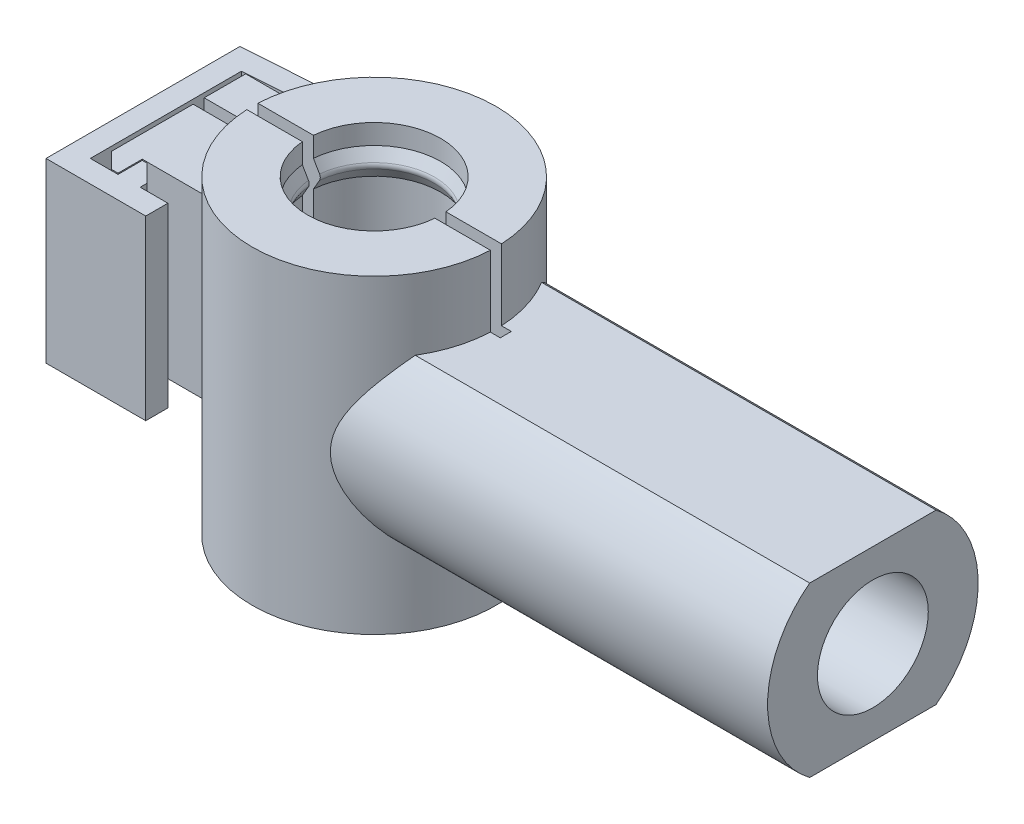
ISO-10303-21;
HEADER;
FILE_DESCRIPTION(('STEP AP214'),'2;1');
FILE_NAME('part.step','',(''),(''),'','','');
FILE_SCHEMA(('AUTOMOTIVE_DESIGN { 1 0 10303 214 1 1 1 1 }'));
ENDSEC;
DATA;
#1=APPLICATION_CONTEXT('core data for automotive mechanical design processes');
#2=APPLICATION_PROTOCOL_DEFINITION('international standard','automotive_design',2000,#1);
#3=PRODUCT_CONTEXT('',#1,'mechanical');
#4=PRODUCT('Part','Part','',(#3));
#5=PRODUCT_RELATED_PRODUCT_CATEGORY('part','',(#4));
#6=PRODUCT_DEFINITION_FORMATION('','',#4);
#7=PRODUCT_DEFINITION_CONTEXT('part definition',#1,'design');
#8=PRODUCT_DEFINITION('design','',#6,#7);
#9=PRODUCT_DEFINITION_SHAPE('','',#8);
#10=(LENGTH_UNIT() NAMED_UNIT(*) SI_UNIT(.MILLI.,.METRE.));
#11=(NAMED_UNIT(*) PLANE_ANGLE_UNIT() SI_UNIT($,.RADIAN.));
#12=(NAMED_UNIT(*) SI_UNIT($,.STERADIAN.) SOLID_ANGLE_UNIT());
#13=UNCERTAINTY_MEASURE_WITH_UNIT(LENGTH_MEASURE(1.E-05),#10,'distance_accuracy_value','');
#14=(GEOMETRIC_REPRESENTATION_CONTEXT(3) GLOBAL_UNCERTAINTY_ASSIGNED_CONTEXT((#13)) GLOBAL_UNIT_ASSIGNED_CONTEXT((#10,
#11,#12)) REPRESENTATION_CONTEXT('',''));
#15=CARTESIAN_POINT('',(0.,0.,0.));
#16=DIRECTION('',(0.,0.,1.));
#17=DIRECTION('',(1.,0.,0.));
#18=AXIS2_PLACEMENT_3D('',#15,#16,#17);
#19=CARTESIAN_POINT('',(-0.7,0.,-0.25));
#20=DIRECTION('',(0.,0.,1.));
#21=DIRECTION('',(1.,0.,0.));
#22=AXIS2_PLACEMENT_3D('',#19,#20,#21);
#23=PLANE('',#22);
#24=DIRECTION('',(0.,-1.,0.));
#25=VECTOR('',#24,1.);
#26=CARTESIAN_POINT('',(-2.98956518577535,-6.79113341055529,-0.25));
#27=LINE('',#26,#25);
#28=CARTESIAN_POINT('',(-2.98956518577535,4.9,-0.25));
#29=VERTEX_POINT('',#28);
#30=CARTESIAN_POINT('',(-2.98956518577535,-6.23182202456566,-0.25));
#31=VERTEX_POINT('',#30);
#32=EDGE_CURVE('E48',#29,#31,#27,.T.);
#33=ORIENTED_EDGE('',*,*,#32,.F.);
#34=CARTESIAN_POINT('',(-0.874816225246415,8.52026845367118,-0.25));
#35=CARTESIAN_POINT('',(-0.926844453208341,8.43358671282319,-0.25));
#36=CARTESIAN_POINT('',(-0.978647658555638,8.34677067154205,-0.25));
#37=CARTESIAN_POINT('',(-1.0819275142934,8.17294515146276,-0.25));
#38=CARTESIAN_POINT('',(-1.13340416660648,8.08593567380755,-0.25));
#39=CARTESIAN_POINT('',(-1.28752943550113,7.82473000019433,-0.25));
#40=CARTESIAN_POINT('',(-1.38987437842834,7.65035486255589,-0.25));
#41=CARTESIAN_POINT('',(-1.69433628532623,7.13027897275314,-0.25));
#42=CARTESIAN_POINT('',(-1.89588152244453,6.78424405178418,-0.25));
#43=CARTESIAN_POINT('',(-2.29843356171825,6.09185705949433,-0.25));
#44=CARTESIAN_POINT('',(-2.49944035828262,5.74550498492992,-0.25));
#45=CARTESIAN_POINT('',(-3.00260127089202,4.87773186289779,-0.25));
#46=CARTESIAN_POINT('',(-3.30458364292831,4.35621120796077,-0.25));
#47=CARTESIAN_POINT('',(-3.75736974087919,3.57382886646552,-0.25));
#48=CARTESIAN_POINT('',(-3.90826568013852,3.31302048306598,-0.25));
#49=CARTESIAN_POINT('',(-4.21000930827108,2.79137584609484,-0.25));
#50=CARTESIAN_POINT('',(-4.36085699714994,2.5305395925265,-0.25));
#51=CARTESIAN_POINT('',(-4.51168718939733,2.26969320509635,-0.25));
#52=B_SPLINE_CURVE_WITH_KNOTS('',3,(#34,#35,#36,#37,#38,#39,#40,#41,#42,#43,#44,#45,#46,#47,#48,
#49,#50,#51),.UNSPECIFIED.,.F.,.F.,(4,2,2,2,2,2,2,2,4),(0.,0.303290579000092,0.606579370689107,
1.21315101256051,2.41450092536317,3.61586326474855,5.42378834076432,6.32773269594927,
7.23167694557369),.UNSPECIFIED.);
#53=CARTESIAN_POINT('',(-2.71426971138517,5.375,-0.25));
#54=VERTEX_POINT('',#53);
#55=EDGE_CURVE('E350',#54,#29,#52,.T.);
#56=ORIENTED_EDGE('',*,*,#55,.F.);
#57=CARTESIAN_POINT('',(-2.68063251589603,5.5,-0.25));
#58=CARTESIAN_POINT('',(-2.68063314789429,5.48600129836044,-0.25));
#59=CARTESIAN_POINT('',(-2.68181745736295,5.4719924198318,-0.25));
#60=CARTESIAN_POINT('',(-2.68652445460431,5.44436134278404,-0.25));
#61=CARTESIAN_POINT('',(-2.6900499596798,5.43073963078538,-0.25));
#62=CARTESIAN_POINT('',(-2.69933578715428,5.40428809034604,-0.25));
#63=CARTESIAN_POINT('',(-2.70509482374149,5.3914578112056,-0.25));
#64=CARTESIAN_POINT('',(-2.71867945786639,5.36694715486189,-0.25));
#65=CARTESIAN_POINT('',(-2.72650456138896,5.35526650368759,-0.25));
#66=CARTESIAN_POINT('',(-2.74401587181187,5.33335453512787,-0.25));
#67=CARTESIAN_POINT('',(-2.75370599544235,5.32312634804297,-0.25));
#68=CARTESIAN_POINT('',(-2.77466014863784,5.3044336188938,-0.25));
#69=CARTESIAN_POINT('',(-2.78592427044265,5.29596918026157,-0.25));
#70=CARTESIAN_POINT('',(-2.80975459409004,5.28100899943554,-0.25));
#71=CARTESIAN_POINT('',(-2.82232581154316,5.27452124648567,-0.25));
#72=CARTESIAN_POINT('',(-2.84837647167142,5.26374038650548,-0.25));
#73=CARTESIAN_POINT('',(-2.86185593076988,5.25944731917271,-0.25));
#74=CARTESIAN_POINT('',(-2.88938806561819,5.25316461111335,-0.25));
#75=CARTESIAN_POINT('',(-2.90344247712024,5.25118257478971,-0.25));
#76=CARTESIAN_POINT('',(-2.93168471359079,5.24960316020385,-0.25));
#77=CARTESIAN_POINT('',(-2.94587253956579,5.25000579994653,-0.25));
#78=CARTESIAN_POINT('',(-2.97399571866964,5.25318717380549,-0.25));
#79=CARTESIAN_POINT('',(-2.98793076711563,5.2559686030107,-0.25));
#80=CARTESIAN_POINT('',(-3.01513514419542,5.26383436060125,-0.25));
#81=CARTESIAN_POINT('',(-3.02840447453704,5.26891868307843,-0.25));
#82=CARTESIAN_POINT('',(-3.05388227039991,5.28124067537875,-0.25));
#83=CARTESIAN_POINT('',(-3.06609203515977,5.28847565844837,-0.25));
#84=CARTESIAN_POINT('',(-3.08911905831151,5.30489828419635,-0.25));
#85=CARTESIAN_POINT('',(-3.09993633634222,5.31408589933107,-0.25));
#86=CARTESIAN_POINT('',(-3.11983820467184,5.33412550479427,-0.25));
#87=CARTESIAN_POINT('',(-3.12892761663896,5.34497270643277,-0.25));
#88=CARTESIAN_POINT('',(-3.1451494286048,5.36804322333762,-0.25));
#89=CARTESIAN_POINT('',(-3.15228186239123,5.38026651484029,-0.25));
#90=CARTESIAN_POINT('',(-3.16436381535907,5.40570064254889,-0.25));
#91=CARTESIAN_POINT('',(-3.16932016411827,5.41890823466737,-0.25));
#92=CARTESIAN_POINT('',(-3.17693937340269,5.44596915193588,-0.25));
#93=CARTESIAN_POINT('',(-3.17960226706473,5.45982246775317,-0.25));
#94=CARTESIAN_POINT('',(-3.18255398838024,5.48774747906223,-0.25));
#95=CARTESIAN_POINT('',(-3.18284825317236,5.5018186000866,-0.25));
#96=CARTESIAN_POINT('',(-3.18106853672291,5.52981019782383,-0.25));
#97=CARTESIAN_POINT('',(-3.17899457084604,5.54373067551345,-0.25));
#98=CARTESIAN_POINT('',(-3.17254046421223,5.57101659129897,-0.25));
#99=CARTESIAN_POINT('',(-3.1681618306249,5.584382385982,-0.25));
#100=CARTESIAN_POINT('',(-3.15722538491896,5.61019040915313,-0.25));
#101=CARTESIAN_POINT('',(-3.15066756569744,5.62263263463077,-0.25));
#102=CARTESIAN_POINT('',(-3.13555176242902,5.64625706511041,-0.25));
#103=CARTESIAN_POINT('',(-3.12699139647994,5.65743774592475,-0.25));
#104=CARTESIAN_POINT('',(-3.10811963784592,5.67820800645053,-0.25));
#105=CARTESIAN_POINT('',(-3.09780822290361,5.68779756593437,-0.25));
#106=CARTESIAN_POINT('',(-3.07569825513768,5.70514107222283,-0.25));
#107=CARTESIAN_POINT('',(-3.06389582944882,5.712890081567,-0.25));
#108=CARTESIAN_POINT('',(-3.0391608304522,5.72630398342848,-0.25));
#109=CARTESIAN_POINT('',(-3.02622823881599,5.73196884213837,-0.25));
#110=CARTESIAN_POINT('',(-2.99955576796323,5.74107248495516,-0.25));
#111=CARTESIAN_POINT('',(-2.98581344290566,5.74450410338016,-0.25));
#112=CARTESIAN_POINT('',(-2.95794816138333,5.74901787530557,-0.25));
#113=CARTESIAN_POINT('',(-2.9438251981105,5.75009998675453,-0.25));
#114=CARTESIAN_POINT('',(-2.91556206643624,5.74988520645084,-0.25));
#115=CARTESIAN_POINT('',(-2.90142194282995,5.74858238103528,-0.25));
#116=CARTESIAN_POINT('',(-2.87356054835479,5.74362292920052,-0.25));
#117=CARTESIAN_POINT('',(-2.85983928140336,5.73996628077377,-0.25));
#118=CARTESIAN_POINT('',(-2.8331968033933,5.73039829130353,-0.25));
#119=CARTESIAN_POINT('',(-2.82027610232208,5.72448552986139,-0.25));
#120=CARTESIAN_POINT('',(-2.79561367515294,5.71057114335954,-0.25));
#121=CARTESIAN_POINT('',(-2.78387189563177,5.70256961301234,-0.25));
#122=CARTESIAN_POINT('',(-2.76192550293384,5.68471989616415,-0.25));
#123=CARTESIAN_POINT('',(-2.75171796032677,5.67487531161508,-0.25));
#124=CARTESIAN_POINT('',(-2.73310537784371,5.65360367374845,-0.25));
#125=CARTESIAN_POINT('',(-2.72470075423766,5.64217625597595,-0.25));
#126=CARTESIAN_POINT('',(-2.70996613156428,5.61810622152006,-0.25));
#127=CARTESIAN_POINT('',(-2.70362955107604,5.60546762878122,-0.25));
#128=CARTESIAN_POINT('',(-2.69318493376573,5.57931311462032,-0.25));
#129=CARTESIAN_POINT('',(-2.6890741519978,5.56579829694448,-0.25));
#130=CARTESIAN_POINT('',(-2.68430578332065,5.54349606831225,-0.25));
#131=CARTESIAN_POINT('',(-2.68293007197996,5.53485565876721,-0.25));
#132=CARTESIAN_POINT('',(-2.68109324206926,5.5174781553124,-0.25));
#133=CARTESIAN_POINT('',(-2.68063212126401,5.50874106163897,-0.25));
#134=CARTESIAN_POINT('',(-2.68063251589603,5.5,-0.25));
#135=B_SPLINE_CURVE_WITH_KNOTS('',3,(#57,#58,#59,#60,#61,#62,#63,#64,#65,#66,#67,#68,#69,#70,
#71,#72,#73,#74,#75,#76,#77,#78,#79,#80,#81,#82,#83,#84,#85,#86,#87,#88,#89,#90,#91,#92,#93,#94,
#95,#96,#97,#98,#99,#100,#101,#102,#103,#104,#105,#106,#107,#108,#109,#110,#111,#112,#113,#114,
#115,#116,#117,#118,#119,#120,#121,#122,#123,#124,#125,#126,#127,#128,#129,#130,#131,#132,#133,
#134),.UNSPECIFIED.,.T.,.F.,(4,2,2,2,2,2,2,2,2,2,2,2,2,2,2,2,2,2,2,2,2,2,2,2,2,2,2,2,2,2,2,2,2,
2,2,2,2,2,4),(0.,0.0419641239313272,0.08397883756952,0.12596939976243,0.167949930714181,
0.210019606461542,0.252091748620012,0.294331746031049,0.336572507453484,0.378951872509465,
0.421331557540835,0.463759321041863,0.506186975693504,0.548561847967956,0.59093612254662,
0.633190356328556,0.675443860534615,0.717563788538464,0.759683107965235,0.801705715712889,
0.843728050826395,0.88572293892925,0.927717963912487,0.969763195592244,1.01180896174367,
1.0539662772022,1.09612427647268,1.13841688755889,1.18071025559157,1.22310899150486,
1.26550812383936,1.30793399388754,1.35035794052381,1.39269982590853,1.43505147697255,
1.47726700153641,1.51943034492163,1.54563362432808,1.57183683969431),.UNSPECIFIED.);
#136=CARTESIAN_POINT('',(-2.71426971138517,5.625,-0.25));
#137=VERTEX_POINT('',#136);
#138=EDGE_CURVE('E358',#137,#54,#135,.T.);
#139=ORIENTED_EDGE('',*,*,#138,.F.);
#140=CARTESIAN_POINT('',(-4.51168718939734,8.73030679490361,-0.25));
#141=CARTESIAN_POINT('',(-4.36085328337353,8.46945792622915,-0.25));
#142=CARTESIAN_POINT('',(-4.21000443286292,8.20861769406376,-0.25));
#143=CARTESIAN_POINT('',(-3.90825867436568,7.6869654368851,-0.25));
#144=CARTESIAN_POINT('',(-3.75736176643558,7.42615341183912,-0.25));
#145=CARTESIAN_POINT('',(-3.4555021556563,6.90456924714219,-0.25));
#146=CARTESIAN_POINT('',(-3.30453945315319,6.64379710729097,-0.25));
#147=CARTESIAN_POINT('',(-3.00251460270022,6.12231000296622,-0.25));
#148=CARTESIAN_POINT('',(-2.85145245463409,5.86159503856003,-0.25));
#149=CARTESIAN_POINT('',(-2.54916884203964,5.34025421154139,-0.25));
#150=CARTESIAN_POINT('',(-2.39794737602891,5.07962834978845,-0.25));
#151=CARTESIAN_POINT('',(-2.09523923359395,4.55853152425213,-0.25));
#152=CARTESIAN_POINT('',(-1.94375255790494,4.29806056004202,-0.25));
#153=CARTESIAN_POINT('',(-1.71612477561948,3.90758398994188,-0.25));
#154=CARTESIAN_POINT('',(-1.64018213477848,3.77746273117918,-0.25));
#155=CARTESIAN_POINT('',(-1.48809423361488,3.51733904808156,-0.25));
#156=CARTESIAN_POINT('',(-1.41194897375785,3.38733662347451,-0.25));
#157=CARTESIAN_POINT('',(-1.25933922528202,3.12751711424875,-0.25));
#158=CARTESIAN_POINT('',(-1.18287473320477,2.99770003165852,-0.25));
#159=CARTESIAN_POINT('',(-1.06775989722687,2.80322100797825,-0.25));
#160=CARTESIAN_POINT('',(-1.02931845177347,2.73843551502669,-0.25));
#161=CARTESIAN_POINT('',(-0.952234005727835,2.60898426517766,-0.25));
#162=CARTESIAN_POINT('',(-0.913591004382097,2.54431850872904,-0.25));
#163=CARTESIAN_POINT('',(-0.874816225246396,2.47973154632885,-0.25));
#164=B_SPLINE_CURVE_WITH_KNOTS('',3,(#140,#141,#142,#143,#144,#145,#146,#147,#148,#149,#150,
#151,#152,#153,#154,#155,#156,#157,#158,#159,#160,#161,#162,#163),.UNSPECIFIED.,.F.,.F.,(4,2,2,
2,2,2,2,2,2,2,2,4),(0.,0.903956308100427,1.80791155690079,2.7118621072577,3.61581371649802,
4.51977381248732,5.42373140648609,5.87571517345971,6.32769790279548,6.77968554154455,
7.00568112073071,7.23167754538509),.UNSPECIFIED.);
#165=CARTESIAN_POINT('',(-2.98956518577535,6.1,-0.25));
#166=VERTEX_POINT('',#165);
#167=EDGE_CURVE('E458',#166,#137,#164,.T.);
#168=ORIENTED_EDGE('',*,*,#167,.F.);
#169=DIRECTION('',(0.,-1.,0.));
#170=VECTOR('',#169,1.);
#171=CARTESIAN_POINT('',(-2.98956518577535,-6.79113341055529,-0.25));
#172=LINE('',#171,#170);
#173=CARTESIAN_POINT('',(-2.98956518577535,7.,-0.25));
#174=VERTEX_POINT('',#173);
#175=EDGE_CURVE('E451',#174,#166,#172,.T.);
#176=ORIENTED_EDGE('',*,*,#175,.F.);
#177=DIRECTION('',(1.,0.,0.));
#178=VECTOR('',#177,1.);
#179=CARTESIAN_POINT('',(5.5,7.,-0.25));
#180=LINE('',#179,#178);
#181=CARTESIAN_POINT('',(-5.49431524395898,7.,-0.25));
#182=VERTEX_POINT('',#181);
#183=EDGE_CURVE('E567',#182,#174,#180,.T.);
#184=ORIENTED_EDGE('',*,*,#183,.F.);
#185=DIRECTION('',(0.,-1.,0.));
#186=VECTOR('',#185,1.);
#187=CARTESIAN_POINT('',(-5.49431524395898,-7.57926066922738,-0.25));
#188=LINE('',#187,#186);
#189=CARTESIAN_POINT('',(-5.49431524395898,6.,-0.25));
#190=VERTEX_POINT('',#189);
#191=EDGE_CURVE('E565',#190,#182,#188,.F.);
#192=ORIENTED_EDGE('',*,*,#191,.F.);
#193=DIRECTION('',(-1.,0.,0.));
#194=VECTOR('',#193,1.);
#195=CARTESIAN_POINT('',(-0.493065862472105,6.,-0.25));
#196=LINE('',#195,#194);
#197=CARTESIAN_POINT('',(-7.91817565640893,6.,-0.25));
#198=VERTEX_POINT('',#197);
#199=EDGE_CURVE('E564',#190,#198,#196,.T.);
#200=ORIENTED_EDGE('',*,*,#199,.T.);
#201=DIRECTION('',(0.,-1.,0.));
#202=VECTOR('',#201,1.);
#203=CARTESIAN_POINT('',(-7.91817565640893,6.,-0.25));
#204=LINE('',#203,#202);
#205=CARTESIAN_POINT('',(-7.91817565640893,-2.,-0.25));
#206=VERTEX_POINT('',#205);
#207=EDGE_CURVE('E559',#198,#206,#204,.T.);
#208=ORIENTED_EDGE('',*,*,#207,.T.);
#209=DIRECTION('',(-1.,0.,0.));
#210=VECTOR('',#209,1.);
#211=CARTESIAN_POINT('',(-0.493065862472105,-2.,-0.25));
#212=LINE('',#211,#210);
#213=CARTESIAN_POINT('',(-5.49431524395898,-2.,-0.25));
#214=VERTEX_POINT('',#213);
#215=EDGE_CURVE('E802',#214,#206,#212,.T.);
#216=ORIENTED_EDGE('',*,*,#215,.F.);
#217=CARTESIAN_POINT('',(-5.49431524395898,-4.59263059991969,-0.25));
#218=VERTEX_POINT('',#217);
#219=EDGE_CURVE('E561',#218,#214,#188,.F.);
#220=ORIENTED_EDGE('',*,*,#219,.F.);
#221=CARTESIAN_POINT('',(-0.7,0.,-0.25));
#222=DIRECTION('',(0.,0.,1.));
#223=DIRECTION('',(1.,0.,0.));
#224=AXIS2_PLACEMENT_3D('',#221,#222,#223);
#225=CIRCLE('',#224,6.63910494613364);
#226=EDGE_CURVE('E537',#218,#31,#225,.T.);
#227=ORIENTED_EDGE('',*,*,#226,.T.);
#228=EDGE_LOOP('',(#33,#56,#139,#168,#176,#184,#192,#200,#208,#216,#220,#227));
#229=FACE_BOUND('',#228,.T.);
#230=ADVANCED_FACE('F28',(#229),#23,.T.);
#231=CARTESIAN_POINT('',(-0.7,0.,0.25));
#232=DIRECTION('',(0.,0.,1.));
#233=DIRECTION('',(1.,0.,0.));
#234=AXIS2_PLACEMENT_3D('',#231,#232,#233);
#235=PLANE('',#234);
#236=CARTESIAN_POINT('',(-0.874816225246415,8.52026845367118,0.25));
#237=CARTESIAN_POINT('',(-0.926844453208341,8.43358671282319,0.25));
#238=CARTESIAN_POINT('',(-0.978647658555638,8.34677067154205,0.25));
#239=CARTESIAN_POINT('',(-1.0819275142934,8.17294515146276,0.25));
#240=CARTESIAN_POINT('',(-1.13340416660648,8.08593567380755,0.25));
#241=CARTESIAN_POINT('',(-1.28752943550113,7.82473000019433,0.25));
#242=CARTESIAN_POINT('',(-1.38987437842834,7.65035486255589,0.25));
#243=CARTESIAN_POINT('',(-1.69433628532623,7.13027897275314,0.25));
#244=CARTESIAN_POINT('',(-1.89588152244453,6.78424405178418,0.25));
#245=CARTESIAN_POINT('',(-2.29843356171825,6.09185705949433,0.25));
#246=CARTESIAN_POINT('',(-2.49944035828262,5.74550498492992,0.25));
#247=CARTESIAN_POINT('',(-3.00260127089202,4.87773186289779,0.25));
#248=CARTESIAN_POINT('',(-3.30458364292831,4.35621120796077,0.25));
#249=CARTESIAN_POINT('',(-3.75736974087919,3.57382886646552,0.25));
#250=CARTESIAN_POINT('',(-3.90826568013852,3.31302048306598,0.25));
#251=CARTESIAN_POINT('',(-4.21000930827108,2.79137584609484,0.25));
#252=CARTESIAN_POINT('',(-4.36085699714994,2.5305395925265,0.25));
#253=CARTESIAN_POINT('',(-4.51168718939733,2.26969320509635,0.25));
#254=B_SPLINE_CURVE_WITH_KNOTS('',3,(#236,#237,#238,#239,#240,#241,#242,#243,#244,#245,#246,
#247,#248,#249,#250,#251,#252,#253),.UNSPECIFIED.,.F.,.F.,(4,2,2,2,2,2,2,2,4),(0.,
0.303290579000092,0.606579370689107,1.21315101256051,2.41450092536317,3.61586326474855,
5.42378834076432,6.32773269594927,7.23167694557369),.UNSPECIFIED.);
#255=CARTESIAN_POINT('',(-2.71426971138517,5.375,0.25));
#256=VERTEX_POINT('',#255);
#257=CARTESIAN_POINT('',(-2.98956518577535,4.9,0.25));
#258=VERTEX_POINT('',#257);
#259=EDGE_CURVE('E11',#256,#258,#254,.T.);
#260=ORIENTED_EDGE('',*,*,#259,.T.);
#261=DIRECTION('',(0.,-1.,0.));
#262=VECTOR('',#261,1.);
#263=CARTESIAN_POINT('',(-2.98956518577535,-6.79113341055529,0.25));
#264=LINE('',#263,#262);
#265=CARTESIAN_POINT('',(-2.98956518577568,-6.23182202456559,0.249999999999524));
#266=VERTEX_POINT('',#265);
#267=EDGE_CURVE('E812',#258,#266,#264,.T.);
#268=ORIENTED_EDGE('',*,*,#267,.T.);
#269=CARTESIAN_POINT('',(-0.7,0.,0.25));
#270=DIRECTION('',(0.,0.,1.));
#271=DIRECTION('',(1.,0.,0.));
#272=AXIS2_PLACEMENT_3D('',#269,#270,#271);
#273=CIRCLE('',#272,6.63910494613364);
#274=CARTESIAN_POINT('',(-5.49431524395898,-4.59263059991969,0.25));
#275=VERTEX_POINT('',#274);
#276=EDGE_CURVE('E533',#275,#266,#273,.T.);
#277=ORIENTED_EDGE('',*,*,#276,.F.);
#278=DIRECTION('',(0.,-1.,0.));
#279=VECTOR('',#278,1.);
#280=CARTESIAN_POINT('',(-5.49431524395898,-7.57926066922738,0.25));
#281=LINE('',#280,#279);
#282=CARTESIAN_POINT('',(-5.49431524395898,-2.,0.25));
#283=VERTEX_POINT('',#282);
#284=EDGE_CURVE('E56',#275,#283,#281,.F.);
#285=ORIENTED_EDGE('',*,*,#284,.T.);
#286=DIRECTION('',(-1.,0.,0.));
#287=VECTOR('',#286,1.);
#288=CARTESIAN_POINT('',(-0.493065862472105,-2.,0.25));
#289=LINE('',#288,#287);
#290=CARTESIAN_POINT('',(-7.91817565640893,-2.,0.25));
#291=VERTEX_POINT('',#290);
#292=EDGE_CURVE('E800',#283,#291,#289,.T.);
#293=ORIENTED_EDGE('',*,*,#292,.T.);
#294=DIRECTION('',(0.,-1.,0.));
#295=VECTOR('',#294,1.);
#296=CARTESIAN_POINT('',(-7.91817565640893,6.,0.25));
#297=LINE('',#296,#295);
#298=CARTESIAN_POINT('',(-7.91817565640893,6.,0.25));
#299=VERTEX_POINT('',#298);
#300=EDGE_CURVE('E545',#299,#291,#297,.T.);
#301=ORIENTED_EDGE('',*,*,#300,.F.);
#302=DIRECTION('',(-1.,0.,0.));
#303=VECTOR('',#302,1.);
#304=CARTESIAN_POINT('',(-0.493065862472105,6.,0.25));
#305=LINE('',#304,#303);
#306=CARTESIAN_POINT('',(-5.49431524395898,6.,0.25));
#307=VERTEX_POINT('',#306);
#308=EDGE_CURVE('E549',#307,#299,#305,.T.);
#309=ORIENTED_EDGE('',*,*,#308,.F.);
#310=CARTESIAN_POINT('',(-5.49431524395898,7.,0.25));
#311=VERTEX_POINT('',#310);
#312=EDGE_CURVE('E550',#307,#311,#281,.F.);
#313=ORIENTED_EDGE('',*,*,#312,.T.);
#314=DIRECTION('',(1.,0.,0.));
#315=VECTOR('',#314,1.);
#316=CARTESIAN_POINT('',(5.5,7.,0.25));
#317=LINE('',#316,#315);
#318=CARTESIAN_POINT('',(-2.98956518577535,7.,0.25));
#319=VERTEX_POINT('',#318);
#320=EDGE_CURVE('E429',#311,#319,#317,.T.);
#321=ORIENTED_EDGE('',*,*,#320,.T.);
#322=DIRECTION('',(0.,-1.,0.));
#323=VECTOR('',#322,1.);
#324=CARTESIAN_POINT('',(-2.98956518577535,-6.79113341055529,0.25));
#325=LINE('',#324,#323);
#326=CARTESIAN_POINT('',(-2.98956518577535,6.1,0.25));
#327=VERTEX_POINT('',#326);
#328=EDGE_CURVE('E396',#319,#327,#325,.T.);
#329=ORIENTED_EDGE('',*,*,#328,.T.);
#330=CARTESIAN_POINT('',(-4.51168718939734,8.73030679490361,0.25));
#331=CARTESIAN_POINT('',(-4.36085328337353,8.46945792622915,0.25));
#332=CARTESIAN_POINT('',(-4.21000443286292,8.20861769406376,0.25));
#333=CARTESIAN_POINT('',(-3.90825867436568,7.6869654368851,0.25));
#334=CARTESIAN_POINT('',(-3.75736176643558,7.42615341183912,0.25));
#335=CARTESIAN_POINT('',(-3.4555021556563,6.90456924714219,0.25));
#336=CARTESIAN_POINT('',(-3.30453945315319,6.64379710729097,0.25));
#337=CARTESIAN_POINT('',(-3.00251460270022,6.12231000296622,0.25));
#338=CARTESIAN_POINT('',(-2.85145245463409,5.86159503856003,0.25));
#339=CARTESIAN_POINT('',(-2.54916884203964,5.34025421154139,0.25));
#340=CARTESIAN_POINT('',(-2.39794737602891,5.07962834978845,0.25));
#341=CARTESIAN_POINT('',(-2.09523923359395,4.55853152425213,0.25));
#342=CARTESIAN_POINT('',(-1.94375255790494,4.29806056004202,0.25));
#343=CARTESIAN_POINT('',(-1.71612477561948,3.90758398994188,0.25));
#344=CARTESIAN_POINT('',(-1.64018213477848,3.77746273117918,0.25));
#345=CARTESIAN_POINT('',(-1.48809423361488,3.51733904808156,0.25));
#346=CARTESIAN_POINT('',(-1.41194897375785,3.38733662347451,0.25));
#347=CARTESIAN_POINT('',(-1.25933922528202,3.12751711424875,0.25));
#348=CARTESIAN_POINT('',(-1.18287473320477,2.99770003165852,0.25));
#349=CARTESIAN_POINT('',(-1.06775989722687,2.80322100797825,0.25));
#350=CARTESIAN_POINT('',(-1.02931845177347,2.73843551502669,0.25));
#351=CARTESIAN_POINT('',(-0.952234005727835,2.60898426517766,0.25));
#352=CARTESIAN_POINT('',(-0.913591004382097,2.54431850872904,0.25));
#353=CARTESIAN_POINT('',(-0.874816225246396,2.47973154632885,0.25));
#354=B_SPLINE_CURVE_WITH_KNOTS('',3,(#330,#331,#332,#333,#334,#335,#336,#337,#338,#339,#340,
#341,#342,#343,#344,#345,#346,#347,#348,#349,#350,#351,#352,#353),.UNSPECIFIED.,.F.,.F.,(4,2,2,
2,2,2,2,2,2,2,2,4),(0.,0.903956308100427,1.80791155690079,2.7118621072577,3.61581371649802,
4.51977381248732,5.42373140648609,5.87571517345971,6.32769790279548,6.77968554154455,
7.00568112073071,7.23167754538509),.UNSPECIFIED.);
#355=CARTESIAN_POINT('',(-2.71426971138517,5.625,0.25));
#356=VERTEX_POINT('',#355);
#357=EDGE_CURVE('E418',#327,#356,#354,.T.);
#358=ORIENTED_EDGE('',*,*,#357,.T.);
#359=CARTESIAN_POINT('',(-2.68063251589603,5.5,0.25));
#360=CARTESIAN_POINT('',(-2.68063314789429,5.48600129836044,0.25));
#361=CARTESIAN_POINT('',(-2.68181745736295,5.4719924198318,0.25));
#362=CARTESIAN_POINT('',(-2.68652445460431,5.44436134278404,0.25));
#363=CARTESIAN_POINT('',(-2.6900499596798,5.43073963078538,0.25));
#364=CARTESIAN_POINT('',(-2.69933578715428,5.40428809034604,0.25));
#365=CARTESIAN_POINT('',(-2.70509482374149,5.3914578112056,0.25));
#366=CARTESIAN_POINT('',(-2.71867945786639,5.36694715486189,0.25));
#367=CARTESIAN_POINT('',(-2.72650456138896,5.35526650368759,0.25));
#368=CARTESIAN_POINT('',(-2.74401587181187,5.33335453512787,0.25));
#369=CARTESIAN_POINT('',(-2.75370599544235,5.32312634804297,0.25));
#370=CARTESIAN_POINT('',(-2.77466014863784,5.3044336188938,0.25));
#371=CARTESIAN_POINT('',(-2.78592427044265,5.29596918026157,0.25));
#372=CARTESIAN_POINT('',(-2.80975459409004,5.28100899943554,0.25));
#373=CARTESIAN_POINT('',(-2.82232581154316,5.27452124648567,0.25));
#374=CARTESIAN_POINT('',(-2.84837647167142,5.26374038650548,0.25));
#375=CARTESIAN_POINT('',(-2.86185593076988,5.25944731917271,0.25));
#376=CARTESIAN_POINT('',(-2.88938806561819,5.25316461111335,0.25));
#377=CARTESIAN_POINT('',(-2.90344247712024,5.25118257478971,0.25));
#378=CARTESIAN_POINT('',(-2.93168471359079,5.24960316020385,0.25));
#379=CARTESIAN_POINT('',(-2.94587253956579,5.25000579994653,0.25));
#380=CARTESIAN_POINT('',(-2.97399571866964,5.25318717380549,0.25));
#381=CARTESIAN_POINT('',(-2.98793076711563,5.2559686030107,0.25));
#382=CARTESIAN_POINT('',(-3.01513514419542,5.26383436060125,0.25));
#383=CARTESIAN_POINT('',(-3.02840447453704,5.26891868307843,0.25));
#384=CARTESIAN_POINT('',(-3.05388227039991,5.28124067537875,0.25));
#385=CARTESIAN_POINT('',(-3.06609203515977,5.28847565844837,0.25));
#386=CARTESIAN_POINT('',(-3.08911905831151,5.30489828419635,0.25));
#387=CARTESIAN_POINT('',(-3.09993633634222,5.31408589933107,0.25));
#388=CARTESIAN_POINT('',(-3.11983820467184,5.33412550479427,0.25));
#389=CARTESIAN_POINT('',(-3.12892761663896,5.34497270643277,0.25));
#390=CARTESIAN_POINT('',(-3.1451494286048,5.36804322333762,0.25));
#391=CARTESIAN_POINT('',(-3.15228186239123,5.38026651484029,0.25));
#392=CARTESIAN_POINT('',(-3.16436381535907,5.40570064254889,0.25));
#393=CARTESIAN_POINT('',(-3.16932016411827,5.41890823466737,0.25));
#394=CARTESIAN_POINT('',(-3.17693937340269,5.44596915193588,0.25));
#395=CARTESIAN_POINT('',(-3.17960226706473,5.45982246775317,0.25));
#396=CARTESIAN_POINT('',(-3.18255398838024,5.48774747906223,0.25));
#397=CARTESIAN_POINT('',(-3.18284825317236,5.5018186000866,0.25));
#398=CARTESIAN_POINT('',(-3.18106853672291,5.52981019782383,0.25));
#399=CARTESIAN_POINT('',(-3.17899457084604,5.54373067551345,0.25));
#400=CARTESIAN_POINT('',(-3.17254046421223,5.57101659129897,0.25));
#401=CARTESIAN_POINT('',(-3.1681618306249,5.584382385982,0.25));
#402=CARTESIAN_POINT('',(-3.15722538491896,5.61019040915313,0.25));
#403=CARTESIAN_POINT('',(-3.15066756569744,5.62263263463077,0.25));
#404=CARTESIAN_POINT('',(-3.13555176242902,5.64625706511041,0.25));
#405=CARTESIAN_POINT('',(-3.12699139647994,5.65743774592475,0.25));
#406=CARTESIAN_POINT('',(-3.10811963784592,5.67820800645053,0.25));
#407=CARTESIAN_POINT('',(-3.09780822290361,5.68779756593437,0.25));
#408=CARTESIAN_POINT('',(-3.07569825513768,5.70514107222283,0.25));
#409=CARTESIAN_POINT('',(-3.06389582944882,5.712890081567,0.25));
#410=CARTESIAN_POINT('',(-3.0391608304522,5.72630398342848,0.25));
#411=CARTESIAN_POINT('',(-3.02622823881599,5.73196884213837,0.25));
#412=CARTESIAN_POINT('',(-2.99955576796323,5.74107248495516,0.25));
#413=CARTESIAN_POINT('',(-2.98581344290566,5.74450410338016,0.25));
#414=CARTESIAN_POINT('',(-2.95794816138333,5.74901787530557,0.25));
#415=CARTESIAN_POINT('',(-2.9438251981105,5.75009998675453,0.25));
#416=CARTESIAN_POINT('',(-2.91556206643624,5.74988520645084,0.25));
#417=CARTESIAN_POINT('',(-2.90142194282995,5.74858238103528,0.25));
#418=CARTESIAN_POINT('',(-2.87356054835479,5.74362292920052,0.25));
#419=CARTESIAN_POINT('',(-2.85983928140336,5.73996628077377,0.25));
#420=CARTESIAN_POINT('',(-2.8331968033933,5.73039829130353,0.25));
#421=CARTESIAN_POINT('',(-2.82027610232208,5.72448552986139,0.25));
#422=CARTESIAN_POINT('',(-2.79561367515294,5.71057114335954,0.25));
#423=CARTESIAN_POINT('',(-2.78387189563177,5.70256961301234,0.25));
#424=CARTESIAN_POINT('',(-2.76192550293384,5.68471989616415,0.25));
#425=CARTESIAN_POINT('',(-2.75171796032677,5.67487531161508,0.25));
#426=CARTESIAN_POINT('',(-2.73310537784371,5.65360367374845,0.25));
#427=CARTESIAN_POINT('',(-2.72470075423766,5.64217625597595,0.25));
#428=CARTESIAN_POINT('',(-2.70996613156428,5.61810622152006,0.25));
#429=CARTESIAN_POINT('',(-2.70362955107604,5.60546762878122,0.25));
#430=CARTESIAN_POINT('',(-2.69318493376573,5.57931311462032,0.25));
#431=CARTESIAN_POINT('',(-2.6890741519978,5.56579829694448,0.25));
#432=CARTESIAN_POINT('',(-2.68430578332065,5.54349606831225,0.25));
#433=CARTESIAN_POINT('',(-2.68293007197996,5.53485565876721,0.25));
#434=CARTESIAN_POINT('',(-2.68109324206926,5.5174781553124,0.25));
#435=CARTESIAN_POINT('',(-2.68063212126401,5.50874106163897,0.25));
#436=CARTESIAN_POINT('',(-2.68063251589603,5.5,0.25));
#437=B_SPLINE_CURVE_WITH_KNOTS('',3,(#359,#360,#361,#362,#363,#364,#365,#366,#367,#368,#369,
#370,#371,#372,#373,#374,#375,#376,#377,#378,#379,#380,#381,#382,#383,#384,#385,#386,#387,#388,
#389,#390,#391,#392,#393,#394,#395,#396,#397,#398,#399,#400,#401,#402,#403,#404,#405,#406,#407,
#408,#409,#410,#411,#412,#413,#414,#415,#416,#417,#418,#419,#420,#421,#422,#423,#424,#425,#426,
#427,#428,#429,#430,#431,#432,#433,#434,#435,#436),.UNSPECIFIED.,.T.,.F.,(4,2,2,2,2,2,2,2,2,2,2,
2,2,2,2,2,2,2,2,2,2,2,2,2,2,2,2,2,2,2,2,2,2,2,2,2,2,2,4),(0.,0.0419641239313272,
0.08397883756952,0.12596939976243,0.167949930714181,0.210019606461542,0.252091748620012,
0.294331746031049,0.336572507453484,0.378951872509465,0.421331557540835,0.463759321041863,
0.506186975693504,0.548561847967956,0.59093612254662,0.633190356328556,0.675443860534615,
0.717563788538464,0.759683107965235,0.801705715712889,0.843728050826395,0.88572293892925,
0.927717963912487,0.969763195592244,1.01180896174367,1.0539662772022,1.09612427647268,
1.13841688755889,1.18071025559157,1.22310899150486,1.26550812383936,1.30793399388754,
1.35035794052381,1.39269982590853,1.43505147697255,1.47726700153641,1.51943034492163,
1.54563362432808,1.57183683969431),.UNSPECIFIED.);
#438=EDGE_CURVE('E41',#356,#256,#437,.T.);
#439=ORIENTED_EDGE('',*,*,#438,.T.);
#440=EDGE_LOOP('',(#260,#268,#277,#285,#293,#301,#309,#313,#321,#329,#358,#439));
#441=FACE_BOUND('',#440,.T.);
#442=ADVANCED_FACE('F407',(#441),#235,.F.);
#443=CARTESIAN_POINT('',(-0.7,0.,-0.25));
#444=DIRECTION('',(0.,0.,1.));
#445=DIRECTION('',(1.,0.,0.));
#446=AXIS2_PLACEMENT_3D('',#443,#444,#445);
#447=CYLINDRICAL_SURFACE('',#446,6.63910494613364);
#448=CARTESIAN_POINT('',(2.98956518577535,-5.51949483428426,-0.25));
#449=VERTEX_POINT('',#448);
#450=CARTESIAN_POINT('',(5.93910494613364,0.,-0.25));
#451=VERTEX_POINT('',#450);
#452=EDGE_CURVE('E528',#449,#451,#225,.T.);
#453=ORIENTED_EDGE('',*,*,#452,.F.);
#454=CARTESIAN_POINT('',(0.,-6.60209924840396,-3.));
#455=CARTESIAN_POINT('',(0.0820722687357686,-6.59339656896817,-2.99999900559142));
#456=CARTESIAN_POINT('',(0.164011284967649,-6.58315617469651,-2.996625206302));
#457=CARTESIAN_POINT('',(0.326935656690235,-6.55971937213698,-2.98325532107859));
#458=CARTESIAN_POINT('',(0.407920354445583,-6.54652103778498,-2.97325491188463));
#459=CARTESIAN_POINT('',(0.648869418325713,-6.50267867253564,-2.93350279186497));
#460=CARTESIAN_POINT('',(0.806579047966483,-6.46781425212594,-2.89400102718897));
#461=CARTESIAN_POINT('',(1.11071614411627,-6.38933979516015,-2.79141708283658));
#462=CARTESIAN_POINT('',(1.25719436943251,-6.34577276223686,-2.72844958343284));
#463=CARTESIAN_POINT('',(1.53686256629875,-6.25266937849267,-2.58128165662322));
#464=CARTESIAN_POINT('',(1.67005675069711,-6.20313493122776,-2.49708799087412));
#465=CARTESIAN_POINT('',(1.93042887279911,-6.09751970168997,-2.30256206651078));
#466=CARTESIAN_POINT('',(2.05641310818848,-6.04122634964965,-2.19074651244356));
#467=CARTESIAN_POINT('',(2.28835203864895,-5.92992779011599,-1.9472500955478));
#468=CARTESIAN_POINT('',(2.39428702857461,-5.87492389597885,-1.81554991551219));
#469=CARTESIAN_POINT('',(2.58856881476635,-5.76853105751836,-1.52678737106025));
#470=CARTESIAN_POINT('',(2.67568802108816,-5.71748750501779,-1.36875161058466));
#471=CARTESIAN_POINT('',(2.78467484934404,-5.65124486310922,-1.11974122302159));
#472=CARTESIAN_POINT('',(2.81738901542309,-5.63088404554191,-1.034742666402));
#473=CARTESIAN_POINT('',(2.87514429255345,-5.59439230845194,-0.861322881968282));
#474=CARTESIAN_POINT('',(2.90019103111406,-5.57825828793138,-0.772904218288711));
#475=CARTESIAN_POINT('',(2.93979888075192,-5.55248346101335,-0.603549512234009));
#476=CARTESIAN_POINT('',(2.95522419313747,-5.5423154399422,-0.522894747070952));
#477=CARTESIAN_POINT('',(2.97943023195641,-5.5262753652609,-0.360211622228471));
#478=CARTESIAN_POINT('',(2.98821486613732,-5.52040078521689,-0.278184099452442));
#479=CARTESIAN_POINT('',(2.99898523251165,-5.51319031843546,-0.113523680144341));
#480=CARTESIAN_POINT('',(3.00097468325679,-5.5118519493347,-0.0308911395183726));
#481=CARTESIAN_POINT('',(2.99813626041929,-5.51375529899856,0.134176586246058));
#482=CARTESIAN_POINT('',(2.99330900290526,-5.51699660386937,0.216611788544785));
#483=CARTESIAN_POINT('',(2.97099175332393,-5.53189584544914,0.439580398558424));
#484=CARTESIAN_POINT('',(2.94688867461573,-5.54793239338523,0.579227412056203));
#485=CARTESIAN_POINT('',(2.87991291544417,-5.59137623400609,0.851989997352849));
#486=CARTESIAN_POINT('',(2.83703360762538,-5.61878754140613,0.985103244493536));
#487=CARTESIAN_POINT('',(2.73163116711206,-5.68380405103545,1.24873200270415));
#488=CARTESIAN_POINT('',(2.66823564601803,-5.72184915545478,1.37878753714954));
#489=CARTESIAN_POINT('',(2.52453777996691,-5.80404328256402,1.62705746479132));
#490=CARTESIAN_POINT('',(2.44422729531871,-5.84819524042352,1.74526611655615));
#491=CARTESIAN_POINT('',(2.25424465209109,-5.94670798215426,1.98633884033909));
#492=CARTESIAN_POINT('',(2.14193070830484,-6.00157203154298,2.10692285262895));
#493=CARTESIAN_POINT('',(1.89892475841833,-6.11073368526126,2.32833217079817));
#494=CARTESIAN_POINT('',(1.76822053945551,-6.16503088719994,2.42914423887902));
#495=CARTESIAN_POINT('',(1.47993114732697,-6.27304247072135,2.61562232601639));
#496=CARTESIAN_POINT('',(1.32104938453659,-6.3263877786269,2.69951661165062));
#497=CARTESIAN_POINT('',(0.988277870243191,-6.42319062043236,2.83826342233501));
#498=CARTESIAN_POINT('',(0.814397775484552,-6.46665445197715,2.89313447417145));
#499=CARTESIAN_POINT('',(0.469523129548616,-6.5374831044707,2.96789926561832));
#500=CARTESIAN_POINT('',(0.299200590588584,-6.56577201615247,2.99000023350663));
#501=CARTESIAN_POINT('',(-0.0443648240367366,-6.60891494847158,3.00458555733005));
#502=CARTESIAN_POINT('',(-0.217605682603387,-6.62377788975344,2.99708959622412));
#503=CARTESIAN_POINT('',(-0.544574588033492,-6.63911362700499,2.95432531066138));
#504=CARTESIAN_POINT('',(-0.698604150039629,-6.64080948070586,2.92173813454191));
#505=CARTESIAN_POINT('',(-0.999450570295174,-6.63405478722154,2.83296517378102));
#506=CARTESIAN_POINT('',(-1.14626747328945,-6.62560430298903,2.77677953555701));
#507=CARTESIAN_POINT('',(-1.42821104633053,-6.60056136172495,2.6428201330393));
#508=CARTESIAN_POINT('',(-1.56337912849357,-6.58399927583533,2.56512736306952));
#509=CARTESIAN_POINT('',(-1.8195603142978,-6.54531179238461,2.39024555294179));
#510=CARTESIAN_POINT('',(-1.9405690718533,-6.52318469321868,2.29305055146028));
#511=CARTESIAN_POINT('',(-2.17323573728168,-6.47474508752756,2.07463876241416));
#512=CARTESIAN_POINT('',(-2.28377919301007,-6.44825425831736,1.95227330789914));
#513=CARTESIAN_POINT('',(-2.48345893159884,-6.39591038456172,1.69100003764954));
#514=CARTESIAN_POINT('',(-2.57258845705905,-6.37005754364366,1.55208702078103));
#515=CARTESIAN_POINT('',(-2.73000619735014,-6.32169663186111,1.25549665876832));
#516=CARTESIAN_POINT('',(-2.79739680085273,-6.29934856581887,1.09731382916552));
#517=CARTESIAN_POINT('',(-2.90432768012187,-6.26273821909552,0.770930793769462));
#518=CARTESIAN_POINT('',(-2.94388121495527,-6.2484720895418,0.602735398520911));
#519=CARTESIAN_POINT('',(-2.99246401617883,-6.23080796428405,0.268965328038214));
#520=CARTESIAN_POINT('',(-3.0027534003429,-6.22696165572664,0.103598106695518));
#521=CARTESIAN_POINT('',(-2.99598814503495,-6.22945974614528,-0.226479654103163));
#522=CARTESIAN_POINT('',(-2.97893792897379,-6.23580249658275,-0.391190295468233));
#523=CARTESIAN_POINT('',(-2.91938827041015,-6.25723250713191,-0.70871258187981));
#524=CARTESIAN_POINT('',(-2.87789148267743,-6.2719745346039,-0.861738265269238));
#525=CARTESIAN_POINT('',(-2.77169016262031,-6.30784715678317,-1.15871397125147));
#526=CARTESIAN_POINT('',(-2.70697962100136,-6.3289794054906,-1.30266163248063));
#527=CARTESIAN_POINT('',(-2.55304643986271,-6.37578606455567,-1.58388785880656));
#528=CARTESIAN_POINT('',(-2.4629255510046,-6.40161147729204,-1.72064905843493));
#529=CARTESIAN_POINT('',(-2.26170680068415,-6.45364727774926,-1.97770856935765));
#530=CARTESIAN_POINT('',(-2.1506039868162,-6.47985775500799,-2.09800298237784));
#531=CARTESIAN_POINT('',(-1.90458390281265,-6.53017162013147,-2.32415760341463));
#532=CARTESIAN_POINT('',(-1.76882941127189,-6.55413013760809,-2.42914179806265));
#533=CARTESIAN_POINT('',(-1.4804330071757,-6.59467537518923,-2.61489366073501));
#534=CARTESIAN_POINT('',(-1.32778795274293,-6.6112607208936,-2.69565681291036));
#535=CARTESIAN_POINT('',(-1.09264273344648,-6.62793235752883,-2.79518810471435));
#536=CARTESIAN_POINT('',(-1.01470476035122,-6.63211537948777,-2.82441399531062));
#537=CARTESIAN_POINT('',(-0.856591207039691,-6.63772780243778,-2.87630976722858));
#538=CARTESIAN_POINT('',(-0.776416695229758,-6.63915849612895,-2.89898272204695));
#539=CARTESIAN_POINT('',(-0.614646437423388,-6.63904839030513,-2.93753536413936));
#540=CARTESIAN_POINT('',(-0.533054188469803,-6.63751409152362,-2.95342981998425));
#541=CARTESIAN_POINT('',(-0.368983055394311,-6.63135515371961,-2.97837671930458));
#542=CARTESIAN_POINT('',(-0.286504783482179,-6.62673252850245,-2.98743361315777));
#543=CARTESIAN_POINT('',(-0.169951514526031,-6.61800028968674,-2.99537622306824));
#544=CARTESIAN_POINT('',(-0.135949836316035,-6.61518910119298,-2.99711104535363));
#545=CARTESIAN_POINT('',(-0.0679578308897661,-6.60903946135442,-2.9994230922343));
#546=CARTESIAN_POINT('',(-0.033967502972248,-6.60570105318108,-3.00000041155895));
#547=CARTESIAN_POINT('',(0.,-6.60209924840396,-3.));
#548=B_SPLINE_CURVE_WITH_KNOTS('',3,(#454,#455,#456,#457,#458,#459,#460,#461,#462,#463,#464,
#465,#466,#467,#468,#469,#470,#471,#472,#473,#474,#475,#476,#477,#478,#479,#480,#481,#482,#483,
#484,#485,#486,#487,#488,#489,#490,#491,#492,#493,#494,#495,#496,#497,#498,#499,#500,#501,#502,
#503,#504,#505,#506,#507,#508,#509,#510,#511,#512,#513,#514,#515,#516,#517,#518,#519,#520,#521,
#522,#523,#524,#525,#526,#527,#528,#529,#530,#531,#532,#533,#534,#535,#536,#537,#538,#539,#540,
#541,#542,#543,#544,#545,#546,#547),.UNSPECIFIED.,.T.,.F.,(4,2,2,2,2,2,2,2,2,2,2,2,2,2,2,2,2,2,
2,2,2,2,2,2,2,2,2,2,2,2,2,2,2,2,2,2,2,2,2,2,2,2,2,2,2,2,4),(0.,0.24755851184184,
0.49527869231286,0.991462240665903,1.48525201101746,1.97888468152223,2.50941176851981,
3.04045759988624,3.59960912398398,3.87919904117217,4.15858325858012,4.40644639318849,
4.65416355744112,4.90174514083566,5.14930435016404,5.57503547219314,6.00091698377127,
6.44802036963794,6.8953394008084,7.41421309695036,7.93343301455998,8.49276434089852,
9.05173818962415,9.57101576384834,10.0899480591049,10.560024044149,11.0300971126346,
11.4984234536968,11.9668931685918,12.4657271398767,12.9647183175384,13.4822533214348,
13.9995416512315,14.494191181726,14.9887606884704,15.4643338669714,15.9400302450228,
16.4352805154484,16.9306478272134,17.4479698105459,17.9653881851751,18.2151434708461,
18.4647814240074,18.7138726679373,18.9628016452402,19.0652678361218,19.1677256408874),.UNSPECIFIED.);
#549=CARTESIAN_POINT('',(2.98956518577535,-5.51949483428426,0.25));
#550=VERTEX_POINT('',#549);
#551=EDGE_CURVE('E337',#449,#550,#548,.T.);
#552=ORIENTED_EDGE('',*,*,#551,.T.);
#553=CARTESIAN_POINT('',(5.93910494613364,0.,0.25));
#554=VERTEX_POINT('',#553);
#555=EDGE_CURVE('E360',#550,#554,#273,.T.);
#556=ORIENTED_EDGE('',*,*,#555,.T.);
#557=DIRECTION('',(0.,0.,1.));
#558=VECTOR('',#557,1.);
#559=CARTESIAN_POINT('',(5.93910494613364,0.,-0.25));
#560=LINE('',#559,#558);
#561=EDGE_CURVE('E543',#451,#554,#560,.T.);
#562=ORIENTED_EDGE('',*,*,#561,.F.);
#563=EDGE_LOOP('',(#453,#552,#556,#562));
#564=FACE_BOUND('',#563,.T.);
#565=ADVANCED_FACE('F491',(#564),#447,.F.);
#566=CARTESIAN_POINT('',(0.,-7.57926066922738,0.));
#567=DIRECTION('',(0.,-1.,0.));
#568=DIRECTION('',(0.,0.,-1.));
#569=AXIS2_PLACEMENT_3D('',#566,#567,#568);
#570=CYLINDRICAL_SURFACE('',#569,5.5);
#571=CARTESIAN_POINT('',(0.,-7.,0.));
#572=DIRECTION('',(0.,-1.,0.));
#573=DIRECTION('',(0.,0.,-1.));
#574=AXIS2_PLACEMENT_3D('',#571,#572,#573);
#575=CIRCLE('',#574,5.5);
#576=CARTESIAN_POINT('',(0.,-7.,-5.5));
#577=VERTEX_POINT('',#576);
#578=EDGE_CURVE('E742',#577,#577,#575,.T.);
#579=ORIENTED_EDGE('',*,*,#578,.F.);
#580=EDGE_LOOP('',(#579));
#581=FACE_BOUND('',#580,.T.);
#582=CARTESIAN_POINT('',(0.,6.,0.));
#583=DIRECTION('',(0.,-1.,0.));
#584=DIRECTION('',(0.,0.,-1.));
#585=AXIS2_PLACEMENT_3D('',#582,#583,#584);
#586=CIRCLE('',#585,5.5);
#587=CARTESIAN_POINT('',(-4.39031923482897,6.,-3.31286839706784));
#588=VERTEX_POINT('',#587);
#589=EDGE_CURVE('E797',#588,#190,#586,.F.);
#590=ORIENTED_EDGE('',*,*,#589,.T.);
#591=ORIENTED_EDGE('',*,*,#191,.T.);
#592=CARTESIAN_POINT('',(0.,7.,0.));
#593=DIRECTION('',(0.,-1.,0.));
#594=DIRECTION('',(0.,0.,-1.));
#595=AXIS2_PLACEMENT_3D('',#592,#593,#594);
#596=CIRCLE('',#595,5.5);
#597=CARTESIAN_POINT('',(5.49431524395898,7.,-0.25));
#598=VERTEX_POINT('',#597);
#599=EDGE_CURVE('E745',#182,#598,#596,.T.);
#600=ORIENTED_EDGE('',*,*,#599,.T.);
#601=DIRECTION('',(0.,-1.,0.));
#602=VECTOR('',#601,1.);
#603=CARTESIAN_POINT('',(5.49431524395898,-7.57926066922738,-0.25));
#604=LINE('',#603,#602);
#605=CARTESIAN_POINT('',(5.49431524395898,3.8,-0.25));
#606=VERTEX_POINT('',#605);
#607=EDGE_CURVE('E570',#598,#606,#604,.T.);
#608=ORIENTED_EDGE('',*,*,#607,.T.);
#609=CARTESIAN_POINT('',(0.,3.8,0.));
#610=DIRECTION('',(0.,-1.,0.));
#611=DIRECTION('',(0.,0.,-1.));
#612=AXIS2_PLACEMENT_3D('',#609,#610,#611);
#613=CIRCLE('',#612,5.5);
#614=CARTESIAN_POINT('',(4.70398767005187,3.8,-2.85));
#615=VERTEX_POINT('',#614);
#616=EDGE_CURVE('E753',#606,#615,#613,.F.);
#617=ORIENTED_EDGE('',*,*,#616,.T.);
#618=CARTESIAN_POINT('',(2.77263412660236,0.,4.75));
#619=CARTESIAN_POINT('',(2.77263187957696,0.0786223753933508,4.75000074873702));
#620=CARTESIAN_POINT('',(2.77599712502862,0.157235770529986,4.7480419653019));
#621=CARTESIAN_POINT('',(2.78923499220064,0.31372972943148,4.74027672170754));
#622=CARTESIAN_POINT('',(2.79911006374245,0.391610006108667,4.73446881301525));
#623=CARTESIAN_POINT('',(2.83779695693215,0.623508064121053,4.7114578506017));
#624=CARTESIAN_POINT('',(2.87566776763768,0.775528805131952,4.68866832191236));
#625=CARTESIAN_POINT('',(2.95562307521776,1.02876108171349,4.63851345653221));
#626=CARTESIAN_POINT('',(2.99341742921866,1.13208701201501,4.61431228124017));
#627=CARTESIAN_POINT('',(3.07566321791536,1.33443683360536,4.55990485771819));
#628=CARTESIAN_POINT('',(3.12011584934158,1.43345994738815,4.52969752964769));
#629=CARTESIAN_POINT('',(3.2139269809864,1.62760175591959,4.46362785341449));
#630=CARTESIAN_POINT('',(3.26330150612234,1.72270617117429,4.42774679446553));
#631=CARTESIAN_POINT('',(3.36531051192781,1.9088909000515,4.35072133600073));
#632=CARTESIAN_POINT('',(3.41794421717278,1.99997216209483,4.30957818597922));
#633=CARTESIAN_POINT('',(3.55457242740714,2.22702805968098,4.19838381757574));
#634=CARTESIAN_POINT('',(3.64002171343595,2.3604092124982,4.12480028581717));
#635=CARTESIAN_POINT('',(3.8126535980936,2.61878442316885,3.96578873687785));
#636=CARTESIAN_POINT('',(3.8998370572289,2.74377417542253,3.88035470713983));
#637=CARTESIAN_POINT('',(4.07336474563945,2.98526998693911,3.69777520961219));
#638=CARTESIAN_POINT('',(4.15970976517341,3.10178488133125,3.60064222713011));
#639=CARTESIAN_POINT('',(4.32950557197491,3.32602789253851,3.39458635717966));
#640=CARTESIAN_POINT('',(4.41295758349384,3.433759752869,3.28566853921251));
#641=CARTESIAN_POINT('',(4.6195434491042,3.69626973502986,2.99285277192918));
#642=CARTESIAN_POINT('',(4.73937743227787,3.84449809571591,2.80056092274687));
#643=CARTESIAN_POINT('',(4.96002003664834,4.11341063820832,2.38805055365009));
#644=CARTESIAN_POINT('',(5.06086035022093,4.2341407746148,2.16787959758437));
#645=CARTESIAN_POINT('',(5.21984900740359,4.42282719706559,1.74480974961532));
#646=CARTESIAN_POINT('',(5.2824343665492,4.49640008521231,1.54613906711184));
#647=CARTESIAN_POINT('',(5.35983385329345,4.58699876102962,1.23831863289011));
#648=CARTESIAN_POINT('',(5.38289133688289,4.61390956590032,1.13404600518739));
#649=CARTESIAN_POINT('',(5.42308896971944,4.66074462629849,0.92284233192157));
#650=CARTESIAN_POINT('',(5.44023158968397,4.680671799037,0.81591241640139));
#651=CARTESIAN_POINT('',(5.46831946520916,4.71328828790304,0.599543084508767));
#652=CARTESIAN_POINT('',(5.47923046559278,4.72593760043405,0.490093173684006));
#653=CARTESIAN_POINT('',(5.4944657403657,4.74359292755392,0.270164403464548));
#654=CARTESIAN_POINT('',(5.4987927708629,4.74860214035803,0.159685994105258));
#655=CARTESIAN_POINT('',(5.50076831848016,4.75088964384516,-0.0614218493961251));
#656=CARTESIAN_POINT('',(5.49841614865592,4.7481671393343,-0.17205129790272));
#657=CARTESIAN_POINT('',(5.48708683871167,4.73504307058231,-0.392505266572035));
#658=CARTESIAN_POINT('',(5.47811001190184,4.72464186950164,-0.502329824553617));
#659=CARTESIAN_POINT('',(5.45471298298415,4.69749265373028,-0.711531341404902));
#660=CARTESIAN_POINT('',(5.44078753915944,4.6813210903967,-0.811039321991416));
#661=CARTESIAN_POINT('',(5.40776322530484,4.64289757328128,-1.00801161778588));
#662=CARTESIAN_POINT('',(5.38866272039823,4.62064369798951,-1.10547527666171));
#663=CARTESIAN_POINT('',(5.32407527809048,4.54521343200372,-1.39389273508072));
#664=CARTESIAN_POINT('',(5.27128336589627,4.48334650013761,-1.58103672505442));
#665=CARTESIAN_POINT('',(5.14496611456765,4.33415093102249,-1.9547738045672));
#666=CARTESIAN_POINT('',(5.07020319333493,4.24528650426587,-2.14031784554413));
#667=CARTESIAN_POINT('',(4.906082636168,4.04786000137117,-2.49365680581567));
#668=CARTESIAN_POINT('',(4.81671512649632,3.93928459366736,-2.66143958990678));
#669=CARTESIAN_POINT('',(4.65071941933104,3.73421557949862,-2.93942740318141));
#670=CARTESIAN_POINT('',(4.57633671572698,3.64128227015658,-3.05366596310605));
#671=CARTESIAN_POINT('',(4.42323408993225,3.44689624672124,-3.27150006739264));
#672=CARTESIAN_POINT('',(4.34451389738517,3.34544300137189,-3.37509494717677));
#673=CARTESIAN_POINT('',(4.18419949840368,3.13444528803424,-3.57192224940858));
#674=CARTESIAN_POINT('',(4.10259854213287,3.02488105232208,-3.66512786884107));
#675=CARTESIAN_POINT('',(3.93848098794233,2.79825899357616,-3.84093901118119));
#676=CARTESIAN_POINT('',(3.85596466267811,2.68120335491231,-3.92354760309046));
#677=CARTESIAN_POINT('',(3.70728453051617,2.46204605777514,-4.06379854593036));
#678=CARTESIAN_POINT('',(3.64093270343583,2.36121025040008,-4.12322716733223));
#679=CARTESIAN_POINT('',(3.51030359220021,2.15433850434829,-4.23499150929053));
#680=CARTESIAN_POINT('',(3.44602672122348,2.04830154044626,-4.28732582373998));
#681=CARTESIAN_POINT('',(3.32146489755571,1.83099515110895,-4.38452849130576));
#682=CARTESIAN_POINT('',(3.26116997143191,1.71974009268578,-4.42941595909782));
#683=CARTESIAN_POINT('',(3.14675148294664,1.49140570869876,-4.5114197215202));
#684=CARTESIAN_POINT('',(3.0926234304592,1.3743307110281,-4.54854168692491));
#685=CARTESIAN_POINT('',(2.98605941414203,1.11578316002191,-4.6193201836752));
#686=CARTESIAN_POINT('',(2.9351140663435,0.973296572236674,-4.65160625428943));
#687=CARTESIAN_POINT('',(2.85160438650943,0.680823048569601,-4.70327958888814));
#688=CARTESIAN_POINT('',(2.81899273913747,0.530856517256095,-4.7227000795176));
#689=CARTESIAN_POINT('',(2.78795457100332,0.301776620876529,-4.74103725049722));
#690=CARTESIAN_POINT('',(2.78059942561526,0.224242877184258,-4.74534323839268));
#691=CARTESIAN_POINT('',(2.77240117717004,0.068700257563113,-4.75013907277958));
#692=CARTESIAN_POINT('',(2.77155758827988,-0.0093085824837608,-4.75062920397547));
#693=CARTESIAN_POINT('',(2.77645182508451,-0.165071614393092,-4.74777021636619));
#694=CARTESIAN_POINT('',(2.78219191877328,-0.242825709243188,-4.74441977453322));
#695=CARTESIAN_POINT('',(2.79991072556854,-0.397385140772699,-4.73398357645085));
#696=CARTESIAN_POINT('',(2.81189294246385,-0.474189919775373,-4.72689572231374));
#697=CARTESIAN_POINT('',(2.86105996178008,-0.726621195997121,-4.69744291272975));
#698=CARTESIAN_POINT('',(2.9106422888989,-0.89899601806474,-4.66725782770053));
#699=CARTESIAN_POINT('',(3.03024639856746,-1.23270778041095,-4.59048708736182));
#700=CARTESIAN_POINT('',(3.10034282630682,-1.39400170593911,-4.54384140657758));
#701=CARTESIAN_POINT('',(3.24106201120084,-1.68233774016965,-4.44430422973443));
#702=CARTESIAN_POINT('',(3.31004050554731,-1.81089624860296,-4.393387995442));
#703=CARTESIAN_POINT('',(3.45311411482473,-2.06082952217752,-4.28184915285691));
#704=CARTESIAN_POINT('',(3.52721266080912,-2.18219936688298,-4.22121999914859));
#705=CARTESIAN_POINT('',(3.67798237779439,-2.41832620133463,-4.09052858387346));
#706=CARTESIAN_POINT('',(3.75465698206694,-2.53307376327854,-4.02045332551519));
#707=CARTESIAN_POINT('',(3.90850251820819,-2.75597279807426,-3.87106024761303));
#708=CARTESIAN_POINT('',(3.9856733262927,-2.86412585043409,-3.79174465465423));
#709=CARTESIAN_POINT('',(4.14348897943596,-3.08005596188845,-3.61884007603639));
#710=CARTESIAN_POINT('',(4.22406737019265,-3.18742786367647,-3.52468265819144));
#711=CARTESIAN_POINT('',(4.38232695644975,-3.39436697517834,-3.32586306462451));
#712=CARTESIAN_POINT('',(4.46000759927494,-3.49393270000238,-3.22119889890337));
#713=CARTESIAN_POINT('',(4.61065957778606,-3.68429849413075,-3.00158160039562));
#714=CARTESIAN_POINT('',(4.68364212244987,-3.77511970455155,-2.88665464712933));
#715=CARTESIAN_POINT('',(4.82345633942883,-3.94724529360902,-2.64643480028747));
#716=CARTESIAN_POINT('',(4.89028827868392,-4.0285500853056,-2.52114235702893));
#717=CARTESIAN_POINT('',(5.04262200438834,-4.21238649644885,-2.20547471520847));
#718=CARTESIAN_POINT('',(5.12417571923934,-4.30949090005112,-2.00986661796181));
#719=CARTESIAN_POINT('',(5.23077779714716,-4.43554135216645,-1.70315548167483));
#720=CARTESIAN_POINT('',(5.26369670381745,-4.47429775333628,-1.59867399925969));
#721=CARTESIAN_POINT('',(5.32371104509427,-4.54474891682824,-1.38575177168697));
#722=CARTESIAN_POINT('',(5.35080934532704,-4.57644715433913,-1.27731300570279));
#723=CARTESIAN_POINT('',(5.39882425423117,-4.63249537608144,-1.05622044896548));
#724=CARTESIAN_POINT('',(5.41968843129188,-4.6567830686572,-0.943539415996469));
#725=CARTESIAN_POINT('',(5.45444987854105,-4.69719383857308,-0.715712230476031));
#726=CARTESIAN_POINT('',(5.4683505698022,-4.71332092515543,-0.600567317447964));
#727=CARTESIAN_POINT('',(5.4888550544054,-4.73709467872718,-0.368785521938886));
#728=CARTESIAN_POINT('',(5.49546062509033,-4.74474341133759,-0.252149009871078));
#729=CARTESIAN_POINT('',(5.50121047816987,-4.75140187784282,-0.0184515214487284));
#730=CARTESIAN_POINT('',(5.50035552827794,-4.75041250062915,0.0986094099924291));
#731=CARTESIAN_POINT('',(5.49174507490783,-4.74043972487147,0.318413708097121));
#732=CARTESIAN_POINT('',(5.48480618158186,-4.73240232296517,0.421234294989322));
#733=CARTESIAN_POINT('',(5.46526531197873,-4.70974074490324,0.625634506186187));
#734=CARTESIAN_POINT('',(5.45266157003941,-4.69511451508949,0.727213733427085));
#735=CARTESIAN_POINT('',(5.42203318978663,-4.65950926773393,0.928387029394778));
#736=CARTESIAN_POINT('',(5.40401021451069,-4.63853219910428,1.02798169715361));
#737=CARTESIAN_POINT('',(5.36286850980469,-4.59053478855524,1.22464400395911));
#738=CARTESIAN_POINT('',(5.33974783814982,-4.56351214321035,1.32171066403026));
#739=CARTESIAN_POINT('',(5.26245464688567,-4.47291251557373,1.61148476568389));
#740=CARTESIAN_POINT('',(5.20085997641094,-4.40039040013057,1.79951965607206));
#741=CARTESIAN_POINT('',(5.06179320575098,-4.23512060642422,2.16001942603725));
#742=CARTESIAN_POINT('',(4.98431489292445,-4.14236501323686,2.33247817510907));
#743=CARTESIAN_POINT('',(4.83927733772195,-3.96646948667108,2.6172067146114));
#744=CARTESIAN_POINT('',(4.77448565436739,-3.88723826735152,2.73336036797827));
#745=CARTESIAN_POINT('',(4.63972566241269,-3.72047983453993,2.95633428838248));
#746=CARTESIAN_POINT('',(4.5697570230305,-3.63295209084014,3.06315395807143));
#747=CARTESIAN_POINT('',(4.42582052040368,-3.45015565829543,3.26768996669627));
#748=CARTESIAN_POINT('',(4.35184178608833,-3.35486553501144,3.36537938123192));
#749=CARTESIAN_POINT('',(4.20145187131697,-3.15734087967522,3.5513516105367));
#750=CARTESIAN_POINT('',(4.12504106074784,-3.05510740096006,3.63963584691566));
#751=CARTESIAN_POINT('',(3.96967044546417,-2.84187122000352,3.80856196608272));
#752=CARTESIAN_POINT('',(3.89069027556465,-2.73073356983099,3.88901459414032));
#753=CARTESIAN_POINT('',(3.7333951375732,-2.50153920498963,4.04025533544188));
#754=CARTESIAN_POINT('',(3.65508042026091,-2.38348000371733,4.11103994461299));
#755=CARTESIAN_POINT('',(3.50145027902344,-2.14044877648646,4.24264597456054));
#756=CARTESIAN_POINT('',(3.42612915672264,-2.01549108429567,4.30348708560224));
#757=CARTESIAN_POINT('',(3.28126707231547,-1.75799062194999,4.41493225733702));
#758=CARTESIAN_POINT('',(3.21172103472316,-1.62545468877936,4.46554536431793));
#759=CARTESIAN_POINT('',(3.07769157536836,-1.34216968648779,4.55904977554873));
#760=CARTESIAN_POINT('',(3.01393220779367,-1.19079628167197,4.60112370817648));
#761=CARTESIAN_POINT('',(2.90487153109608,-0.878561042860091,4.67075645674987));
#762=CARTESIAN_POINT('',(2.85950115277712,-0.717737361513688,4.69836970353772));
#763=CARTESIAN_POINT('',(2.80955854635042,-0.462680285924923,4.72829779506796));
#764=CARTESIAN_POINT('',(2.79581475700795,-0.370895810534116,4.73640425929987));
#765=CARTESIAN_POINT('',(2.77735408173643,-0.186069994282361,4.74725479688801));
#766=CARTESIAN_POINT('',(2.77263678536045,-0.09302871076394,4.74999911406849));
#767=CARTESIAN_POINT('',(2.77263412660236,0.,4.75));
#768=B_SPLINE_CURVE_WITH_KNOTS('',3,(#618,#619,#620,#621,#622,#623,#624,#625,#626,#627,#628,
#629,#630,#631,#632,#633,#634,#635,#636,#637,#638,#639,#640,#641,#642,#643,#644,#645,#646,#647,
#648,#649,#650,#651,#652,#653,#654,#655,#656,#657,#658,#659,#660,#661,#662,#663,#664,#665,#666,
#667,#668,#669,#670,#671,#672,#673,#674,#675,#676,#677,#678,#679,#680,#681,#682,#683,#684,#685,
#686,#687,#688,#689,#690,#691,#692,#693,#694,#695,#696,#697,#698,#699,#700,#701,#702,#703,#704,
#705,#706,#707,#708,#709,#710,#711,#712,#713,#714,#715,#716,#717,#718,#719,#720,#721,#722,#723,
#724,#725,#726,#727,#728,#729,#730,#731,#732,#733,#734,#735,#736,#737,#738,#739,#740,#741,#742,
#743,#744,#745,#746,#747,#748,#749,#750,#751,#752,#753,#754,#755,#756,#757,#758,#759,#760,#761,
#762,#763,#764,#765,#766,#767),.UNSPECIFIED.,.T.,.F.,(4,2,2,2,2,2,2,2,2,2,2,2,2,2,2,2,2,2,2,2,2,
2,2,2,2,2,2,2,2,2,2,2,2,2,2,2,2,2,2,2,2,2,2,2,2,2,2,2,2,2,2,2,2,2,2,2,2,2,2,2,2,2,2,2,2,2,2,2,2,
2,2,2,2,2,4),(0.,0.235751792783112,0.471592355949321,0.944024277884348,1.28157183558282,
1.61918013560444,1.95792595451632,2.29659148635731,2.81987306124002,3.34342110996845,
3.86641529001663,4.38918538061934,5.19827740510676,6.00600720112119,6.66572241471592,
6.99576192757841,7.32566341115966,7.65736132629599,7.9889203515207,8.32051347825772,
8.65209092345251,8.95705368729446,9.26211290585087,9.8717382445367,10.5261179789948,
11.1809419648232,11.6752847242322,12.1696583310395,12.6652792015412,13.1607562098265,
13.5641155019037,13.9675546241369,14.3699416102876,14.7720337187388,15.2348626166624,
15.6964915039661,15.9301721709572,16.1638354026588,16.3975791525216,16.6314542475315,
17.1737555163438,17.718055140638,18.1810097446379,18.6442776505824,19.1081895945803,
19.5719899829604,20.0633828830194,20.5548690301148,21.0451354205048,21.5353805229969,
22.2315318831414,22.5797826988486,22.9278616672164,23.2787906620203,23.6295470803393,
23.980218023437,24.3308528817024,24.6405848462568,24.9504134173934,25.2601470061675,
25.569998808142,26.1996043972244,26.829456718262,27.2933074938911,27.7571879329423,
28.2223957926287,28.6875332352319,29.1620189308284,29.6366761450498,30.1103817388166,
30.5836665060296,31.0909969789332,31.5964038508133,31.8753662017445,32.1543158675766),.UNSPECIFIED.);
#769=CARTESIAN_POINT('',(4.70398767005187,-3.8,-2.85));
#770=VERTEX_POINT('',#769);
#771=EDGE_CURVE('E752',#615,#770,#768,.T.);
#772=ORIENTED_EDGE('',*,*,#771,.T.);
#773=CARTESIAN_POINT('',(0.,-3.8,0.));
#774=DIRECTION('',(0.,1.,0.));
#775=DIRECTION('',(0.,0.,1.));
#776=AXIS2_PLACEMENT_3D('',#773,#774,#775);
#777=CIRCLE('',#776,5.5);
#778=CARTESIAN_POINT('',(4.70398767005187,-3.8,2.85));
#779=VERTEX_POINT('',#778);
#780=EDGE_CURVE('E759',#770,#779,#777,.F.);
#781=ORIENTED_EDGE('',*,*,#780,.T.);
#782=CARTESIAN_POINT('',(2.77263412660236,0.,4.75));
#783=CARTESIAN_POINT('',(2.77263187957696,0.0786223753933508,4.75000074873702));
#784=CARTESIAN_POINT('',(2.77599712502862,0.157235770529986,4.7480419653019));
#785=CARTESIAN_POINT('',(2.78923499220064,0.31372972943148,4.74027672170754));
#786=CARTESIAN_POINT('',(2.79911006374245,0.391610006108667,4.73446881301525));
#787=CARTESIAN_POINT('',(2.83779695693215,0.623508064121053,4.7114578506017));
#788=CARTESIAN_POINT('',(2.87566776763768,0.775528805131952,4.68866832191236));
#789=CARTESIAN_POINT('',(2.95562307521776,1.02876108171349,4.63851345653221));
#790=CARTESIAN_POINT('',(2.99341742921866,1.13208701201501,4.61431228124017));
#791=CARTESIAN_POINT('',(3.07566321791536,1.33443683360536,4.55990485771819));
#792=CARTESIAN_POINT('',(3.12011584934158,1.43345994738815,4.52969752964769));
#793=CARTESIAN_POINT('',(3.2139269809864,1.62760175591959,4.46362785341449));
#794=CARTESIAN_POINT('',(3.26330150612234,1.72270617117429,4.42774679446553));
#795=CARTESIAN_POINT('',(3.36531051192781,1.9088909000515,4.35072133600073));
#796=CARTESIAN_POINT('',(3.41794421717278,1.99997216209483,4.30957818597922));
#797=CARTESIAN_POINT('',(3.55457242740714,2.22702805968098,4.19838381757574));
#798=CARTESIAN_POINT('',(3.64002171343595,2.3604092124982,4.12480028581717));
#799=CARTESIAN_POINT('',(3.8126535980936,2.61878442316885,3.96578873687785));
#800=CARTESIAN_POINT('',(3.8998370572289,2.74377417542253,3.88035470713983));
#801=CARTESIAN_POINT('',(4.07336474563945,2.98526998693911,3.69777520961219));
#802=CARTESIAN_POINT('',(4.15970976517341,3.10178488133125,3.60064222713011));
#803=CARTESIAN_POINT('',(4.32950557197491,3.32602789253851,3.39458635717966));
#804=CARTESIAN_POINT('',(4.41295758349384,3.433759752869,3.28566853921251));
#805=CARTESIAN_POINT('',(4.6195434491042,3.69626973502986,2.99285277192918));
#806=CARTESIAN_POINT('',(4.73937743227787,3.84449809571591,2.80056092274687));
#807=CARTESIAN_POINT('',(4.96002003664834,4.11341063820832,2.38805055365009));
#808=CARTESIAN_POINT('',(5.06086035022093,4.2341407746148,2.16787959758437));
#809=CARTESIAN_POINT('',(5.21984900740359,4.42282719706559,1.74480974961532));
#810=CARTESIAN_POINT('',(5.2824343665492,4.49640008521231,1.54613906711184));
#811=CARTESIAN_POINT('',(5.35983385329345,4.58699876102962,1.23831863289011));
#812=CARTESIAN_POINT('',(5.38289133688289,4.61390956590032,1.13404600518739));
#813=CARTESIAN_POINT('',(5.42308896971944,4.66074462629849,0.92284233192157));
#814=CARTESIAN_POINT('',(5.44023158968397,4.680671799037,0.81591241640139));
#815=CARTESIAN_POINT('',(5.46831946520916,4.71328828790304,0.599543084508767));
#816=CARTESIAN_POINT('',(5.47923046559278,4.72593760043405,0.490093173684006));
#817=CARTESIAN_POINT('',(5.4944657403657,4.74359292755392,0.270164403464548));
#818=CARTESIAN_POINT('',(5.4987927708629,4.74860214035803,0.159685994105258));
#819=CARTESIAN_POINT('',(5.50076831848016,4.75088964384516,-0.0614218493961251));
#820=CARTESIAN_POINT('',(5.49841614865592,4.7481671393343,-0.17205129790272));
#821=CARTESIAN_POINT('',(5.48708683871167,4.73504307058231,-0.392505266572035));
#822=CARTESIAN_POINT('',(5.47811001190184,4.72464186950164,-0.502329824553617));
#823=CARTESIAN_POINT('',(5.45471298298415,4.69749265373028,-0.711531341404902));
#824=CARTESIAN_POINT('',(5.44078753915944,4.6813210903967,-0.811039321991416));
#825=CARTESIAN_POINT('',(5.40776322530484,4.64289757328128,-1.00801161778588));
#826=CARTESIAN_POINT('',(5.38866272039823,4.62064369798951,-1.10547527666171));
#827=CARTESIAN_POINT('',(5.32407527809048,4.54521343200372,-1.39389273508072));
#828=CARTESIAN_POINT('',(5.27128336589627,4.48334650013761,-1.58103672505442));
#829=CARTESIAN_POINT('',(5.14496611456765,4.33415093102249,-1.9547738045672));
#830=CARTESIAN_POINT('',(5.07020319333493,4.24528650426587,-2.14031784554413));
#831=CARTESIAN_POINT('',(4.906082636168,4.04786000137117,-2.49365680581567));
#832=CARTESIAN_POINT('',(4.81671512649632,3.93928459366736,-2.66143958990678));
#833=CARTESIAN_POINT('',(4.65071941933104,3.73421557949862,-2.93942740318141));
#834=CARTESIAN_POINT('',(4.57633671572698,3.64128227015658,-3.05366596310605));
#835=CARTESIAN_POINT('',(4.42323408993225,3.44689624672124,-3.27150006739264));
#836=CARTESIAN_POINT('',(4.34451389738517,3.34544300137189,-3.37509494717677));
#837=CARTESIAN_POINT('',(4.18419949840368,3.13444528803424,-3.57192224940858));
#838=CARTESIAN_POINT('',(4.10259854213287,3.02488105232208,-3.66512786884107));
#839=CARTESIAN_POINT('',(3.93848098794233,2.79825899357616,-3.84093901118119));
#840=CARTESIAN_POINT('',(3.85596466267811,2.68120335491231,-3.92354760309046));
#841=CARTESIAN_POINT('',(3.70728453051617,2.46204605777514,-4.06379854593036));
#842=CARTESIAN_POINT('',(3.64093270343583,2.36121025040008,-4.12322716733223));
#843=CARTESIAN_POINT('',(3.51030359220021,2.15433850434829,-4.23499150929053));
#844=CARTESIAN_POINT('',(3.44602672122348,2.04830154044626,-4.28732582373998));
#845=CARTESIAN_POINT('',(3.32146489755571,1.83099515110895,-4.38452849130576));
#846=CARTESIAN_POINT('',(3.26116997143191,1.71974009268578,-4.42941595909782));
#847=CARTESIAN_POINT('',(3.14675148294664,1.49140570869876,-4.5114197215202));
#848=CARTESIAN_POINT('',(3.0926234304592,1.3743307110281,-4.54854168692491));
#849=CARTESIAN_POINT('',(2.98605941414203,1.11578316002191,-4.6193201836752));
#850=CARTESIAN_POINT('',(2.9351140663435,0.973296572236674,-4.65160625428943));
#851=CARTESIAN_POINT('',(2.85160438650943,0.680823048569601,-4.70327958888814));
#852=CARTESIAN_POINT('',(2.81899273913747,0.530856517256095,-4.7227000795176));
#853=CARTESIAN_POINT('',(2.78795457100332,0.301776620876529,-4.74103725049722));
#854=CARTESIAN_POINT('',(2.78059942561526,0.224242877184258,-4.74534323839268));
#855=CARTESIAN_POINT('',(2.77240117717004,0.068700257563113,-4.75013907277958));
#856=CARTESIAN_POINT('',(2.77155758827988,-0.0093085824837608,-4.75062920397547));
#857=CARTESIAN_POINT('',(2.77645182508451,-0.165071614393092,-4.74777021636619));
#858=CARTESIAN_POINT('',(2.78219191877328,-0.242825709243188,-4.74441977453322));
#859=CARTESIAN_POINT('',(2.79991072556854,-0.397385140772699,-4.73398357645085));
#860=CARTESIAN_POINT('',(2.81189294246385,-0.474189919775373,-4.72689572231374));
#861=CARTESIAN_POINT('',(2.86105996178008,-0.726621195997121,-4.69744291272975));
#862=CARTESIAN_POINT('',(2.9106422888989,-0.89899601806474,-4.66725782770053));
#863=CARTESIAN_POINT('',(3.03024639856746,-1.23270778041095,-4.59048708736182));
#864=CARTESIAN_POINT('',(3.10034282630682,-1.39400170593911,-4.54384140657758));
#865=CARTESIAN_POINT('',(3.24106201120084,-1.68233774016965,-4.44430422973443));
#866=CARTESIAN_POINT('',(3.31004050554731,-1.81089624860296,-4.393387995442));
#867=CARTESIAN_POINT('',(3.45311411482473,-2.06082952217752,-4.28184915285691));
#868=CARTESIAN_POINT('',(3.52721266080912,-2.18219936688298,-4.22121999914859));
#869=CARTESIAN_POINT('',(3.67798237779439,-2.41832620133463,-4.09052858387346));
#870=CARTESIAN_POINT('',(3.75465698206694,-2.53307376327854,-4.02045332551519));
#871=CARTESIAN_POINT('',(3.90850251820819,-2.75597279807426,-3.87106024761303));
#872=CARTESIAN_POINT('',(3.9856733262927,-2.86412585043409,-3.79174465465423));
#873=CARTESIAN_POINT('',(4.14348897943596,-3.08005596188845,-3.61884007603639));
#874=CARTESIAN_POINT('',(4.22406737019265,-3.18742786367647,-3.52468265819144));
#875=CARTESIAN_POINT('',(4.38232695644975,-3.39436697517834,-3.32586306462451));
#876=CARTESIAN_POINT('',(4.46000759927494,-3.49393270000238,-3.22119889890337));
#877=CARTESIAN_POINT('',(4.61065957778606,-3.68429849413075,-3.00158160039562));
#878=CARTESIAN_POINT('',(4.68364212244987,-3.77511970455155,-2.88665464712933));
#879=CARTESIAN_POINT('',(4.82345633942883,-3.94724529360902,-2.64643480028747));
#880=CARTESIAN_POINT('',(4.89028827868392,-4.0285500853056,-2.52114235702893));
#881=CARTESIAN_POINT('',(5.04262200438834,-4.21238649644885,-2.20547471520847));
#882=CARTESIAN_POINT('',(5.12417571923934,-4.30949090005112,-2.00986661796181));
#883=CARTESIAN_POINT('',(5.23077779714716,-4.43554135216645,-1.70315548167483));
#884=CARTESIAN_POINT('',(5.26369670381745,-4.47429775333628,-1.59867399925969));
#885=CARTESIAN_POINT('',(5.32371104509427,-4.54474891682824,-1.38575177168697));
#886=CARTESIAN_POINT('',(5.35080934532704,-4.57644715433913,-1.27731300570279));
#887=CARTESIAN_POINT('',(5.39882425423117,-4.63249537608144,-1.05622044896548));
#888=CARTESIAN_POINT('',(5.41968843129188,-4.6567830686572,-0.943539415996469));
#889=CARTESIAN_POINT('',(5.45444987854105,-4.69719383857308,-0.715712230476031));
#890=CARTESIAN_POINT('',(5.4683505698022,-4.71332092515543,-0.600567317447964));
#891=CARTESIAN_POINT('',(5.4888550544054,-4.73709467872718,-0.368785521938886));
#892=CARTESIAN_POINT('',(5.49546062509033,-4.74474341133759,-0.252149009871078));
#893=CARTESIAN_POINT('',(5.50121047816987,-4.75140187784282,-0.0184515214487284));
#894=CARTESIAN_POINT('',(5.50035552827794,-4.75041250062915,0.0986094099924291));
#895=CARTESIAN_POINT('',(5.49174507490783,-4.74043972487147,0.318413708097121));
#896=CARTESIAN_POINT('',(5.48480618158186,-4.73240232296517,0.421234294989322));
#897=CARTESIAN_POINT('',(5.46526531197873,-4.70974074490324,0.625634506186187));
#898=CARTESIAN_POINT('',(5.45266157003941,-4.69511451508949,0.727213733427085));
#899=CARTESIAN_POINT('',(5.42203318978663,-4.65950926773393,0.928387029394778));
#900=CARTESIAN_POINT('',(5.40401021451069,-4.63853219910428,1.02798169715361));
#901=CARTESIAN_POINT('',(5.36286850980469,-4.59053478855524,1.22464400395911));
#902=CARTESIAN_POINT('',(5.33974783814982,-4.56351214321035,1.32171066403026));
#903=CARTESIAN_POINT('',(5.26245464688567,-4.47291251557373,1.61148476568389));
#904=CARTESIAN_POINT('',(5.20085997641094,-4.40039040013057,1.79951965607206));
#905=CARTESIAN_POINT('',(5.06179320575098,-4.23512060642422,2.16001942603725));
#906=CARTESIAN_POINT('',(4.98431489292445,-4.14236501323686,2.33247817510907));
#907=CARTESIAN_POINT('',(4.83927733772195,-3.96646948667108,2.6172067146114));
#908=CARTESIAN_POINT('',(4.77448565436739,-3.88723826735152,2.73336036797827));
#909=CARTESIAN_POINT('',(4.63972566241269,-3.72047983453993,2.95633428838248));
#910=CARTESIAN_POINT('',(4.5697570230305,-3.63295209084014,3.06315395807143));
#911=CARTESIAN_POINT('',(4.42582052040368,-3.45015565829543,3.26768996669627));
#912=CARTESIAN_POINT('',(4.35184178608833,-3.35486553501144,3.36537938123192));
#913=CARTESIAN_POINT('',(4.20145187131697,-3.15734087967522,3.5513516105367));
#914=CARTESIAN_POINT('',(4.12504106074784,-3.05510740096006,3.63963584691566));
#915=CARTESIAN_POINT('',(3.96967044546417,-2.84187122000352,3.80856196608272));
#916=CARTESIAN_POINT('',(3.89069027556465,-2.73073356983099,3.88901459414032));
#917=CARTESIAN_POINT('',(3.7333951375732,-2.50153920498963,4.04025533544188));
#918=CARTESIAN_POINT('',(3.65508042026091,-2.38348000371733,4.11103994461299));
#919=CARTESIAN_POINT('',(3.50145027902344,-2.14044877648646,4.24264597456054));
#920=CARTESIAN_POINT('',(3.42612915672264,-2.01549108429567,4.30348708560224));
#921=CARTESIAN_POINT('',(3.28126707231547,-1.75799062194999,4.41493225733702));
#922=CARTESIAN_POINT('',(3.21172103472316,-1.62545468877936,4.46554536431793));
#923=CARTESIAN_POINT('',(3.07769157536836,-1.34216968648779,4.55904977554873));
#924=CARTESIAN_POINT('',(3.01393220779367,-1.19079628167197,4.60112370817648));
#925=CARTESIAN_POINT('',(2.90487153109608,-0.878561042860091,4.67075645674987));
#926=CARTESIAN_POINT('',(2.85950115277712,-0.717737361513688,4.69836970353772));
#927=CARTESIAN_POINT('',(2.80955854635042,-0.462680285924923,4.72829779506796));
#928=CARTESIAN_POINT('',(2.79581475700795,-0.370895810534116,4.73640425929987));
#929=CARTESIAN_POINT('',(2.77735408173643,-0.186069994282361,4.74725479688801));
#930=CARTESIAN_POINT('',(2.77263678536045,-0.09302871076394,4.74999911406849));
#931=CARTESIAN_POINT('',(2.77263412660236,0.,4.75));
#932=B_SPLINE_CURVE_WITH_KNOTS('',3,(#782,#783,#784,#785,#786,#787,#788,#789,#790,#791,#792,
#793,#794,#795,#796,#797,#798,#799,#800,#801,#802,#803,#804,#805,#806,#807,#808,#809,#810,#811,
#812,#813,#814,#815,#816,#817,#818,#819,#820,#821,#822,#823,#824,#825,#826,#827,#828,#829,#830,
#831,#832,#833,#834,#835,#836,#837,#838,#839,#840,#841,#842,#843,#844,#845,#846,#847,#848,#849,
#850,#851,#852,#853,#854,#855,#856,#857,#858,#859,#860,#861,#862,#863,#864,#865,#866,#867,#868,
#869,#870,#871,#872,#873,#874,#875,#876,#877,#878,#879,#880,#881,#882,#883,#884,#885,#886,#887,
#888,#889,#890,#891,#892,#893,#894,#895,#896,#897,#898,#899,#900,#901,#902,#903,#904,#905,#906,
#907,#908,#909,#910,#911,#912,#913,#914,#915,#916,#917,#918,#919,#920,#921,#922,#923,#924,#925,
#926,#927,#928,#929,#930,#931),.UNSPECIFIED.,.T.,.F.,(4,2,2,2,2,2,2,2,2,2,2,2,2,2,2,2,2,2,2,2,2,
2,2,2,2,2,2,2,2,2,2,2,2,2,2,2,2,2,2,2,2,2,2,2,2,2,2,2,2,2,2,2,2,2,2,2,2,2,2,2,2,2,2,2,2,2,2,2,2,
2,2,2,2,2,4),(0.,0.235751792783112,0.471592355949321,0.944024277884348,1.28157183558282,
1.61918013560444,1.95792595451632,2.29659148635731,2.81987306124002,3.34342110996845,
3.86641529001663,4.38918538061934,5.19827740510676,6.00600720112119,6.66572241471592,
6.99576192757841,7.32566341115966,7.65736132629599,7.9889203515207,8.32051347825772,
8.65209092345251,8.95705368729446,9.26211290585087,9.8717382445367,10.5261179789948,
11.1809419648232,11.6752847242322,12.1696583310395,12.6652792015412,13.1607562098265,
13.5641155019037,13.9675546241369,14.3699416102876,14.7720337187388,15.2348626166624,
15.6964915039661,15.9301721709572,16.1638354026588,16.3975791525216,16.6314542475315,
17.1737555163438,17.718055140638,18.1810097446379,18.6442776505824,19.1081895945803,
19.5719899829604,20.0633828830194,20.5548690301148,21.0451354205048,21.5353805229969,
22.2315318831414,22.5797826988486,22.9278616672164,23.2787906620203,23.6295470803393,
23.980218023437,24.3308528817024,24.6405848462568,24.9504134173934,25.2601470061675,
25.569998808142,26.1996043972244,26.829456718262,27.2933074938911,27.7571879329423,
28.2223957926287,28.6875332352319,29.1620189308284,29.6366761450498,30.1103817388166,
30.5836665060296,31.0909969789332,31.5964038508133,31.8753662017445,32.1543158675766),.UNSPECIFIED.);
#933=CARTESIAN_POINT('',(4.70398767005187,3.8,2.85));
#934=VERTEX_POINT('',#933);
#935=EDGE_CURVE('E782',#779,#934,#932,.T.);
#936=ORIENTED_EDGE('',*,*,#935,.T.);
#937=CARTESIAN_POINT('',(5.49431524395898,3.8,0.25));
#938=VERTEX_POINT('',#937);
#939=EDGE_CURVE('E749',#934,#938,#613,.F.);
#940=ORIENTED_EDGE('',*,*,#939,.T.);
#941=DIRECTION('',(0.,-1.,0.));
#942=VECTOR('',#941,1.);
#943=CARTESIAN_POINT('',(5.49431524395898,-7.57926066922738,0.25));
#944=LINE('',#943,#942);
#945=CARTESIAN_POINT('',(5.49431524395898,7.,0.25));
#946=VERTEX_POINT('',#945);
#947=EDGE_CURVE('E554',#946,#938,#944,.T.);
#948=ORIENTED_EDGE('',*,*,#947,.F.);
#949=EDGE_CURVE('E748',#946,#311,#596,.T.);
#950=ORIENTED_EDGE('',*,*,#949,.T.);
#951=ORIENTED_EDGE('',*,*,#312,.F.);
#952=CARTESIAN_POINT('',(-4.2055671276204,6.,3.54446119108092));
#953=VERTEX_POINT('',#952);
#954=EDGE_CURVE('E796',#307,#953,#586,.F.);
#955=ORIENTED_EDGE('',*,*,#954,.T.);
#956=DIRECTION('',(0.,-1.,0.));
#957=VECTOR('',#956,1.);
#958=CARTESIAN_POINT('',(-4.2055671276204,-7.57926066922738,3.54446119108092));
#959=LINE('',#958,#957);
#960=CARTESIAN_POINT('',(-4.2055671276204,-2.,3.54446119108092));
#961=VERTEX_POINT('',#960);
#962=EDGE_CURVE('E791',#953,#961,#959,.T.);
#963=ORIENTED_EDGE('',*,*,#962,.T.);
#964=CARTESIAN_POINT('',(0.,-2.,0.));
#965=DIRECTION('',(0.,-1.,0.));
#966=DIRECTION('',(0.,0.,-1.));
#967=AXIS2_PLACEMENT_3D('',#964,#965,#966);
#968=CIRCLE('',#967,5.5);
#969=EDGE_CURVE('E787',#283,#961,#968,.F.);
#970=ORIENTED_EDGE('',*,*,#969,.F.);
#971=ORIENTED_EDGE('',*,*,#284,.F.);
#972=CARTESIAN_POINT('',(0.,-6.60209924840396,-5.5));
#973=CARTESIAN_POINT('',(-0.126720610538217,-6.61554174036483,-5.50000664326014));
#974=CARTESIAN_POINT('',(-0.253781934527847,-6.62531397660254,-5.49561756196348));
#975=CARTESIAN_POINT('',(-0.507679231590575,-6.6375336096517,-5.47799519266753));
#976=CARTESIAN_POINT('',(-0.634515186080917,-6.6399804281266,-5.46476120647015));
#977=CARTESIAN_POINT('',(-0.886909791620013,-6.63767425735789,-5.42951554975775));
#978=CARTESIAN_POINT('',(-1.01246818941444,-6.63291986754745,-5.40750217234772));
#979=CARTESIAN_POINT('',(-1.26136750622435,-6.61650536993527,-5.35491722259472));
#980=CARTESIAN_POINT('',(-1.3847074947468,-6.60484243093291,-5.32434214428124));
#981=CARTESIAN_POINT('',(-1.62766734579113,-6.57510846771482,-5.25514736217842));
#982=CARTESIAN_POINT('',(-1.74730219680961,-6.55706840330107,-5.21656689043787));
#983=CARTESIAN_POINT('',(-1.98276359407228,-6.51510247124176,-5.13169910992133));
#984=CARTESIAN_POINT('',(-2.09858858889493,-6.49117423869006,-5.08540870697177));
#985=CARTESIAN_POINT('',(-2.4393517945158,-6.41144783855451,-4.9356872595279));
#986=CARTESIAN_POINT('',(-2.65776132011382,-6.34768410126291,-4.82135305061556));
#987=CARTESIAN_POINT('',(-3.08727494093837,-6.19949683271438,-4.55920347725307));
#988=CARTESIAN_POINT('',(-3.29693011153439,-6.11398232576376,-4.40966861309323));
#989=CARTESIAN_POINT('',(-3.69068452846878,-5.93132466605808,-4.08581499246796));
#990=CARTESIAN_POINT('',(-3.87476173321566,-5.83417161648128,-3.91147511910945));
#991=CARTESIAN_POINT('',(-4.14848594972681,-5.6744994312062,-3.61430874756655));
#992=CARTESIAN_POINT('',(-4.24667810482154,-5.61348637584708,-3.49839350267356));
#993=CARTESIAN_POINT('',(-4.43310698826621,-5.49126877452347,-3.2589233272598));
#994=CARTESIAN_POINT('',(-4.52134576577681,-5.43006427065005,-3.13536997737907));
#995=CARTESIAN_POINT('',(-4.68765156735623,-5.30913582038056,-2.88080556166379));
#996=CARTESIAN_POINT('',(-4.76571430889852,-5.24941250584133,-2.7497913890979));
#997=CARTESIAN_POINT('',(-4.91120698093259,-5.13343064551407,-2.48061914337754));
#998=CARTESIAN_POINT('',(-4.9786398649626,-5.07717113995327,-2.3424630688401));
#999=CARTESIAN_POINT('',(-5.13596565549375,-4.94123446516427,-1.98208552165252));
#1000=CARTESIAN_POINT('',(-5.21822450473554,-4.86539048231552,-1.7548833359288));
#1001=CARTESIAN_POINT('',(-5.31935845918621,-4.76879753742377,-1.40331526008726));
#1002=CARTESIAN_POINT('',(-5.34935169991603,-4.73947197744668,-1.28439115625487));
#1003=CARTESIAN_POINT('',(-5.40152807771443,-4.68771770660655,-1.04339406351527));
#1004=CARTESIAN_POINT('',(-5.42371562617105,-4.66528510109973,-0.921322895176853));
#1005=CARTESIAN_POINT('',(-5.46008541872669,-4.62817367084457,-0.673317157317));
#1006=CARTESIAN_POINT('',(-5.47417068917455,-4.61358890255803,-0.547354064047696));
#1007=CARTESIAN_POINT('',(-5.49360337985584,-4.59339525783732,-0.29403286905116));
#1008=CARTESIAN_POINT('',(-5.49895122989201,-4.58778593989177,-0.166674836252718));
#1009=CARTESIAN_POINT('',(-5.50076850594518,-4.58588502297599,0.0881526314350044));
#1010=CARTESIAN_POINT('',(-5.49723987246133,-4.58959138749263,0.215622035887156));
#1011=CARTESIAN_POINT('',(-5.48141039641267,-4.60607699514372,0.469387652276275));
#1012=CARTESIAN_POINT('',(-5.46910974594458,-4.61885603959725,0.595683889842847));
#1013=CARTESIAN_POINT('',(-5.42432760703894,-4.66477676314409,0.934306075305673));
#1014=CARTESIAN_POINT('',(-5.38373298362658,-4.70592207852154,1.14453083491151));
#1015=CARTESIAN_POINT('',(-5.27997331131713,-4.80694307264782,1.55461133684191));
#1016=CARTESIAN_POINT('',(-5.21678204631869,-4.86684049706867,1.75445472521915));
#1017=CARTESIAN_POINT('',(-5.08685194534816,-4.98387863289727,2.09747844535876));
#1018=CARTESIAN_POINT('',(-5.02425540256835,-5.03849732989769,2.24313733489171));
#1019=CARTESIAN_POINT('',(-4.88761864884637,-5.15261929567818,2.52705687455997));
#1020=CARTESIAN_POINT('',(-4.81357331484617,-5.21212474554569,2.66531417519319));
#1021=CARTESIAN_POINT('',(-4.65442706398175,-5.33388055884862,2.93441518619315));
#1022=CARTESIAN_POINT('',(-4.56930556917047,-5.39613588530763,3.06524442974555));
#1023=CARTESIAN_POINT('',(-4.3884661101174,-5.5213246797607,3.31898038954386));
#1024=CARTESIAN_POINT('',(-4.29274962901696,-5.58425805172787,3.44188821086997));
#1025=CARTESIAN_POINT('',(-4.08896511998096,-5.71027702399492,3.68179532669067));
#1026=CARTESIAN_POINT('',(-3.98069175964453,-5.773341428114,3.79863158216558));
#1027=CARTESIAN_POINT('',(-3.75356195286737,-5.89662377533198,4.02321727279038));
#1028=CARTESIAN_POINT('',(-3.63470436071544,-5.95684140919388,4.13096572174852));
#1029=CARTESIAN_POINT('',(-3.38692165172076,-6.07262985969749,4.33642869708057));
#1030=CARTESIAN_POINT('',(-3.25801618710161,-6.12820932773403,4.43416198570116));
#1031=CARTESIAN_POINT('',(-2.99037271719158,-6.23318149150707,4.61888369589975));
#1032=CARTESIAN_POINT('',(-2.8516379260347,-6.28257619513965,4.70587560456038));
#1033=CARTESIAN_POINT('',(-2.59875596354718,-6.36283462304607,4.8489506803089));
#1034=CARTESIAN_POINT('',(-2.48650732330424,-6.39532357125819,4.90748958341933));
#1035=CARTESIAN_POINT('',(-2.25709332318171,-6.45501466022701,5.01713901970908));
#1036=CARTESIAN_POINT('',(-2.13992905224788,-6.48221796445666,5.06825118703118));
#1037=CARTESIAN_POINT('',(-1.90126772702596,-6.53065787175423,5.16252241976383));
#1038=CARTESIAN_POINT('',(-1.77977164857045,-6.55189580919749,5.20568326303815));
#1039=CARTESIAN_POINT('',(-1.5332066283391,-6.58779109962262,5.28355765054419));
#1040=CARTESIAN_POINT('',(-1.40813942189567,-6.60245159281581,5.3182752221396));
#1041=CARTESIAN_POINT('',(-1.15454812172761,-6.62475582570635,5.37904374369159));
#1042=CARTESIAN_POINT('',(-1.0260086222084,-6.63235991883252,5.40504520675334));
#1043=CARTESIAN_POINT('',(-0.767173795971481,-6.64002741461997,5.44781141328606));
#1044=CARTESIAN_POINT('',(-0.636878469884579,-6.64009081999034,5.46457616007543));
#1045=CARTESIAN_POINT('',(-0.375665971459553,-6.63246493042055,5.48872260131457));
#1046=CARTESIAN_POINT('',(-0.24474889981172,-6.62477685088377,5.49610576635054));
#1047=CARTESIAN_POINT('',(0.0165817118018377,-6.60162348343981,5.50152760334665));
#1048=CARTESIAN_POINT('',(0.146995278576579,-6.58615861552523,5.49956677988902));
#1049=CARTESIAN_POINT('',(0.395294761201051,-6.54923210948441,5.48706333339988));
#1050=CARTESIAN_POINT('',(0.513310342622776,-6.52838556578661,5.47725774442));
#1051=CARTESIAN_POINT('',(0.747247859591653,-6.4805455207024,5.45027596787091));
#1052=CARTESIAN_POINT('',(0.863169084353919,-6.45354997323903,5.43309732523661));
#1053=CARTESIAN_POINT('',(1.20666793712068,-6.36381804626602,5.37103034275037));
#1054=CARTESIAN_POINT('',(1.4301697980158,-6.29230769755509,5.31560051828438));
#1055=CARTESIAN_POINT('',(1.87517184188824,-6.12424754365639,5.17605965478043));
#1056=CARTESIAN_POINT('',(2.09567431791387,-6.02641235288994,5.09037289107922));
#1057=CARTESIAN_POINT('',(2.51674019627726,-5.81257956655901,4.89589930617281));
#1058=CARTESIAN_POINT('',(2.7172953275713,-5.69657448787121,4.78710296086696));
#1059=CARTESIAN_POINT('',(3.05370163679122,-5.4788595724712,4.57762923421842));
#1060=CARTESIAN_POINT('',(3.19384739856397,-5.37996713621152,4.4808061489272));
#1061=CARTESIAN_POINT('',(3.46163902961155,-5.17559994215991,4.27730440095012));
#1062=CARTESIAN_POINT('',(3.58928336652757,-5.07012438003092,4.17062453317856));
#1063=CARTESIAN_POINT('',(3.83258710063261,-4.8538596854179,3.94823247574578));
#1064=CARTESIAN_POINT('',(3.94820537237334,-4.74305410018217,3.83249152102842));
#1065=CARTESIAN_POINT('',(4.16721359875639,-4.51802897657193,3.5931380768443));
#1066=CARTESIAN_POINT('',(4.27060621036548,-4.40381018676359,3.46952730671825));
#1067=CARTESIAN_POINT('',(4.46792096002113,-4.17063666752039,3.21165220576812));
#1068=CARTESIAN_POINT('',(4.56153895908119,-4.0516351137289,3.07719795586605));
#1069=CARTESIAN_POINT('',(4.73652493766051,-3.81362310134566,2.80038724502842));
#1070=CARTESIAN_POINT('',(4.81788620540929,-3.69461267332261,2.65802651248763));
#1071=CARTESIAN_POINT('',(4.96813613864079,-3.4596701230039,2.36529577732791));
#1072=CARTESIAN_POINT('',(5.03706336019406,-3.34372947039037,2.21495247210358));
#1073=CARTESIAN_POINT('',(5.16246329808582,-3.11861062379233,1.90447174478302));
#1074=CARTESIAN_POINT('',(5.21895171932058,-3.00942402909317,1.74434700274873));
#1075=CARTESIAN_POINT('',(5.3066936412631,-2.82928831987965,1.45135821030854));
#1076=CARTESIAN_POINT('',(5.34075092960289,-2.75544264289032,1.32114419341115));
#1077=CARTESIAN_POINT('',(5.40020432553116,-2.62117930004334,1.05201410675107));
#1078=CARTESIAN_POINT('',(5.42561335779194,-2.56074164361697,0.913111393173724));
#1079=CARTESIAN_POINT('',(5.46200139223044,-2.4717013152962,0.655566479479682));
#1080=CARTESIAN_POINT('',(5.47487218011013,-2.43910982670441,0.538621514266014));
#1081=CARTESIAN_POINT('',(5.49306793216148,-2.39254777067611,0.300598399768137));
#1082=CARTESIAN_POINT('',(5.49841165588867,-2.37853091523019,0.179531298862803));
#1083=CARTESIAN_POINT('',(5.50098048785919,-2.37183038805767,-0.0638911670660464));
#1084=CARTESIAN_POINT('',(5.4981672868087,-2.37924738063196,-0.186249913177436));
#1085=CARTESIAN_POINT('',(5.48468525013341,-2.41406262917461,-0.427713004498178));
#1086=CARTESIAN_POINT('',(5.473999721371,-2.44150334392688,-0.546809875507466));
#1087=CARTESIAN_POINT('',(5.43894577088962,-2.52865782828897,-0.835530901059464));
#1088=CARTESIAN_POINT('',(5.41046118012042,-2.59755812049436,-1.0017729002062));
#1089=CARTESIAN_POINT('',(5.34123905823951,-2.75473480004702,-1.32222010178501));
#1090=CARTESIAN_POINT('',(5.30044920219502,-2.84309348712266,-1.47637028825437));
#1091=CARTESIAN_POINT('',(5.20476957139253,-3.037100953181,-1.78560785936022));
#1092=CARTESIAN_POINT('',(5.14906469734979,-3.14354274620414,-1.93993374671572));
#1093=CARTESIAN_POINT('',(5.026018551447,-3.36247799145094,-2.23950172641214));
#1094=CARTESIAN_POINT('',(4.9586656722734,-3.4749774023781,-2.38473455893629));
#1095=CARTESIAN_POINT('',(4.81244267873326,-3.70257066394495,-2.66753637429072));
#1096=CARTESIAN_POINT('',(4.73355563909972,-3.81766811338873,-2.80509367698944));
#1097=CARTESIAN_POINT('',(4.56429903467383,-4.04787467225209,-3.07282249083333));
#1098=CARTESIAN_POINT('',(4.47393376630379,-4.16298376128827,-3.20299673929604));
#1099=CARTESIAN_POINT('',(4.27166612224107,-4.40310594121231,-3.46894034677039));
#1100=CARTESIAN_POINT('',(4.15850733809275,-4.52793258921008,-3.603927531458));
#1101=CARTESIAN_POINT('',(3.9175695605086,-4.77340196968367,-3.86447135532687));
#1102=CARTESIAN_POINT('',(3.78978624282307,-4.89404345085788,-3.99002518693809));
#1103=CARTESIAN_POINT('',(3.51966069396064,-5.12875019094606,-4.23019293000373));
#1104=CARTESIAN_POINT('',(3.37736130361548,-5.24283333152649,-4.34483720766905));
#1105=CARTESIAN_POINT('',(3.07781706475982,-5.46263399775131,-4.56193955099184));
#1106=CARTESIAN_POINT('',(2.92057321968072,-5.56835208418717,-4.66439843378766));
#1107=CARTESIAN_POINT('',(2.53896148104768,-5.8009605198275,-4.88531515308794));
#1108=CARTESIAN_POINT('',(2.3090826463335,-5.92398681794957,-4.99859976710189));
#1109=CARTESIAN_POINT('',(1.94688681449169,-6.09010590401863,-5.14554435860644));
#1110=CARTESIAN_POINT('',(1.82329328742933,-6.14239757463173,-5.1906866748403));
#1111=CARTESIAN_POINT('',(1.57075715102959,-6.24016832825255,-5.27260256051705));
#1112=CARTESIAN_POINT('',(1.44181545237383,-6.28564856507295,-5.30937754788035));
#1113=CARTESIAN_POINT('',(1.10120370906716,-6.39386603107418,-5.39293307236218));
#1114=CARTESIAN_POINT('',(0.885873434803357,-6.45081460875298,-5.43268847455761));
#1115=CARTESIAN_POINT('',(0.447383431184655,-6.54303643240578,-5.48621376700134));
#1116=CARTESIAN_POINT('',(0.224225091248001,-6.57831350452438,-5.49998824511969));
#1117=CARTESIAN_POINT('',(0.,-6.60209924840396,-5.5));
#1118=B_SPLINE_CURVE_WITH_KNOTS('',3,(#972,#973,#974,#975,#976,#977,#978,#979,#980,#981,#982,
#983,#984,#985,#986,#987,#988,#989,#990,#991,#992,#993,#994,#995,#996,#997,#998,#999,#1000,
#1001,#1002,#1003,#1004,#1005,#1006,#1007,#1008,#1009,#1010,#1011,#1012,#1013,#1014,#1015,#1016,
#1017,#1018,#1019,#1020,#1021,#1022,#1023,#1024,#1025,#1026,#1027,#1028,#1029,#1030,#1031,#1032,
#1033,#1034,#1035,#1036,#1037,#1038,#1039,#1040,#1041,#1042,#1043,#1044,#1045,#1046,#1047,#1048,
#1049,#1050,#1051,#1052,#1053,#1054,#1055,#1056,#1057,#1058,#1059,#1060,#1061,#1062,#1063,#1064,
#1065,#1066,#1067,#1068,#1069,#1070,#1071,#1072,#1073,#1074,#1075,#1076,#1077,#1078,#1079,#1080,
#1081,#1082,#1083,#1084,#1085,#1086,#1087,#1088,#1089,#1090,#1091,#1092,#1093,#1094,#1095,#1096,
#1097,#1098,#1099,#1100,#1101,#1102,#1103,#1104,#1105,#1106,#1107,#1108,#1109,#1110,#1111,#1112,
#1113,#1114,#1115,#1116,#1117),.UNSPECIFIED.,.T.,.F.,(4,2,2,2,2,2,2,2,2,2,2,2,2,2,2,2,2,2,2,2,2,
2,2,2,2,2,2,2,2,2,2,2,2,2,2,2,2,2,2,2,2,2,2,2,2,2,2,2,2,2,2,2,2,2,2,2,2,2,2,2,2,2,2,2,2,2,2,2,2,
2,2,2,4),(0.,0.382081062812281,0.764192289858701,1.14637784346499,1.52872012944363,
1.90923114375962,2.28989523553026,3.05065382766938,3.86194533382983,4.6739316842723,
5.1646411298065,5.65524936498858,6.14606340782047,6.63674083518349,7.39334639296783,
7.77128818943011,8.14901604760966,8.53117547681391,8.91331610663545,9.29537320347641,
9.67742193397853,10.3287309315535,10.9807980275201,11.4832192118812,11.9858658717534,
12.4894600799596,12.9929838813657,13.5063774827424,14.0198267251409,14.5322957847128,
15.0445980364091,15.4363203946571,15.8279564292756,16.2195047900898,16.6108660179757,
17.0044130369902,17.397959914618,17.7914450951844,18.1849090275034,18.5452192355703,
18.9056495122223,19.6259422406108,20.3912423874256,21.1568585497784,21.74699909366,
22.3372118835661,22.9293808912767,23.521420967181,24.1283733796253,24.7356569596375,
25.3410238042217,25.9456218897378,26.4054900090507,26.8646678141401,27.229548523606,
27.5935182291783,27.9592000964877,28.3256596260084,28.8691352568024,29.4149552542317,
30.0008332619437,30.5872985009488,31.174633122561,31.7617485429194,32.4087088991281,
33.0558610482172,33.70115569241,34.346407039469,35.1955281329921,35.6198662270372,
36.0441323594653,36.7203230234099,37.3963942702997),.UNSPECIFIED.);
#1119=EDGE_CURVE('E514',#218,#275,#1118,.T.);
#1120=ORIENTED_EDGE('',*,*,#1119,.F.);
#1121=ORIENTED_EDGE('',*,*,#219,.T.);
#1122=CARTESIAN_POINT('',(-4.39031923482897,-2.,-3.31286839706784));
#1123=VERTEX_POINT('',#1122);
#1124=EDGE_CURVE('E788',#1123,#214,#968,.F.);
#1125=ORIENTED_EDGE('',*,*,#1124,.F.);
#1126=DIRECTION('',(0.,-1.,0.));
#1127=VECTOR('',#1126,1.);
#1128=CARTESIAN_POINT('',(-4.39031923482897,-7.57926066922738,-3.31286839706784));
#1129=LINE('',#1128,#1127);
#1130=EDGE_CURVE('E794',#1123,#588,#1129,.F.);
#1131=ORIENTED_EDGE('',*,*,#1130,.T.);
#1132=EDGE_LOOP('',(#590,#591,#600,#608,#617,#772,#781,#936,#940,#948,#950,#951,#955,#963,#970,
#971,#1120,#1121,#1125,#1131));
#1133=FACE_BOUND('',#1132,.T.);
#1134=ADVANCED_FACE('F761',(#581,#1133),#570,.T.);
#1135=CARTESIAN_POINT('',(5.5,7.,0.));
#1136=DIRECTION('',(0.,1.,0.));
#1137=DIRECTION('',(0.,0.,1.));
#1138=AXIS2_PLACEMENT_3D('',#1135,#1136,#1137);
#1139=PLANE('',#1138);
#1140=CARTESIAN_POINT('',(0.,7.,0.));
#1141=DIRECTION('',(0.,1.,0.));
#1142=DIRECTION('',(0.,0.,1.));
#1143=AXIS2_PLACEMENT_3D('',#1140,#1141,#1142);
#1144=CIRCLE('',#1143,3.);
#1145=CARTESIAN_POINT('',(2.98956518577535,7.,-0.25));
#1146=VERTEX_POINT('',#1145);
#1147=EDGE_CURVE('E445',#1146,#174,#1144,.T.);
#1148=ORIENTED_EDGE('',*,*,#1147,.F.);
#1149=EDGE_CURVE('E571',#1146,#598,#180,.T.);
#1150=ORIENTED_EDGE('',*,*,#1149,.T.);
#1151=ORIENTED_EDGE('',*,*,#599,.F.);
#1152=ORIENTED_EDGE('',*,*,#183,.T.);
#1153=EDGE_LOOP('',(#1148,#1150,#1151,#1152));
#1154=FACE_BOUND('',#1153,.T.);
#1155=ADVANCED_FACE('F846',(#1154),#1139,.T.);
#1156=CARTESIAN_POINT('',(22.5,3.8,2.85));
#1157=DIRECTION('',(0.,-1.,0.));
#1158=DIRECTION('',(0.,0.,-1.));
#1159=AXIS2_PLACEMENT_3D('',#1156,#1157,#1158);
#1160=PLANE('',#1159);
#1161=DIRECTION('',(-1.,0.,0.));
#1162=VECTOR('',#1161,1.);
#1163=CARTESIAN_POINT('',(22.5,3.8,-0.25));
#1164=LINE('',#1163,#1162);
#1165=CARTESIAN_POINT('',(5.93910494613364,3.8,-0.25));
#1166=VERTEX_POINT('',#1165);
#1167=EDGE_CURVE('E574',#1166,#606,#1164,.T.);
#1168=ORIENTED_EDGE('',*,*,#1167,.F.);
#1169=DIRECTION('',(0.,0.,1.));
#1170=VECTOR('',#1169,1.);
#1171=CARTESIAN_POINT('',(5.93910494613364,3.8,2.85));
#1172=LINE('',#1171,#1170);
#1173=CARTESIAN_POINT('',(5.93910494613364,3.8,0.25));
#1174=VERTEX_POINT('',#1173);
#1175=EDGE_CURVE('E804',#1166,#1174,#1172,.T.);
#1176=ORIENTED_EDGE('',*,*,#1175,.T.);
#1177=DIRECTION('',(-1.,0.,0.));
#1178=VECTOR('',#1177,1.);
#1179=CARTESIAN_POINT('',(22.5,3.8,0.25));
#1180=LINE('',#1179,#1178);
#1181=EDGE_CURVE('E556',#1174,#938,#1180,.T.);
#1182=ORIENTED_EDGE('',*,*,#1181,.T.);
#1183=ORIENTED_EDGE('',*,*,#939,.F.);
#1184=DIRECTION('',(-1.,0.,0.));
#1185=VECTOR('',#1184,1.);
#1186=CARTESIAN_POINT('',(22.5,3.8,2.85));
#1187=LINE('',#1186,#1185);
#1188=CARTESIAN_POINT('',(22.5,3.8,2.85));
#1189=VERTEX_POINT('',#1188);
#1190=EDGE_CURVE('E728',#1189,#934,#1187,.T.);
#1191=ORIENTED_EDGE('',*,*,#1190,.F.);
#1192=DIRECTION('',(0.,0.,1.));
#1193=VECTOR('',#1192,1.);
#1194=CARTESIAN_POINT('',(22.5,3.8,2.85));
#1195=LINE('',#1194,#1193);
#1196=CARTESIAN_POINT('',(22.5,3.8,-2.85));
#1197=VERTEX_POINT('',#1196);
#1198=EDGE_CURVE('E726',#1197,#1189,#1195,.T.);
#1199=ORIENTED_EDGE('',*,*,#1198,.F.);
#1200=DIRECTION('',(-1.,0.,0.));
#1201=VECTOR('',#1200,1.);
#1202=CARTESIAN_POINT('',(22.5,3.8,-2.85));
#1203=LINE('',#1202,#1201);
#1204=EDGE_CURVE('E732',#1197,#615,#1203,.T.);
#1205=ORIENTED_EDGE('',*,*,#1204,.T.);
#1206=ORIENTED_EDGE('',*,*,#616,.F.);
#1207=EDGE_LOOP('',(#1168,#1176,#1182,#1183,#1191,#1199,#1205,#1206));
#1208=FACE_BOUND('',#1207,.T.);
#1209=ADVANCED_FACE('F772',(#1208),#1160,.F.);
#1210=CARTESIAN_POINT('',(-7.91817565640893,6.,-2.12053079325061));
#1211=DIRECTION('',(1.,0.,0.));
#1212=DIRECTION('',(0.,0.,-1.));
#1213=AXIS2_PLACEMENT_3D('',#1210,#1211,#1212);
#1214=PLANE('',#1213);
#1215=ORIENTED_EDGE('',*,*,#207,.F.);
#1216=DIRECTION('',(0.,0.,1.));
#1217=VECTOR('',#1216,1.);
#1218=CARTESIAN_POINT('',(-7.91817565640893,6.,-2.12053079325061));
#1219=LINE('',#1218,#1217);
#1220=CARTESIAN_POINT('',(-7.91817565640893,6.,-2.12053079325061));
#1221=VERTEX_POINT('',#1220);
#1222=EDGE_CURVE('E667',#1221,#198,#1219,.T.);
#1223=ORIENTED_EDGE('',*,*,#1222,.F.);
#1224=DIRECTION('',(0.,-1.,0.));
#1225=VECTOR('',#1224,1.);
#1226=CARTESIAN_POINT('',(-7.91817565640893,6.,-2.12053079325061));
#1227=LINE('',#1226,#1225);
#1228=CARTESIAN_POINT('',(-7.91817565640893,-2.,-2.12053079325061));
#1229=VERTEX_POINT('',#1228);
#1230=EDGE_CURVE('E688',#1221,#1229,#1227,.T.);
#1231=ORIENTED_EDGE('',*,*,#1230,.T.);
#1232=DIRECTION('',(0.,0.,1.));
#1233=VECTOR('',#1232,1.);
#1234=CARTESIAN_POINT('',(-7.91817565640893,-2.,-2.12053079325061));
#1235=LINE('',#1234,#1233);
#1236=EDGE_CURVE('E621',#1229,#206,#1235,.T.);
#1237=ORIENTED_EDGE('',*,*,#1236,.T.);
#1238=EDGE_LOOP('',(#1215,#1223,#1231,#1237));
#1239=FACE_BOUND('',#1238,.T.);
#1240=ADVANCED_FACE('F897',(#1239),#1214,.F.);
#1241=CARTESIAN_POINT('',(-0.493065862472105,6.,4.68713160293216));
#1242=DIRECTION('',(0.,-1.,0.));
#1243=DIRECTION('',(0.,0.,-1.));
#1244=AXIS2_PLACEMENT_3D('',#1241,#1242,#1243);
#1245=PLANE('',#1244);
#1246=ORIENTED_EDGE('',*,*,#199,.F.);
#1247=ORIENTED_EDGE('',*,*,#589,.F.);
#1248=DIRECTION('',(-1.,0.,0.));
#1249=VECTOR('',#1248,1.);
#1250=CARTESIAN_POINT('',(-0.493065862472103,6.,-3.31286839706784));
#1251=LINE('',#1250,#1249);
#1252=CARTESIAN_POINT('',(-5.48751820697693,6.,-3.31286839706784));
#1253=VERTEX_POINT('',#1252);
#1254=EDGE_CURVE('E636',#588,#1253,#1251,.T.);
#1255=ORIENTED_EDGE('',*,*,#1254,.T.);
#1256=DIRECTION('',(-0.99763768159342,0.,0.0686953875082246));
#1257=VECTOR('',#1256,1.);
#1258=CARTESIAN_POINT('',(-5.48751820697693,6.,-3.31286839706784));
#1259=LINE('',#1258,#1257);
#1260=CARTESIAN_POINT('',(-9.11817565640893,6.,-3.06286839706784));
#1261=VERTEX_POINT('',#1260);
#1262=EDGE_CURVE('E638',#1253,#1261,#1259,.T.);
#1263=ORIENTED_EDGE('',*,*,#1262,.T.);
#1264=DIRECTION('',(0.,0.,1.));
#1265=VECTOR('',#1264,1.);
#1266=CARTESIAN_POINT('',(-9.11817565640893,6.,-3.06286839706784));
#1267=LINE('',#1266,#1265);
#1268=CARTESIAN_POINT('',(-9.11817565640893,6.,5.68713160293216));
#1269=VERTEX_POINT('',#1268);
#1270=EDGE_CURVE('E640',#1261,#1269,#1267,.T.);
#1271=ORIENTED_EDGE('',*,*,#1270,.T.);
#1272=DIRECTION('',(1.,0.,0.));
#1273=VECTOR('',#1272,1.);
#1274=CARTESIAN_POINT('',(-9.11817565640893,6.,5.68713160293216));
#1275=LINE('',#1274,#1273);
#1276=CARTESIAN_POINT('',(-4.61817565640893,6.,5.68713160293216));
#1277=VERTEX_POINT('',#1276);
#1278=EDGE_CURVE('E642',#1269,#1277,#1275,.T.);
#1279=ORIENTED_EDGE('',*,*,#1278,.T.);
#1280=DIRECTION('',(0.,0.,-1.));
#1281=VECTOR('',#1280,1.);
#1282=CARTESIAN_POINT('',(-4.61817565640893,6.,5.68713160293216));
#1283=LINE('',#1282,#1281);
#1284=CARTESIAN_POINT('',(-4.61817565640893,6.,4.68713160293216));
#1285=VERTEX_POINT('',#1284);
#1286=EDGE_CURVE('E644',#1277,#1285,#1283,.T.);
#1287=ORIENTED_EDGE('',*,*,#1286,.T.);
#1288=DIRECTION('',(-1.,0.,0.));
#1289=VECTOR('',#1288,1.);
#1290=CARTESIAN_POINT('',(-5.86817565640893,6.,4.68713160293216));
#1291=LINE('',#1290,#1289);
#1292=CARTESIAN_POINT('',(-5.86817565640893,6.,4.68713160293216));
#1293=VERTEX_POINT('',#1292);
#1294=EDGE_CURVE('E646',#1285,#1293,#1291,.T.);
#1295=ORIENTED_EDGE('',*,*,#1294,.T.);
#1296=DIRECTION('',(0.,0.,-1.));
#1297=VECTOR('',#1296,1.);
#1298=CARTESIAN_POINT('',(-5.86817565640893,6.,4.38713160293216));
#1299=LINE('',#1298,#1297);
#1300=CARTESIAN_POINT('',(-5.86817565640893,6.,4.38713160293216));
#1301=VERTEX_POINT('',#1300);
#1302=EDGE_CURVE('E648',#1293,#1301,#1299,.T.);
#1303=ORIENTED_EDGE('',*,*,#1302,.T.);
#1304=DIRECTION('',(-0.707106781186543,0.,-0.707106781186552));
#1305=VECTOR('',#1304,1.);
#1306=CARTESIAN_POINT('',(-6.66084606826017,6.,3.59446119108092));
#1307=LINE('',#1306,#1305);
#1308=CARTESIAN_POINT('',(-6.66084606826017,6.,3.59446119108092));
#1309=VERTEX_POINT('',#1308);
#1310=EDGE_CURVE('E650',#1301,#1309,#1307,.T.);
#1311=ORIENTED_EDGE('',*,*,#1310,.T.);
#1312=DIRECTION('',(-1.,0.,0.));
#1313=VECTOR('',#1312,1.);
#1314=CARTESIAN_POINT('',(-6.86817565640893,6.,3.59446119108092));
#1315=LINE('',#1314,#1313);
#1316=CARTESIAN_POINT('',(-6.86817565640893,6.,3.59446119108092));
#1317=VERTEX_POINT('',#1316);
#1318=EDGE_CURVE('E652',#1309,#1317,#1315,.T.);
#1319=ORIENTED_EDGE('',*,*,#1318,.T.);
#1320=DIRECTION('',(0.,0.,1.));
#1321=VECTOR('',#1320,1.);
#1322=CARTESIAN_POINT('',(-6.86817565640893,6.,4.68713160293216));
#1323=LINE('',#1322,#1321);
#1324=CARTESIAN_POINT('',(-6.86817565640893,6.,4.68713160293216));
#1325=VERTEX_POINT('',#1324);
#1326=EDGE_CURVE('E654',#1317,#1325,#1323,.T.);
#1327=ORIENTED_EDGE('',*,*,#1326,.T.);
#1328=DIRECTION('',(-1.,0.,0.));
#1329=VECTOR('',#1328,1.);
#1330=CARTESIAN_POINT('',(-6.86817565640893,6.,4.68713160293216));
#1331=LINE('',#1330,#1329);
#1332=CARTESIAN_POINT('',(-8.11817565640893,6.,4.68713160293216));
#1333=VERTEX_POINT('',#1332);
#1334=EDGE_CURVE('E656',#1325,#1333,#1331,.T.);
#1335=ORIENTED_EDGE('',*,*,#1334,.T.);
#1336=DIRECTION('',(0.,0.,-1.));
#1337=VECTOR('',#1336,1.);
#1338=CARTESIAN_POINT('',(-8.11817565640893,6.,4.68713160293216));
#1339=LINE('',#1338,#1337);
#1340=CARTESIAN_POINT('',(-8.11817565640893,6.,-2.12935853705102));
#1341=VERTEX_POINT('',#1340);
#1342=EDGE_CURVE('E658',#1333,#1341,#1339,.T.);
#1343=ORIENTED_EDGE('',*,*,#1342,.T.);
#1344=DIRECTION('',(0.99763768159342,0.,-0.0686953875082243));
#1345=VECTOR('',#1344,1.);
#1346=CARTESIAN_POINT('',(-5.34185175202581,6.,-2.32053079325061));
#1347=LINE('',#1346,#1345);
#1348=CARTESIAN_POINT('',(-5.34185175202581,6.,-2.32053079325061));
#1349=VERTEX_POINT('',#1348);
#1350=EDGE_CURVE('E660',#1341,#1349,#1347,.T.);
#1351=ORIENTED_EDGE('',*,*,#1350,.T.);
#1352=DIRECTION('',(0.,0.,1.));
#1353=VECTOR('',#1352,1.);
#1354=CARTESIAN_POINT('',(-5.34185175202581,6.,-2.32053079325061));
#1355=LINE('',#1354,#1353);
#1356=CARTESIAN_POINT('',(-5.34185175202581,6.,-2.12053079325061));
#1357=VERTEX_POINT('',#1356);
#1358=EDGE_CURVE('E662',#1349,#1357,#1355,.T.);
#1359=ORIENTED_EDGE('',*,*,#1358,.T.);
#1360=DIRECTION('',(-1.,0.,0.));
#1361=VECTOR('',#1360,1.);
#1362=CARTESIAN_POINT('',(-5.34185175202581,6.,-2.12053079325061));
#1363=LINE('',#1362,#1361);
#1364=EDGE_CURVE('E664',#1357,#1221,#1363,.T.);
#1365=ORIENTED_EDGE('',*,*,#1364,.T.);
#1366=ORIENTED_EDGE('',*,*,#1222,.T.);
#1367=EDGE_LOOP('',(#1246,#1247,#1255,#1263,#1271,#1279,#1287,#1295,#1303,#1311,#1319,#1327,
#1335,#1343,#1351,#1359,#1365,#1366));
#1368=FACE_BOUND('',#1367,.T.);
#1369=ADVANCED_FACE('F891',(#1368),#1245,.F.);
#1370=CARTESIAN_POINT('',(-0.493065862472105,-2.,4.68713160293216));
#1371=DIRECTION('',(0.,-1.,0.));
#1372=DIRECTION('',(0.,0.,-1.));
#1373=AXIS2_PLACEMENT_3D('',#1370,#1371,#1372);
#1374=PLANE('',#1373);
#1375=ORIENTED_EDGE('',*,*,#1124,.T.);
#1376=ORIENTED_EDGE('',*,*,#215,.T.);
#1377=ORIENTED_EDGE('',*,*,#1236,.F.);
#1378=DIRECTION('',(-1.,0.,0.));
#1379=VECTOR('',#1378,1.);
#1380=CARTESIAN_POINT('',(-5.34185175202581,-2.,-2.12053079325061));
#1381=LINE('',#1380,#1379);
#1382=CARTESIAN_POINT('',(-5.34185175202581,-2.,-2.12053079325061));
#1383=VERTEX_POINT('',#1382);
#1384=EDGE_CURVE('E617',#1383,#1229,#1381,.T.);
#1385=ORIENTED_EDGE('',*,*,#1384,.F.);
#1386=DIRECTION('',(0.,0.,1.));
#1387=VECTOR('',#1386,1.);
#1388=CARTESIAN_POINT('',(-5.34185175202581,-2.,-2.32053079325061));
#1389=LINE('',#1388,#1387);
#1390=CARTESIAN_POINT('',(-5.34185175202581,-2.,-2.32053079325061));
#1391=VERTEX_POINT('',#1390);
#1392=EDGE_CURVE('E614',#1391,#1383,#1389,.T.);
#1393=ORIENTED_EDGE('',*,*,#1392,.F.);
#1394=DIRECTION('',(0.99763768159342,0.,-0.0686953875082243));
#1395=VECTOR('',#1394,1.);
#1396=CARTESIAN_POINT('',(-5.34185175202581,-2.,-2.32053079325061));
#1397=LINE('',#1396,#1395);
#1398=CARTESIAN_POINT('',(-8.11817565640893,-2.,-2.12935853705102));
#1399=VERTEX_POINT('',#1398);
#1400=EDGE_CURVE('E611',#1399,#1391,#1397,.T.);
#1401=ORIENTED_EDGE('',*,*,#1400,.F.);
#1402=DIRECTION('',(0.,0.,-1.));
#1403=VECTOR('',#1402,1.);
#1404=CARTESIAN_POINT('',(-8.11817565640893,-2.,4.68713160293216));
#1405=LINE('',#1404,#1403);
#1406=CARTESIAN_POINT('',(-8.11817565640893,-2.,4.68713160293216));
#1407=VERTEX_POINT('',#1406);
#1408=EDGE_CURVE('E608',#1407,#1399,#1405,.T.);
#1409=ORIENTED_EDGE('',*,*,#1408,.F.);
#1410=DIRECTION('',(-1.,0.,0.));
#1411=VECTOR('',#1410,1.);
#1412=CARTESIAN_POINT('',(-6.86817565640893,-2.,4.68713160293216));
#1413=LINE('',#1412,#1411);
#1414=CARTESIAN_POINT('',(-6.86817565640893,-2.,4.68713160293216));
#1415=VERTEX_POINT('',#1414);
#1416=EDGE_CURVE('E605',#1415,#1407,#1413,.T.);
#1417=ORIENTED_EDGE('',*,*,#1416,.F.);
#1418=DIRECTION('',(0.,0.,1.));
#1419=VECTOR('',#1418,1.);
#1420=CARTESIAN_POINT('',(-6.86817565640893,-2.,4.68713160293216));
#1421=LINE('',#1420,#1419);
#1422=CARTESIAN_POINT('',(-6.86817565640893,-2.,3.59446119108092));
#1423=VERTEX_POINT('',#1422);
#1424=EDGE_CURVE('E602',#1423,#1415,#1421,.T.);
#1425=ORIENTED_EDGE('',*,*,#1424,.F.);
#1426=DIRECTION('',(-1.,0.,0.));
#1427=VECTOR('',#1426,1.);
#1428=CARTESIAN_POINT('',(-6.86817565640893,-2.,3.59446119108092));
#1429=LINE('',#1428,#1427);
#1430=CARTESIAN_POINT('',(-6.66084606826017,-2.,3.59446119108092));
#1431=VERTEX_POINT('',#1430);
#1432=EDGE_CURVE('E599',#1431,#1423,#1429,.T.);
#1433=ORIENTED_EDGE('',*,*,#1432,.F.);
#1434=DIRECTION('',(-0.707106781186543,0.,-0.707106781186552));
#1435=VECTOR('',#1434,1.);
#1436=CARTESIAN_POINT('',(-6.66084606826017,-2.,3.59446119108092));
#1437=LINE('',#1436,#1435);
#1438=CARTESIAN_POINT('',(-5.86817565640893,-2.,4.38713160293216));
#1439=VERTEX_POINT('',#1438);
#1440=EDGE_CURVE('E596',#1439,#1431,#1437,.T.);
#1441=ORIENTED_EDGE('',*,*,#1440,.F.);
#1442=DIRECTION('',(0.,0.,-1.));
#1443=VECTOR('',#1442,1.);
#1444=CARTESIAN_POINT('',(-5.86817565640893,-2.,4.38713160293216));
#1445=LINE('',#1444,#1443);
#1446=CARTESIAN_POINT('',(-5.86817565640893,-2.,4.68713160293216));
#1447=VERTEX_POINT('',#1446);
#1448=EDGE_CURVE('E593',#1447,#1439,#1445,.T.);
#1449=ORIENTED_EDGE('',*,*,#1448,.F.);
#1450=DIRECTION('',(-1.,0.,0.));
#1451=VECTOR('',#1450,1.);
#1452=CARTESIAN_POINT('',(-5.86817565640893,-2.,4.68713160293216));
#1453=LINE('',#1452,#1451);
#1454=CARTESIAN_POINT('',(-4.61817565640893,-2.,4.68713160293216));
#1455=VERTEX_POINT('',#1454);
#1456=EDGE_CURVE('E590',#1455,#1447,#1453,.T.);
#1457=ORIENTED_EDGE('',*,*,#1456,.F.);
#1458=DIRECTION('',(0.,0.,-1.));
#1459=VECTOR('',#1458,1.);
#1460=CARTESIAN_POINT('',(-4.61817565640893,-2.,5.68713160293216));
#1461=LINE('',#1460,#1459);
#1462=CARTESIAN_POINT('',(-4.61817565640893,-2.,5.68713160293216));
#1463=VERTEX_POINT('',#1462);
#1464=EDGE_CURVE('E587',#1463,#1455,#1461,.T.);
#1465=ORIENTED_EDGE('',*,*,#1464,.F.);
#1466=DIRECTION('',(1.,0.,0.));
#1467=VECTOR('',#1466,1.);
#1468=CARTESIAN_POINT('',(-9.11817565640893,-2.,5.68713160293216));
#1469=LINE('',#1468,#1467);
#1470=CARTESIAN_POINT('',(-9.11817565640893,-2.,5.68713160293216));
#1471=VERTEX_POINT('',#1470);
#1472=EDGE_CURVE('E584',#1471,#1463,#1469,.T.);
#1473=ORIENTED_EDGE('',*,*,#1472,.F.);
#1474=DIRECTION('',(0.,0.,1.));
#1475=VECTOR('',#1474,1.);
#1476=CARTESIAN_POINT('',(-9.11817565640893,-2.,-3.06286839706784));
#1477=LINE('',#1476,#1475);
#1478=CARTESIAN_POINT('',(-9.11817565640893,-2.,-3.06286839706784));
#1479=VERTEX_POINT('',#1478);
#1480=EDGE_CURVE('E581',#1479,#1471,#1477,.T.);
#1481=ORIENTED_EDGE('',*,*,#1480,.F.);
#1482=DIRECTION('',(-0.99763768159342,0.,0.0686953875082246));
#1483=VECTOR('',#1482,1.);
#1484=CARTESIAN_POINT('',(-5.48751820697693,-2.,-3.31286839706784));
#1485=LINE('',#1484,#1483);
#1486=CARTESIAN_POINT('',(-5.48751820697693,-2.,-3.31286839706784));
#1487=VERTEX_POINT('',#1486);
#1488=EDGE_CURVE('E578',#1487,#1479,#1485,.T.);
#1489=ORIENTED_EDGE('',*,*,#1488,.F.);
#1490=DIRECTION('',(-1.,0.,0.));
#1491=VECTOR('',#1490,1.);
#1492=CARTESIAN_POINT('',(-0.493065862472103,-2.,-3.31286839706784));
#1493=LINE('',#1492,#1491);
#1494=EDGE_CURVE('E576',#1123,#1487,#1493,.T.);
#1495=ORIENTED_EDGE('',*,*,#1494,.F.);
#1496=EDGE_LOOP('',(#1375,#1376,#1377,#1385,#1393,#1401,#1409,#1417,#1425,#1433,#1441,#1449,
#1457,#1465,#1473,#1481,#1489,#1495));
#1497=FACE_BOUND('',#1496,.T.);
#1498=ADVANCED_FACE('F505',(#1497),#1374,.T.);
#1499=CARTESIAN_POINT('',(0.,7.,0.));
#1500=DIRECTION('',(0.,1.,0.));
#1501=DIRECTION('',(0.,0.,1.));
#1502=AXIS2_PLACEMENT_3D('',#1499,#1500,#1501);
#1503=CIRCLE('',#1502,3.);
#1504=CARTESIAN_POINT('',(2.98956518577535,7.,0.25));
#1505=VERTEX_POINT('',#1504);
#1506=EDGE_CURVE('E434',#319,#1505,#1503,.T.);
#1507=ORIENTED_EDGE('',*,*,#1506,.F.);
#1508=ORIENTED_EDGE('',*,*,#320,.F.);
#1509=ORIENTED_EDGE('',*,*,#949,.F.);
#1510=EDGE_CURVE('E442',#1505,#946,#317,.T.);
#1511=ORIENTED_EDGE('',*,*,#1510,.F.);
#1512=EDGE_LOOP('',(#1507,#1508,#1509,#1511));
#1513=FACE_BOUND('',#1512,.T.);
#1514=ADVANCED_FACE('F30',(#1513),#1139,.T.);
#1515=CARTESIAN_POINT('',(5.5,-7.,0.));
#1516=DIRECTION('',(0.,-1.,0.));
#1517=DIRECTION('',(0.,0.,-1.));
#1518=AXIS2_PLACEMENT_3D('',#1515,#1516,#1517);
#1519=PLANE('',#1518);
#1520=CARTESIAN_POINT('',(0.,-7.,0.));
#1521=DIRECTION('',(0.,-1.,0.));
#1522=DIRECTION('',(0.,0.,-1.));
#1523=AXIS2_PLACEMENT_3D('',#1520,#1521,#1522);
#1524=CIRCLE('',#1523,3.);
#1525=CARTESIAN_POINT('',(0.,-7.,-3.));
#1526=VERTEX_POINT('',#1525);
#1527=EDGE_CURVE('E341',#1526,#1526,#1524,.T.);
#1528=ORIENTED_EDGE('',*,*,#1527,.F.);
#1529=EDGE_LOOP('',(#1528));
#1530=FACE_BOUND('',#1529,.T.);
#1531=ORIENTED_EDGE('',*,*,#578,.T.);
#1532=EDGE_LOOP('',(#1531));
#1533=FACE_BOUND('',#1532,.T.);
#1534=ADVANCED_FACE('F780',(#1530,#1533),#1519,.T.);
#1535=CARTESIAN_POINT('',(22.5,0.,0.));
#1536=DIRECTION('',(-1.,0.,0.));
#1537=DIRECTION('',(0.,0.,1.));
#1538=AXIS2_PLACEMENT_3D('',#1535,#1536,#1537);
#1539=CYLINDRICAL_SURFACE('',#1538,4.75);
#1540=ORIENTED_EDGE('',*,*,#935,.F.);
#1541=DIRECTION('',(-1.,0.,0.));
#1542=VECTOR('',#1541,1.);
#1543=CARTESIAN_POINT('',(22.5,-3.8,2.85));
#1544=LINE('',#1543,#1542);
#1545=CARTESIAN_POINT('',(22.5,-3.8,2.85));
#1546=VERTEX_POINT('',#1545);
#1547=EDGE_CURVE('E739',#1546,#779,#1544,.T.);
#1548=ORIENTED_EDGE('',*,*,#1547,.F.);
#1549=CARTESIAN_POINT('',(22.5,0.,0.));
#1550=DIRECTION('',(1.,0.,0.));
#1551=DIRECTION('',(0.,0.,-1.));
#1552=AXIS2_PLACEMENT_3D('',#1549,#1550,#1551);
#1553=CIRCLE('',#1552,4.75);
#1554=EDGE_CURVE('E719',#1189,#1546,#1553,.T.);
#1555=ORIENTED_EDGE('',*,*,#1554,.F.);
#1556=ORIENTED_EDGE('',*,*,#1190,.T.);
#1557=EDGE_LOOP('',(#1540,#1548,#1555,#1556));
#1558=FACE_BOUND('',#1557,.T.);
#1559=ADVANCED_FACE('F776',(#1558),#1539,.T.);
#1560=CARTESIAN_POINT('',(22.5,-3.8,2.85));
#1561=DIRECTION('',(0.,1.,0.));
#1562=DIRECTION('',(0.,0.,1.));
#1563=AXIS2_PLACEMENT_3D('',#1560,#1561,#1562);
#1564=PLANE('',#1563);
#1565=ORIENTED_EDGE('',*,*,#780,.F.);
#1566=DIRECTION('',(-1.,0.,0.));
#1567=VECTOR('',#1566,1.);
#1568=CARTESIAN_POINT('',(22.5,-3.8,-2.85));
#1569=LINE('',#1568,#1567);
#1570=CARTESIAN_POINT('',(22.5,-3.8,-2.85));
#1571=VERTEX_POINT('',#1570);
#1572=EDGE_CURVE('E736',#1571,#770,#1569,.T.);
#1573=ORIENTED_EDGE('',*,*,#1572,.F.);
#1574=DIRECTION('',(0.,0.,-1.));
#1575=VECTOR('',#1574,1.);
#1576=CARTESIAN_POINT('',(22.5,-3.8,2.85));
#1577=LINE('',#1576,#1575);
#1578=EDGE_CURVE('E722',#1546,#1571,#1577,.T.);
#1579=ORIENTED_EDGE('',*,*,#1578,.F.);
#1580=ORIENTED_EDGE('',*,*,#1547,.T.);
#1581=EDGE_LOOP('',(#1565,#1573,#1579,#1580));
#1582=FACE_BOUND('',#1581,.T.);
#1583=ADVANCED_FACE('F770',(#1582),#1564,.F.);
#1584=CARTESIAN_POINT('',(22.5,0.,0.));
#1585=DIRECTION('',(-1.,0.,0.));
#1586=DIRECTION('',(0.,0.,1.));
#1587=AXIS2_PLACEMENT_3D('',#1584,#1585,#1586);
#1588=CYLINDRICAL_SURFACE('',#1587,4.75);
#1589=ORIENTED_EDGE('',*,*,#771,.F.);
#1590=ORIENTED_EDGE('',*,*,#1204,.F.);
#1591=CARTESIAN_POINT('',(22.5,0.,0.));
#1592=DIRECTION('',(1.,0.,0.));
#1593=DIRECTION('',(0.,0.,-1.));
#1594=AXIS2_PLACEMENT_3D('',#1591,#1592,#1593);
#1595=CIRCLE('',#1594,4.75);
#1596=EDGE_CURVE('E724',#1571,#1197,#1595,.T.);
#1597=ORIENTED_EDGE('',*,*,#1596,.F.);
#1598=ORIENTED_EDGE('',*,*,#1572,.T.);
#1599=EDGE_LOOP('',(#1589,#1590,#1597,#1598));
#1600=FACE_BOUND('',#1599,.T.);
#1601=ADVANCED_FACE('F764',(#1600),#1588,.T.);
#1602=CARTESIAN_POINT('',(22.5,0.,0.));
#1603=DIRECTION('',(1.,0.,0.));
#1604=DIRECTION('',(0.,0.,-1.));
#1605=AXIS2_PLACEMENT_3D('',#1602,#1603,#1604);
#1606=PLANE('',#1605);
#1607=CARTESIAN_POINT('',(22.5,0.,0.));
#1608=DIRECTION('',(1.,0.,0.));
#1609=DIRECTION('',(0.,0.,-1.));
#1610=AXIS2_PLACEMENT_3D('',#1607,#1608,#1609);
#1611=CIRCLE('',#1610,2.5);
#1612=CARTESIAN_POINT('',(22.5,0.,-2.5));
#1613=VERTEX_POINT('',#1612);
#1614=EDGE_CURVE('E978',#1613,#1613,#1611,.T.);
#1615=ORIENTED_EDGE('',*,*,#1614,.F.);
#1616=EDGE_LOOP('',(#1615));
#1617=FACE_BOUND('',#1616,.T.);
#1618=ORIENTED_EDGE('',*,*,#1554,.T.);
#1619=ORIENTED_EDGE('',*,*,#1578,.T.);
#1620=ORIENTED_EDGE('',*,*,#1596,.T.);
#1621=ORIENTED_EDGE('',*,*,#1198,.T.);
#1622=EDGE_LOOP('',(#1618,#1619,#1620,#1621));
#1623=FACE_BOUND('',#1622,.T.);
#1624=ADVANCED_FACE('F769',(#1617,#1623),#1606,.T.);
#1625=CARTESIAN_POINT('',(-0.493065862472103,6.,-3.31286839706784));
#1626=DIRECTION('',(0.,0.,1.));
#1627=DIRECTION('',(1.,0.,0.));
#1628=AXIS2_PLACEMENT_3D('',#1625,#1626,#1627);
#1629=PLANE('',#1628);
#1630=ORIENTED_EDGE('',*,*,#1130,.F.);
#1631=ORIENTED_EDGE('',*,*,#1494,.T.);
#1632=DIRECTION('',(0.,-1.,0.));
#1633=VECTOR('',#1632,1.);
#1634=CARTESIAN_POINT('',(-5.48751820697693,6.,-3.31286839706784));
#1635=LINE('',#1634,#1633);
#1636=EDGE_CURVE('E716',#1253,#1487,#1635,.T.);
#1637=ORIENTED_EDGE('',*,*,#1636,.F.);
#1638=ORIENTED_EDGE('',*,*,#1254,.F.);
#1639=EDGE_LOOP('',(#1630,#1631,#1637,#1638));
#1640=FACE_BOUND('',#1639,.T.);
#1641=ADVANCED_FACE('F882',(#1640),#1629,.F.);
#1642=CARTESIAN_POINT('',(-5.48751820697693,6.,-3.31286839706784));
#1643=DIRECTION('',(0.0686953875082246,0.,0.99763768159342));
#1644=DIRECTION('',(0.99763768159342,0.,-0.0686953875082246));
#1645=AXIS2_PLACEMENT_3D('',#1642,#1643,#1644);
#1646=PLANE('',#1645);
#1647=ORIENTED_EDGE('',*,*,#1636,.T.);
#1648=ORIENTED_EDGE('',*,*,#1488,.T.);
#1649=DIRECTION('',(0.,-1.,0.));
#1650=VECTOR('',#1649,1.);
#1651=CARTESIAN_POINT('',(-9.11817565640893,6.,-3.06286839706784));
#1652=LINE('',#1651,#1650);
#1653=EDGE_CURVE('E714',#1261,#1479,#1652,.T.);
#1654=ORIENTED_EDGE('',*,*,#1653,.F.);
#1655=ORIENTED_EDGE('',*,*,#1262,.F.);
#1656=EDGE_LOOP('',(#1647,#1648,#1654,#1655));
#1657=FACE_BOUND('',#1656,.T.);
#1658=ADVANCED_FACE('F886',(#1657),#1646,.F.);
#1659=CARTESIAN_POINT('',(-9.11817565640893,6.,-3.06286839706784));
#1660=DIRECTION('',(1.,0.,0.));
#1661=DIRECTION('',(0.,0.,-1.));
#1662=AXIS2_PLACEMENT_3D('',#1659,#1660,#1661);
#1663=PLANE('',#1662);
#1664=ORIENTED_EDGE('',*,*,#1653,.T.);
#1665=ORIENTED_EDGE('',*,*,#1480,.T.);
#1666=DIRECTION('',(0.,-1.,0.));
#1667=VECTOR('',#1666,1.);
#1668=CARTESIAN_POINT('',(-9.11817565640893,6.,5.68713160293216));
#1669=LINE('',#1668,#1667);
#1670=EDGE_CURVE('E712',#1269,#1471,#1669,.T.);
#1671=ORIENTED_EDGE('',*,*,#1670,.F.);
#1672=ORIENTED_EDGE('',*,*,#1270,.F.);
#1673=EDGE_LOOP('',(#1664,#1665,#1671,#1672));
#1674=FACE_BOUND('',#1673,.T.);
#1675=ADVANCED_FACE('F959',(#1674),#1663,.F.);
#1676=CARTESIAN_POINT('',(-9.11817565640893,6.,5.68713160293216));
#1677=DIRECTION('',(0.,0.,-1.));
#1678=DIRECTION('',(-1.,0.,0.));
#1679=AXIS2_PLACEMENT_3D('',#1676,#1677,#1678);
#1680=PLANE('',#1679);
#1681=ORIENTED_EDGE('',*,*,#1670,.T.);
#1682=ORIENTED_EDGE('',*,*,#1472,.T.);
#1683=DIRECTION('',(0.,-1.,0.));
#1684=VECTOR('',#1683,1.);
#1685=CARTESIAN_POINT('',(-4.61817565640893,6.,5.68713160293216));
#1686=LINE('',#1685,#1684);
#1687=EDGE_CURVE('E710',#1277,#1463,#1686,.T.);
#1688=ORIENTED_EDGE('',*,*,#1687,.F.);
#1689=ORIENTED_EDGE('',*,*,#1278,.F.);
#1690=EDGE_LOOP('',(#1681,#1682,#1688,#1689));
#1691=FACE_BOUND('',#1690,.T.);
#1692=ADVANCED_FACE('F957',(#1691),#1680,.F.);
#1693=CARTESIAN_POINT('',(-4.61817565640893,6.,5.68713160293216));
#1694=DIRECTION('',(-1.,0.,0.));
#1695=DIRECTION('',(0.,0.,1.));
#1696=AXIS2_PLACEMENT_3D('',#1693,#1694,#1695);
#1697=PLANE('',#1696);
#1698=ORIENTED_EDGE('',*,*,#1687,.T.);
#1699=ORIENTED_EDGE('',*,*,#1464,.T.);
#1700=DIRECTION('',(0.,-1.,0.));
#1701=VECTOR('',#1700,1.);
#1702=CARTESIAN_POINT('',(-4.61817565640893,6.,4.68713160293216));
#1703=LINE('',#1702,#1701);
#1704=EDGE_CURVE('E708',#1285,#1455,#1703,.T.);
#1705=ORIENTED_EDGE('',*,*,#1704,.F.);
#1706=ORIENTED_EDGE('',*,*,#1286,.F.);
#1707=EDGE_LOOP('',(#1698,#1699,#1705,#1706));
#1708=FACE_BOUND('',#1707,.T.);
#1709=ADVANCED_FACE('F952',(#1708),#1697,.F.);
#1710=CARTESIAN_POINT('',(-5.86817565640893,6.,4.68713160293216));
#1711=DIRECTION('',(0.,0.,1.));
#1712=DIRECTION('',(1.,0.,0.));
#1713=AXIS2_PLACEMENT_3D('',#1710,#1711,#1712);
#1714=PLANE('',#1713);
#1715=ORIENTED_EDGE('',*,*,#1704,.T.);
#1716=ORIENTED_EDGE('',*,*,#1456,.T.);
#1717=DIRECTION('',(0.,-1.,0.));
#1718=VECTOR('',#1717,1.);
#1719=CARTESIAN_POINT('',(-5.86817565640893,6.,4.68713160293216));
#1720=LINE('',#1719,#1718);
#1721=EDGE_CURVE('E706',#1293,#1447,#1720,.T.);
#1722=ORIENTED_EDGE('',*,*,#1721,.F.);
#1723=ORIENTED_EDGE('',*,*,#1294,.F.);
#1724=EDGE_LOOP('',(#1715,#1716,#1722,#1723));
#1725=FACE_BOUND('',#1724,.T.);
#1726=ADVANCED_FACE('F947',(#1725),#1714,.F.);
#1727=CARTESIAN_POINT('',(-5.86817565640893,6.,4.38713160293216));
#1728=DIRECTION('',(-1.,0.,0.));
#1729=DIRECTION('',(0.,0.,1.));
#1730=AXIS2_PLACEMENT_3D('',#1727,#1728,#1729);
#1731=PLANE('',#1730);
#1732=ORIENTED_EDGE('',*,*,#1721,.T.);
#1733=ORIENTED_EDGE('',*,*,#1448,.T.);
#1734=DIRECTION('',(0.,-1.,0.));
#1735=VECTOR('',#1734,1.);
#1736=CARTESIAN_POINT('',(-5.86817565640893,6.,4.38713160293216));
#1737=LINE('',#1736,#1735);
#1738=EDGE_CURVE('E704',#1301,#1439,#1737,.T.);
#1739=ORIENTED_EDGE('',*,*,#1738,.F.);
#1740=ORIENTED_EDGE('',*,*,#1302,.F.);
#1741=EDGE_LOOP('',(#1732,#1733,#1739,#1740));
#1742=FACE_BOUND('',#1741,.T.);
#1743=ADVANCED_FACE('F942',(#1742),#1731,.F.);
#1744=CARTESIAN_POINT('',(-6.66084606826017,6.,3.59446119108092));
#1745=DIRECTION('',(-0.707106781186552,0.,0.707106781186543));
#1746=DIRECTION('',(0.707106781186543,0.,0.707106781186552));
#1747=AXIS2_PLACEMENT_3D('',#1744,#1745,#1746);
#1748=PLANE('',#1747);
#1749=ORIENTED_EDGE('',*,*,#1738,.T.);
#1750=ORIENTED_EDGE('',*,*,#1440,.T.);
#1751=DIRECTION('',(0.,-1.,0.));
#1752=VECTOR('',#1751,1.);
#1753=CARTESIAN_POINT('',(-6.66084606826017,6.,3.59446119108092));
#1754=LINE('',#1753,#1752);
#1755=EDGE_CURVE('E702',#1309,#1431,#1754,.T.);
#1756=ORIENTED_EDGE('',*,*,#1755,.F.);
#1757=ORIENTED_EDGE('',*,*,#1310,.F.);
#1758=EDGE_LOOP('',(#1749,#1750,#1756,#1757));
#1759=FACE_BOUND('',#1758,.T.);
#1760=ADVANCED_FACE('F937',(#1759),#1748,.F.);
#1761=CARTESIAN_POINT('',(-6.86817565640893,6.,3.59446119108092));
#1762=DIRECTION('',(0.,0.,1.));
#1763=DIRECTION('',(1.,0.,0.));
#1764=AXIS2_PLACEMENT_3D('',#1761,#1762,#1763);
#1765=PLANE('',#1764);
#1766=ORIENTED_EDGE('',*,*,#1755,.T.);
#1767=ORIENTED_EDGE('',*,*,#1432,.T.);
#1768=DIRECTION('',(0.,-1.,0.));
#1769=VECTOR('',#1768,1.);
#1770=CARTESIAN_POINT('',(-6.86817565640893,6.,3.59446119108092));
#1771=LINE('',#1770,#1769);
#1772=EDGE_CURVE('E700',#1317,#1423,#1771,.T.);
#1773=ORIENTED_EDGE('',*,*,#1772,.F.);
#1774=ORIENTED_EDGE('',*,*,#1318,.F.);
#1775=EDGE_LOOP('',(#1766,#1767,#1773,#1774));
#1776=FACE_BOUND('',#1775,.T.);
#1777=ADVANCED_FACE('F932',(#1776),#1765,.F.);
#1778=CARTESIAN_POINT('',(-6.86817565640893,6.,4.68713160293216));
#1779=DIRECTION('',(1.,0.,0.));
#1780=DIRECTION('',(0.,0.,-1.));
#1781=AXIS2_PLACEMENT_3D('',#1778,#1779,#1780);
#1782=PLANE('',#1781);
#1783=ORIENTED_EDGE('',*,*,#1772,.T.);
#1784=ORIENTED_EDGE('',*,*,#1424,.T.);
#1785=DIRECTION('',(0.,-1.,0.));
#1786=VECTOR('',#1785,1.);
#1787=CARTESIAN_POINT('',(-6.86817565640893,6.,4.68713160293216));
#1788=LINE('',#1787,#1786);
#1789=EDGE_CURVE('E698',#1325,#1415,#1788,.T.);
#1790=ORIENTED_EDGE('',*,*,#1789,.F.);
#1791=ORIENTED_EDGE('',*,*,#1326,.F.);
#1792=EDGE_LOOP('',(#1783,#1784,#1790,#1791));
#1793=FACE_BOUND('',#1792,.T.);
#1794=ADVANCED_FACE('F927',(#1793),#1782,.F.);
#1795=CARTESIAN_POINT('',(-6.86817565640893,6.,4.68713160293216));
#1796=DIRECTION('',(0.,0.,1.));
#1797=DIRECTION('',(1.,0.,0.));
#1798=AXIS2_PLACEMENT_3D('',#1795,#1796,#1797);
#1799=PLANE('',#1798);
#1800=ORIENTED_EDGE('',*,*,#1789,.T.);
#1801=ORIENTED_EDGE('',*,*,#1416,.T.);
#1802=DIRECTION('',(0.,-1.,0.));
#1803=VECTOR('',#1802,1.);
#1804=CARTESIAN_POINT('',(-8.11817565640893,6.,4.68713160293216));
#1805=LINE('',#1804,#1803);
#1806=EDGE_CURVE('E696',#1333,#1407,#1805,.T.);
#1807=ORIENTED_EDGE('',*,*,#1806,.F.);
#1808=ORIENTED_EDGE('',*,*,#1334,.F.);
#1809=EDGE_LOOP('',(#1800,#1801,#1807,#1808));
#1810=FACE_BOUND('',#1809,.T.);
#1811=ADVANCED_FACE('F922',(#1810),#1799,.F.);
#1812=CARTESIAN_POINT('',(-8.11817565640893,6.,4.68713160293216));
#1813=DIRECTION('',(-1.,0.,0.));
#1814=DIRECTION('',(0.,0.,1.));
#1815=AXIS2_PLACEMENT_3D('',#1812,#1813,#1814);
#1816=PLANE('',#1815);
#1817=ORIENTED_EDGE('',*,*,#1806,.T.);
#1818=ORIENTED_EDGE('',*,*,#1408,.T.);
#1819=DIRECTION('',(0.,-1.,0.));
#1820=VECTOR('',#1819,1.);
#1821=CARTESIAN_POINT('',(-8.11817565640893,6.,-2.12935853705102));
#1822=LINE('',#1821,#1820);
#1823=EDGE_CURVE('E694',#1341,#1399,#1822,.T.);
#1824=ORIENTED_EDGE('',*,*,#1823,.F.);
#1825=ORIENTED_EDGE('',*,*,#1342,.F.);
#1826=EDGE_LOOP('',(#1817,#1818,#1824,#1825));
#1827=FACE_BOUND('',#1826,.T.);
#1828=ADVANCED_FACE('F917',(#1827),#1816,.F.);
#1829=CARTESIAN_POINT('',(-5.34185175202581,6.,-2.32053079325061));
#1830=DIRECTION('',(-0.0686953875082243,0.,-0.99763768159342));
#1831=DIRECTION('',(-0.997637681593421,0.,0.0686953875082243));
#1832=AXIS2_PLACEMENT_3D('',#1829,#1830,#1831);
#1833=PLANE('',#1832);
#1834=ORIENTED_EDGE('',*,*,#1823,.T.);
#1835=ORIENTED_EDGE('',*,*,#1400,.T.);
#1836=DIRECTION('',(0.,-1.,0.));
#1837=VECTOR('',#1836,1.);
#1838=CARTESIAN_POINT('',(-5.34185175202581,6.,-2.32053079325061));
#1839=LINE('',#1838,#1837);
#1840=EDGE_CURVE('E692',#1349,#1391,#1839,.T.);
#1841=ORIENTED_EDGE('',*,*,#1840,.F.);
#1842=ORIENTED_EDGE('',*,*,#1350,.F.);
#1843=EDGE_LOOP('',(#1834,#1835,#1841,#1842));
#1844=FACE_BOUND('',#1843,.T.);
#1845=ADVANCED_FACE('F912',(#1844),#1833,.F.);
#1846=CARTESIAN_POINT('',(-5.34185175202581,6.,-2.32053079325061));
#1847=DIRECTION('',(1.,0.,0.));
#1848=DIRECTION('',(0.,0.,-1.));
#1849=AXIS2_PLACEMENT_3D('',#1846,#1847,#1848);
#1850=PLANE('',#1849);
#1851=ORIENTED_EDGE('',*,*,#1840,.T.);
#1852=ORIENTED_EDGE('',*,*,#1392,.T.);
#1853=DIRECTION('',(0.,-1.,0.));
#1854=VECTOR('',#1853,1.);
#1855=CARTESIAN_POINT('',(-5.34185175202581,6.,-2.12053079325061));
#1856=LINE('',#1855,#1854);
#1857=EDGE_CURVE('E690',#1357,#1383,#1856,.T.);
#1858=ORIENTED_EDGE('',*,*,#1857,.F.);
#1859=ORIENTED_EDGE('',*,*,#1358,.F.);
#1860=EDGE_LOOP('',(#1851,#1852,#1858,#1859));
#1861=FACE_BOUND('',#1860,.T.);
#1862=ADVANCED_FACE('F907',(#1861),#1850,.F.);
#1863=CARTESIAN_POINT('',(-5.34185175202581,6.,-2.12053079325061));
#1864=DIRECTION('',(0.,0.,1.));
#1865=DIRECTION('',(1.,0.,0.));
#1866=AXIS2_PLACEMENT_3D('',#1863,#1864,#1865);
#1867=PLANE('',#1866);
#1868=ORIENTED_EDGE('',*,*,#1857,.T.);
#1869=ORIENTED_EDGE('',*,*,#1384,.T.);
#1870=ORIENTED_EDGE('',*,*,#1230,.F.);
#1871=ORIENTED_EDGE('',*,*,#1364,.F.);
#1872=EDGE_LOOP('',(#1868,#1869,#1870,#1871));
#1873=FACE_BOUND('',#1872,.T.);
#1874=ADVANCED_FACE('F902',(#1873),#1867,.F.);
#1875=CARTESIAN_POINT('',(-7.91817565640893,6.,3.93713160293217));
#1876=VERTEX_POINT('',#1875);
#1877=EDGE_CURVE('E666',#299,#1876,#1219,.T.);
#1878=ORIENTED_EDGE('',*,*,#1877,.F.);
#1879=ORIENTED_EDGE('',*,*,#300,.T.);
#1880=CARTESIAN_POINT('',(-7.91817565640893,-2.,3.93713160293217));
#1881=VERTEX_POINT('',#1880);
#1882=EDGE_CURVE('E620',#291,#1881,#1235,.T.);
#1883=ORIENTED_EDGE('',*,*,#1882,.T.);
#1884=DIRECTION('',(0.,-1.,0.));
#1885=VECTOR('',#1884,1.);
#1886=CARTESIAN_POINT('',(-7.91817565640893,6.,3.93713160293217));
#1887=LINE('',#1886,#1885);
#1888=EDGE_CURVE('E685',#1876,#1881,#1887,.T.);
#1889=ORIENTED_EDGE('',*,*,#1888,.F.);
#1890=EDGE_LOOP('',(#1878,#1879,#1883,#1889));
#1891=FACE_BOUND('',#1890,.T.);
#1892=ADVANCED_FACE('F821',(#1891),#1214,.F.);
#1893=CARTESIAN_POINT('',(-7.91817565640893,6.,3.93713160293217));
#1894=DIRECTION('',(0.707106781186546,0.,-0.707106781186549));
#1895=DIRECTION('',(-0.707106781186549,0.,-0.707106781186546));
#1896=AXIS2_PLACEMENT_3D('',#1893,#1894,#1895);
#1897=PLANE('',#1896);
#1898=ORIENTED_EDGE('',*,*,#1888,.T.);
#1899=DIRECTION('',(0.707106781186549,0.,0.707106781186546));
#1900=VECTOR('',#1899,1.);
#1901=CARTESIAN_POINT('',(-7.91817565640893,-2.,3.93713160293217));
#1902=LINE('',#1901,#1900);
#1903=CARTESIAN_POINT('',(-7.21817565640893,-2.,4.63713160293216));
#1904=VERTEX_POINT('',#1903);
#1905=EDGE_CURVE('E624',#1881,#1904,#1902,.T.);
#1906=ORIENTED_EDGE('',*,*,#1905,.T.);
#1907=DIRECTION('',(0.,-1.,0.));
#1908=VECTOR('',#1907,1.);
#1909=CARTESIAN_POINT('',(-7.21817565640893,6.,4.63713160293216));
#1910=LINE('',#1909,#1908);
#1911=CARTESIAN_POINT('',(-7.21817565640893,6.,4.63713160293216));
#1912=VERTEX_POINT('',#1911);
#1913=EDGE_CURVE('E683',#1912,#1904,#1910,.T.);
#1914=ORIENTED_EDGE('',*,*,#1913,.F.);
#1915=DIRECTION('',(0.707106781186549,0.,0.707106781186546));
#1916=VECTOR('',#1915,1.);
#1917=CARTESIAN_POINT('',(-7.91817565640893,6.,3.93713160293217));
#1918=LINE('',#1917,#1916);
#1919=EDGE_CURVE('E670',#1876,#1912,#1918,.T.);
#1920=ORIENTED_EDGE('',*,*,#1919,.F.);
#1921=EDGE_LOOP('',(#1898,#1906,#1914,#1920));
#1922=FACE_BOUND('',#1921,.T.);
#1923=ADVANCED_FACE('F1127',(#1922),#1897,.F.);
#1924=CARTESIAN_POINT('',(-7.21817565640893,6.,4.63713160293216));
#1925=DIRECTION('',(0.,0.,-1.));
#1926=DIRECTION('',(-1.,0.,0.));
#1927=AXIS2_PLACEMENT_3D('',#1924,#1925,#1926);
#1928=PLANE('',#1927);
#1929=ORIENTED_EDGE('',*,*,#1913,.T.);
#1930=DIRECTION('',(1.,0.,0.));
#1931=VECTOR('',#1930,1.);
#1932=CARTESIAN_POINT('',(-7.21817565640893,-2.,4.63713160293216));
#1933=LINE('',#1932,#1931);
#1934=CARTESIAN_POINT('',(-6.91817565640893,-2.,4.63713160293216));
#1935=VERTEX_POINT('',#1934);
#1936=EDGE_CURVE('E627',#1904,#1935,#1933,.T.);
#1937=ORIENTED_EDGE('',*,*,#1936,.T.);
#1938=DIRECTION('',(0.,-1.,0.));
#1939=VECTOR('',#1938,1.);
#1940=CARTESIAN_POINT('',(-6.91817565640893,6.,4.63713160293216));
#1941=LINE('',#1940,#1939);
#1942=CARTESIAN_POINT('',(-6.91817565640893,6.,4.63713160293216));
#1943=VERTEX_POINT('',#1942);
#1944=EDGE_CURVE('E681',#1943,#1935,#1941,.T.);
#1945=ORIENTED_EDGE('',*,*,#1944,.F.);
#1946=DIRECTION('',(1.,0.,0.));
#1947=VECTOR('',#1946,1.);
#1948=CARTESIAN_POINT('',(-7.21817565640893,6.,4.63713160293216));
#1949=LINE('',#1948,#1947);
#1950=EDGE_CURVE('E672',#1912,#1943,#1949,.T.);
#1951=ORIENTED_EDGE('',*,*,#1950,.F.);
#1952=EDGE_LOOP('',(#1929,#1937,#1945,#1951));
#1953=FACE_BOUND('',#1952,.T.);
#1954=ADVANCED_FACE('F1119',(#1953),#1928,.F.);
#1955=CARTESIAN_POINT('',(-6.91817565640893,6.,4.63713160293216));
#1956=DIRECTION('',(-1.,0.,0.));
#1957=DIRECTION('',(0.,0.,1.));
#1958=AXIS2_PLACEMENT_3D('',#1955,#1956,#1957);
#1959=PLANE('',#1958);
#1960=ORIENTED_EDGE('',*,*,#1944,.T.);
#1961=DIRECTION('',(0.,0.,-1.));
#1962=VECTOR('',#1961,1.);
#1963=CARTESIAN_POINT('',(-6.91817565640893,-2.,4.63713160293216));
#1964=LINE('',#1963,#1962);
#1965=CARTESIAN_POINT('',(-6.91817565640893,-2.,3.54446119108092));
#1966=VERTEX_POINT('',#1965);
#1967=EDGE_CURVE('E630',#1935,#1966,#1964,.T.);
#1968=ORIENTED_EDGE('',*,*,#1967,.T.);
#1969=DIRECTION('',(0.,-1.,0.));
#1970=VECTOR('',#1969,1.);
#1971=CARTESIAN_POINT('',(-6.91817565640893,6.,3.54446119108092));
#1972=LINE('',#1971,#1970);
#1973=CARTESIAN_POINT('',(-6.91817565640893,6.,3.54446119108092));
#1974=VERTEX_POINT('',#1973);
#1975=EDGE_CURVE('E679',#1974,#1966,#1972,.T.);
#1976=ORIENTED_EDGE('',*,*,#1975,.F.);
#1977=DIRECTION('',(0.,0.,-1.));
#1978=VECTOR('',#1977,1.);
#1979=CARTESIAN_POINT('',(-6.91817565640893,6.,4.63713160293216));
#1980=LINE('',#1979,#1978);
#1981=EDGE_CURVE('E674',#1943,#1974,#1980,.T.);
#1982=ORIENTED_EDGE('',*,*,#1981,.F.);
#1983=EDGE_LOOP('',(#1960,#1968,#1976,#1982));
#1984=FACE_BOUND('',#1983,.T.);
#1985=ADVANCED_FACE('F1111',(#1984),#1959,.F.);
#1986=CARTESIAN_POINT('',(-6.91817565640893,6.,3.54446119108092));
#1987=DIRECTION('',(0.,0.,-1.));
#1988=DIRECTION('',(-1.,0.,0.));
#1989=AXIS2_PLACEMENT_3D('',#1986,#1987,#1988);
#1990=PLANE('',#1989);
#1991=ORIENTED_EDGE('',*,*,#962,.F.);
#1992=DIRECTION('',(1.,0.,0.));
#1993=VECTOR('',#1992,1.);
#1994=CARTESIAN_POINT('',(-6.91817565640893,6.,3.54446119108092));
#1995=LINE('',#1994,#1993);
#1996=EDGE_CURVE('E676',#1974,#953,#1995,.T.);
#1997=ORIENTED_EDGE('',*,*,#1996,.F.);
#1998=ORIENTED_EDGE('',*,*,#1975,.T.);
#1999=DIRECTION('',(1.,0.,0.));
#2000=VECTOR('',#1999,1.);
#2001=CARTESIAN_POINT('',(-6.91817565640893,-2.,3.54446119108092));
#2002=LINE('',#2001,#2000);
#2003=EDGE_CURVE('E633',#1966,#961,#2002,.T.);
#2004=ORIENTED_EDGE('',*,*,#2003,.T.);
#2005=EDGE_LOOP('',(#1991,#1997,#1998,#2004));
#2006=FACE_BOUND('',#2005,.T.);
#2007=ADVANCED_FACE('F1106',(#2006),#1990,.F.);
#2008=ORIENTED_EDGE('',*,*,#954,.F.);
#2009=ORIENTED_EDGE('',*,*,#308,.T.);
#2010=ORIENTED_EDGE('',*,*,#1877,.T.);
#2011=ORIENTED_EDGE('',*,*,#1919,.T.);
#2012=ORIENTED_EDGE('',*,*,#1950,.T.);
#2013=ORIENTED_EDGE('',*,*,#1981,.T.);
#2014=ORIENTED_EDGE('',*,*,#1996,.T.);
#2015=EDGE_LOOP('',(#2008,#2009,#2010,#2011,#2012,#2013,#2014));
#2016=FACE_BOUND('',#2015,.T.);
#2017=ADVANCED_FACE('F502',(#2016),#1245,.F.);
#2018=ORIENTED_EDGE('',*,*,#292,.F.);
#2019=ORIENTED_EDGE('',*,*,#969,.T.);
#2020=ORIENTED_EDGE('',*,*,#2003,.F.);
#2021=ORIENTED_EDGE('',*,*,#1967,.F.);
#2022=ORIENTED_EDGE('',*,*,#1936,.F.);
#2023=ORIENTED_EDGE('',*,*,#1905,.F.);
#2024=ORIENTED_EDGE('',*,*,#1882,.F.);
#2025=EDGE_LOOP('',(#2018,#2019,#2020,#2021,#2022,#2023,#2024));
#2026=FACE_BOUND('',#2025,.T.);
#2027=ADVANCED_FACE('F497',(#2026),#1374,.T.);
#2028=CARTESIAN_POINT('',(5.93910494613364,0.,-0.25));
#2029=DIRECTION('',(1.,0.,0.));
#2030=DIRECTION('',(0.,0.,-1.));
#2031=AXIS2_PLACEMENT_3D('',#2028,#2029,#2030);
#2032=PLANE('',#2031);
#2033=DIRECTION('',(0.,1.,0.));
#2034=VECTOR('',#2033,1.);
#2035=CARTESIAN_POINT('',(5.93910494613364,0.,-0.25));
#2036=LINE('',#2035,#2034);
#2037=EDGE_CURVE('E540',#451,#1166,#2036,.T.);
#2038=ORIENTED_EDGE('',*,*,#2037,.F.);
#2039=ORIENTED_EDGE('',*,*,#561,.T.);
#2040=DIRECTION('',(0.,1.,0.));
#2041=VECTOR('',#2040,1.);
#2042=CARTESIAN_POINT('',(5.93910494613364,0.,0.25));
#2043=LINE('',#2042,#2041);
#2044=EDGE_CURVE('E532',#554,#1174,#2043,.T.);
#2045=ORIENTED_EDGE('',*,*,#2044,.T.);
#2046=ORIENTED_EDGE('',*,*,#1175,.F.);
#2047=EDGE_LOOP('',(#2038,#2039,#2045,#2046));
#2048=FACE_BOUND('',#2047,.T.);
#2049=ADVANCED_FACE('F493',(#2048),#2032,.F.);
#2050=DIRECTION('',(0.,-1.,0.));
#2051=VECTOR('',#2050,1.);
#2052=CARTESIAN_POINT('',(2.98956518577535,-6.79113341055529,-0.25));
#2053=LINE('',#2052,#2051);
#2054=CARTESIAN_POINT('',(2.98956518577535,4.9,-0.25));
#2055=VERTEX_POINT('',#2054);
#2056=EDGE_CURVE('E332',#449,#2055,#2053,.F.);
#2057=ORIENTED_EDGE('',*,*,#2056,.F.);
#2058=ORIENTED_EDGE('',*,*,#452,.T.);
#2059=ORIENTED_EDGE('',*,*,#2037,.T.);
#2060=ORIENTED_EDGE('',*,*,#1167,.T.);
#2061=ORIENTED_EDGE('',*,*,#607,.F.);
#2062=ORIENTED_EDGE('',*,*,#1149,.F.);
#2063=DIRECTION('',(0.,-1.,0.));
#2064=VECTOR('',#2063,1.);
#2065=CARTESIAN_POINT('',(2.98956518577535,-6.79113341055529,-0.25));
#2066=LINE('',#2065,#2064);
#2067=CARTESIAN_POINT('',(2.98956518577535,6.1,-0.25));
#2068=VERTEX_POINT('',#2067);
#2069=EDGE_CURVE('E443',#2068,#1146,#2066,.F.);
#2070=ORIENTED_EDGE('',*,*,#2069,.F.);
#2071=CARTESIAN_POINT('',(0.874816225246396,2.47973154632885,-0.25));
#2072=CARTESIAN_POINT('',(0.926844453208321,2.56641328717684,-0.25));
#2073=CARTESIAN_POINT('',(0.978647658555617,2.65322932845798,-0.25));
#2074=CARTESIAN_POINT('',(1.08192751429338,2.82705484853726,-0.25));
#2075=CARTESIAN_POINT('',(1.13340416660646,2.91406432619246,-0.25));
#2076=CARTESIAN_POINT('',(1.28752943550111,3.17526999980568,-0.25));
#2077=CARTESIAN_POINT('',(1.38987437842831,3.34964513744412,-0.25));
#2078=CARTESIAN_POINT('',(1.69433628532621,3.86972102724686,-0.25));
#2079=CARTESIAN_POINT('',(1.89588152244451,4.21575594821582,-0.25));
#2080=CARTESIAN_POINT('',(2.29843356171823,4.90814294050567,-0.25));
#2081=CARTESIAN_POINT('',(2.49944035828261,5.25449501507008,-0.25));
#2082=CARTESIAN_POINT('',(3.00260127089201,6.1222681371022,-0.25));
#2083=CARTESIAN_POINT('',(3.30458364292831,6.64378879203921,-0.25));
#2084=CARTESIAN_POINT('',(3.75736974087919,7.42617113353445,-0.25));
#2085=CARTESIAN_POINT('',(3.90826568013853,7.68697951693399,-0.25));
#2086=CARTESIAN_POINT('',(4.21000930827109,8.20862415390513,-0.25));
#2087=CARTESIAN_POINT('',(4.36085699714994,8.46946040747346,-0.25));
#2088=CARTESIAN_POINT('',(4.51168718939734,8.73030679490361,-0.25));
#2089=B_SPLINE_CURVE_WITH_KNOTS('',3,(#2071,#2072,#2073,#2074,#2075,#2076,#2077,#2078,#2079,
#2080,#2081,#2082,#2083,#2084,#2085,#2086,#2087,#2088),.UNSPECIFIED.,.F.,.F.,(4,2,2,2,2,2,2,2,
4),(0.,0.303290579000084,0.606579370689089,1.21315101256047,2.41450092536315,3.61586326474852,
5.42378834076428,6.32773269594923,7.23167694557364),.UNSPECIFIED.);
#2090=CARTESIAN_POINT('',(2.71426971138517,5.625,-0.25));
#2091=VERTEX_POINT('',#2090);
#2092=EDGE_CURVE('E453',#2091,#2068,#2089,.T.);
#2093=ORIENTED_EDGE('',*,*,#2092,.F.);
#2094=CARTESIAN_POINT('',(2.68063251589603,5.5,-0.25));
#2095=CARTESIAN_POINT('',(2.68063314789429,5.51399870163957,-0.25));
#2096=CARTESIAN_POINT('',(2.68181745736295,5.5280075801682,-0.25));
#2097=CARTESIAN_POINT('',(2.68652445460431,5.55563865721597,-0.25));
#2098=CARTESIAN_POINT('',(2.6900499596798,5.56926036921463,-0.25));
#2099=CARTESIAN_POINT('',(2.69933578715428,5.59571190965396,-0.25));
#2100=CARTESIAN_POINT('',(2.70509482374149,5.60854218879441,-0.25));
#2101=CARTESIAN_POINT('',(2.71867945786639,5.63305284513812,-0.25));
#2102=CARTESIAN_POINT('',(2.72650456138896,5.64473349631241,-0.25));
#2103=CARTESIAN_POINT('',(2.74401587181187,5.66664546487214,-0.25));
#2104=CARTESIAN_POINT('',(2.75370599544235,5.67687365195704,-0.25));
#2105=CARTESIAN_POINT('',(2.77466014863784,5.69556638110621,-0.25));
#2106=CARTESIAN_POINT('',(2.78592427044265,5.70403081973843,-0.25));
#2107=CARTESIAN_POINT('',(2.80975459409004,5.71899100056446,-0.25));
#2108=CARTESIAN_POINT('',(2.82232581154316,5.72547875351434,-0.25));
#2109=CARTESIAN_POINT('',(2.84837647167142,5.73625961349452,-0.25));
#2110=CARTESIAN_POINT('',(2.86185593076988,5.7405526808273,-0.25));
#2111=CARTESIAN_POINT('',(2.88938806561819,5.74683538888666,-0.25));
#2112=CARTESIAN_POINT('',(2.90344247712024,5.74881742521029,-0.25));
#2113=CARTESIAN_POINT('',(2.93168471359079,5.75039683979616,-0.25));
#2114=CARTESIAN_POINT('',(2.94587253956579,5.74999420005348,-0.25));
#2115=CARTESIAN_POINT('',(2.97399571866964,5.74681282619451,-0.25));
#2116=CARTESIAN_POINT('',(2.98793076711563,5.7440313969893,-0.25));
#2117=CARTESIAN_POINT('',(3.01513514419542,5.73616563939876,-0.25));
#2118=CARTESIAN_POINT('',(3.02840447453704,5.73108131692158,-0.25));
#2119=CARTESIAN_POINT('',(3.05388227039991,5.71875932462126,-0.25));
#2120=CARTESIAN_POINT('',(3.06609203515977,5.71152434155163,-0.25));
#2121=CARTESIAN_POINT('',(3.08911905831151,5.69510171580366,-0.25));
#2122=CARTESIAN_POINT('',(3.09993633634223,5.68591410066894,-0.25));
#2123=CARTESIAN_POINT('',(3.11983820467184,5.66587449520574,-0.25));
#2124=CARTESIAN_POINT('',(3.12892761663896,5.65502729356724,-0.25));
#2125=CARTESIAN_POINT('',(3.1451494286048,5.63195677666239,-0.25));
#2126=CARTESIAN_POINT('',(3.15228186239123,5.61973348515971,-0.25));
#2127=CARTESIAN_POINT('',(3.16436381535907,5.59429935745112,-0.25));
#2128=CARTESIAN_POINT('',(3.16932016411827,5.58109176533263,-0.25));
#2129=CARTESIAN_POINT('',(3.17693937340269,5.55403084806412,-0.25));
#2130=CARTESIAN_POINT('',(3.17960226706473,5.54017753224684,-0.25));
#2131=CARTESIAN_POINT('',(3.18255398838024,5.51225252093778,-0.25));
#2132=CARTESIAN_POINT('',(3.18284825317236,5.49818139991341,-0.25));
#2133=CARTESIAN_POINT('',(3.18106853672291,5.47018980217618,-0.25));
#2134=CARTESIAN_POINT('',(3.17899457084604,5.45626932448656,-0.25));
#2135=CARTESIAN_POINT('',(3.17254046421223,5.42898340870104,-0.25));
#2136=CARTESIAN_POINT('',(3.1681618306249,5.41561761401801,-0.25));
#2137=CARTESIAN_POINT('',(3.15722538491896,5.38980959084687,-0.25));
#2138=CARTESIAN_POINT('',(3.15066756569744,5.37736736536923,-0.25));
#2139=CARTESIAN_POINT('',(3.13555176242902,5.3537429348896,-0.25));
#2140=CARTESIAN_POINT('',(3.12699139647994,5.34256225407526,-0.25));
#2141=CARTESIAN_POINT('',(3.10811963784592,5.32179199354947,-0.25));
#2142=CARTESIAN_POINT('',(3.09780822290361,5.31220243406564,-0.25));
#2143=CARTESIAN_POINT('',(3.07569825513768,5.29485892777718,-0.25));
#2144=CARTESIAN_POINT('',(3.06389582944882,5.28710991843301,-0.25));
#2145=CARTESIAN_POINT('',(3.0391608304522,5.27369601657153,-0.25));
#2146=CARTESIAN_POINT('',(3.02622823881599,5.26803115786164,-0.25));
#2147=CARTESIAN_POINT('',(2.99955576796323,5.25892751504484,-0.25));
#2148=CARTESIAN_POINT('',(2.98581344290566,5.25549589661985,-0.25));
#2149=CARTESIAN_POINT('',(2.95794816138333,5.25098212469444,-0.25));
#2150=CARTESIAN_POINT('',(2.9438251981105,5.24990001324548,-0.25));
#2151=CARTESIAN_POINT('',(2.91556206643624,5.25011479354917,-0.25));
#2152=CARTESIAN_POINT('',(2.90142194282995,5.25141761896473,-0.25));
#2153=CARTESIAN_POINT('',(2.87356054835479,5.25637707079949,-0.25));
#2154=CARTESIAN_POINT('',(2.85983928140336,5.26003371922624,-0.25));
#2155=CARTESIAN_POINT('',(2.8331968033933,5.26960170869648,-0.25));
#2156=CARTESIAN_POINT('',(2.82027610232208,5.27551447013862,-0.25));
#2157=CARTESIAN_POINT('',(2.79561367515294,5.28942885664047,-0.25));
#2158=CARTESIAN_POINT('',(2.78387189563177,5.29743038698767,-0.25));
#2159=CARTESIAN_POINT('',(2.76192550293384,5.31528010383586,-0.25));
#2160=CARTESIAN_POINT('',(2.75171796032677,5.32512468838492,-0.25));
#2161=CARTESIAN_POINT('',(2.73310537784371,5.34639632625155,-0.25));
#2162=CARTESIAN_POINT('',(2.72470075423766,5.35782374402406,-0.25));
#2163=CARTESIAN_POINT('',(2.70996613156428,5.38189377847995,-0.25));
#2164=CARTESIAN_POINT('',(2.70362955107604,5.39453237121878,-0.25));
#2165=CARTESIAN_POINT('',(2.69318493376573,5.42068688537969,-0.25));
#2166=CARTESIAN_POINT('',(2.6890741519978,5.43420170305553,-0.25));
#2167=CARTESIAN_POINT('',(2.68430578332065,5.45650393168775,-0.25));
#2168=CARTESIAN_POINT('',(2.68293007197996,5.46514434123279,-0.25));
#2169=CARTESIAN_POINT('',(2.68109324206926,5.48252184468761,-0.25));
#2170=CARTESIAN_POINT('',(2.68063212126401,5.49125893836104,-0.25));
#2171=CARTESIAN_POINT('',(2.68063251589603,5.5,-0.25));
#2172=B_SPLINE_CURVE_WITH_KNOTS('',3,(#2094,#2095,#2096,#2097,#2098,#2099,#2100,#2101,#2102,
#2103,#2104,#2105,#2106,#2107,#2108,#2109,#2110,#2111,#2112,#2113,#2114,#2115,#2116,#2117,#2118,
#2119,#2120,#2121,#2122,#2123,#2124,#2125,#2126,#2127,#2128,#2129,#2130,#2131,#2132,#2133,#2134,
#2135,#2136,#2137,#2138,#2139,#2140,#2141,#2142,#2143,#2144,#2145,#2146,#2147,#2148,#2149,#2150,
#2151,#2152,#2153,#2154,#2155,#2156,#2157,#2158,#2159,#2160,#2161,#2162,#2163,#2164,#2165,#2166,
#2167,#2168,#2169,#2170,#2171),.UNSPECIFIED.,.T.,.F.,(4,2,2,2,2,2,2,2,2,2,2,2,2,2,2,2,2,2,2,2,2,
2,2,2,2,2,2,2,2,2,2,2,2,2,2,2,2,2,4),(0.,0.0419641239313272,0.08397883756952,0.12596939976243,
0.167949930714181,0.210019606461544,0.252091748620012,0.294331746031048,0.336572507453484,
0.378951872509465,0.421331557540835,0.463759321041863,0.506186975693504,0.548561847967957,
0.59093612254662,0.633190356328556,0.675443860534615,0.717563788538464,0.759683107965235,
0.801705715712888,0.843728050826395,0.885722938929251,0.927717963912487,0.969763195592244,
1.01180896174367,1.0539662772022,1.09612427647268,1.13841688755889,1.18071025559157,
1.22310899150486,1.26550812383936,1.30793399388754,1.35035794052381,1.39269982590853,
1.43505147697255,1.47726700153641,1.51943034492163,1.54563362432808,1.57183683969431),.UNSPECIFIED.);
#2173=CARTESIAN_POINT('',(2.71426971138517,5.375,-0.25));
#2174=VERTEX_POINT('',#2173);
#2175=EDGE_CURVE('E357',#2174,#2091,#2172,.T.);
#2176=ORIENTED_EDGE('',*,*,#2175,.F.);
#2177=CARTESIAN_POINT('',(4.51168718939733,2.26969320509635,-0.25));
#2178=CARTESIAN_POINT('',(4.36085328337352,2.53054207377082,-0.25));
#2179=CARTESIAN_POINT('',(4.21000443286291,2.79138230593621,-0.25));
#2180=CARTESIAN_POINT('',(3.90825867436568,3.31303456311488,-0.25));
#2181=CARTESIAN_POINT('',(3.75736176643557,3.57384658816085,-0.25));
#2182=CARTESIAN_POINT('',(3.4555021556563,4.09543075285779,-0.25));
#2183=CARTESIAN_POINT('',(3.30453945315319,4.35620289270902,-0.25));
#2184=CARTESIAN_POINT('',(3.00251460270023,4.87768999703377,-0.25));
#2185=CARTESIAN_POINT('',(2.85145245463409,5.13840496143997,-0.25));
#2186=CARTESIAN_POINT('',(2.54916884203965,5.65974578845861,-0.25));
#2187=CARTESIAN_POINT('',(2.39794737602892,5.92037165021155,-0.25));
#2188=CARTESIAN_POINT('',(2.09523923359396,6.44146847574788,-0.25));
#2189=CARTESIAN_POINT('',(1.94375255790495,6.70193943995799,-0.25));
#2190=CARTESIAN_POINT('',(1.71612477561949,7.09241601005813,-0.25));
#2191=CARTESIAN_POINT('',(1.64018213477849,7.22253726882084,-0.25));
#2192=CARTESIAN_POINT('',(1.4880942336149,7.48266095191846,-0.25));
#2193=CARTESIAN_POINT('',(1.41194897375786,7.61266337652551,-0.25));
#2194=CARTESIAN_POINT('',(1.25933922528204,7.87248288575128,-0.25));
#2195=CARTESIAN_POINT('',(1.18287473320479,8.00229996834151,-0.25));
#2196=CARTESIAN_POINT('',(1.06775989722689,8.19677899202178,-0.25));
#2197=CARTESIAN_POINT('',(1.02931845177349,8.26156448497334,-0.25));
#2198=CARTESIAN_POINT('',(0.952234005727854,8.39101573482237,-0.25));
#2199=CARTESIAN_POINT('',(0.913591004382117,8.45568149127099,-0.25));
#2200=CARTESIAN_POINT('',(0.874816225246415,8.52026845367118,-0.25));
#2201=B_SPLINE_CURVE_WITH_KNOTS('',3,(#2177,#2178,#2179,#2180,#2181,#2182,#2183,#2184,#2185,
#2186,#2187,#2188,#2189,#2190,#2191,#2192,#2193,#2194,#2195,#2196,#2197,#2198,#2199,#2200),
.UNSPECIFIED.,.F.,.F.,(4,2,2,2,2,2,2,2,2,2,2,4),(0.,0.903956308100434,1.80791155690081,
2.71186210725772,3.61581371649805,4.51977381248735,5.42373140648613,5.87571517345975,
6.32769790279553,6.7796855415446,7.00568112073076,7.23167754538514),.UNSPECIFIED.);
#2202=EDGE_CURVE('E347',#2055,#2174,#2201,.T.);
#2203=ORIENTED_EDGE('',*,*,#2202,.F.);
#2204=EDGE_LOOP('',(#2057,#2058,#2059,#2060,#2061,#2062,#2070,#2093,#2176,#2203));
#2205=FACE_BOUND('',#2204,.T.);
#2206=ADVANCED_FACE('F355',(#2205),#23,.T.);
#2207=ORIENTED_EDGE('',*,*,#555,.F.);
#2208=DIRECTION('',(0.,-1.,0.));
#2209=VECTOR('',#2208,1.);
#2210=CARTESIAN_POINT('',(2.98956518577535,-6.79113341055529,0.25));
#2211=LINE('',#2210,#2209);
#2212=CARTESIAN_POINT('',(2.98956518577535,4.9,0.25));
#2213=VERTEX_POINT('',#2212);
#2214=EDGE_CURVE('E342',#550,#2213,#2211,.F.);
#2215=ORIENTED_EDGE('',*,*,#2214,.T.);
#2216=CARTESIAN_POINT('',(4.51168718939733,2.26969320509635,0.25));
#2217=CARTESIAN_POINT('',(4.36085328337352,2.53054207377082,0.25));
#2218=CARTESIAN_POINT('',(4.21000443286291,2.79138230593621,0.25));
#2219=CARTESIAN_POINT('',(3.90825867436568,3.31303456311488,0.25));
#2220=CARTESIAN_POINT('',(3.75736176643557,3.57384658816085,0.25));
#2221=CARTESIAN_POINT('',(3.4555021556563,4.09543075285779,0.25));
#2222=CARTESIAN_POINT('',(3.30453945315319,4.35620289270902,0.25));
#2223=CARTESIAN_POINT('',(3.00251460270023,4.87768999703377,0.25));
#2224=CARTESIAN_POINT('',(2.85145245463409,5.13840496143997,0.25));
#2225=CARTESIAN_POINT('',(2.54916884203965,5.65974578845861,0.25));
#2226=CARTESIAN_POINT('',(2.39794737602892,5.92037165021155,0.25));
#2227=CARTESIAN_POINT('',(2.09523923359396,6.44146847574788,0.25));
#2228=CARTESIAN_POINT('',(1.94375255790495,6.70193943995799,0.25));
#2229=CARTESIAN_POINT('',(1.71612477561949,7.09241601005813,0.25));
#2230=CARTESIAN_POINT('',(1.64018213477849,7.22253726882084,0.25));
#2231=CARTESIAN_POINT('',(1.4880942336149,7.48266095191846,0.25));
#2232=CARTESIAN_POINT('',(1.41194897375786,7.61266337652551,0.25));
#2233=CARTESIAN_POINT('',(1.25933922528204,7.87248288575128,0.25));
#2234=CARTESIAN_POINT('',(1.18287473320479,8.00229996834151,0.25));
#2235=CARTESIAN_POINT('',(1.06775989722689,8.19677899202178,0.25));
#2236=CARTESIAN_POINT('',(1.02931845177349,8.26156448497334,0.25));
#2237=CARTESIAN_POINT('',(0.952234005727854,8.39101573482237,0.25));
#2238=CARTESIAN_POINT('',(0.913591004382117,8.45568149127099,0.25));
#2239=CARTESIAN_POINT('',(0.874816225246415,8.52026845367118,0.25));
#2240=B_SPLINE_CURVE_WITH_KNOTS('',3,(#2216,#2217,#2218,#2219,#2220,#2221,#2222,#2223,#2224,
#2225,#2226,#2227,#2228,#2229,#2230,#2231,#2232,#2233,#2234,#2235,#2236,#2237,#2238,#2239),
.UNSPECIFIED.,.F.,.F.,(4,2,2,2,2,2,2,2,2,2,2,4),(0.,0.903956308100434,1.80791155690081,
2.71186210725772,3.61581371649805,4.51977381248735,5.42373140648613,5.87571517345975,
6.32769790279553,6.7796855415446,7.00568112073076,7.23167754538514),.UNSPECIFIED.);
#2241=CARTESIAN_POINT('',(2.71426971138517,5.375,0.25));
#2242=VERTEX_POINT('',#2241);
#2243=EDGE_CURVE('E388',#2213,#2242,#2240,.T.);
#2244=ORIENTED_EDGE('',*,*,#2243,.T.);
#2245=CARTESIAN_POINT('',(2.68063251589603,5.5,0.25));
#2246=CARTESIAN_POINT('',(2.68063314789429,5.51399870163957,0.25));
#2247=CARTESIAN_POINT('',(2.68181745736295,5.5280075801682,0.25));
#2248=CARTESIAN_POINT('',(2.68652445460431,5.55563865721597,0.25));
#2249=CARTESIAN_POINT('',(2.6900499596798,5.56926036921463,0.25));
#2250=CARTESIAN_POINT('',(2.69933578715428,5.59571190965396,0.25));
#2251=CARTESIAN_POINT('',(2.70509482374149,5.60854218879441,0.25));
#2252=CARTESIAN_POINT('',(2.71867945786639,5.63305284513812,0.25));
#2253=CARTESIAN_POINT('',(2.72650456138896,5.64473349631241,0.25));
#2254=CARTESIAN_POINT('',(2.74401587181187,5.66664546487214,0.25));
#2255=CARTESIAN_POINT('',(2.75370599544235,5.67687365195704,0.25));
#2256=CARTESIAN_POINT('',(2.77466014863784,5.69556638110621,0.25));
#2257=CARTESIAN_POINT('',(2.78592427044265,5.70403081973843,0.25));
#2258=CARTESIAN_POINT('',(2.80975459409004,5.71899100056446,0.25));
#2259=CARTESIAN_POINT('',(2.82232581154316,5.72547875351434,0.25));
#2260=CARTESIAN_POINT('',(2.84837647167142,5.73625961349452,0.25));
#2261=CARTESIAN_POINT('',(2.86185593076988,5.7405526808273,0.25));
#2262=CARTESIAN_POINT('',(2.88938806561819,5.74683538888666,0.25));
#2263=CARTESIAN_POINT('',(2.90344247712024,5.74881742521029,0.25));
#2264=CARTESIAN_POINT('',(2.93168471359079,5.75039683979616,0.25));
#2265=CARTESIAN_POINT('',(2.94587253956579,5.74999420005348,0.25));
#2266=CARTESIAN_POINT('',(2.97399571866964,5.74681282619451,0.25));
#2267=CARTESIAN_POINT('',(2.98793076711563,5.7440313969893,0.25));
#2268=CARTESIAN_POINT('',(3.01513514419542,5.73616563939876,0.25));
#2269=CARTESIAN_POINT('',(3.02840447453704,5.73108131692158,0.25));
#2270=CARTESIAN_POINT('',(3.05388227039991,5.71875932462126,0.25));
#2271=CARTESIAN_POINT('',(3.06609203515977,5.71152434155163,0.25));
#2272=CARTESIAN_POINT('',(3.08911905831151,5.69510171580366,0.25));
#2273=CARTESIAN_POINT('',(3.09993633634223,5.68591410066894,0.25));
#2274=CARTESIAN_POINT('',(3.11983820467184,5.66587449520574,0.25));
#2275=CARTESIAN_POINT('',(3.12892761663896,5.65502729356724,0.25));
#2276=CARTESIAN_POINT('',(3.1451494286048,5.63195677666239,0.25));
#2277=CARTESIAN_POINT('',(3.15228186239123,5.61973348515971,0.25));
#2278=CARTESIAN_POINT('',(3.16436381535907,5.59429935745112,0.25));
#2279=CARTESIAN_POINT('',(3.16932016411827,5.58109176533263,0.25));
#2280=CARTESIAN_POINT('',(3.17693937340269,5.55403084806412,0.25));
#2281=CARTESIAN_POINT('',(3.17960226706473,5.54017753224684,0.25));
#2282=CARTESIAN_POINT('',(3.18255398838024,5.51225252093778,0.25));
#2283=CARTESIAN_POINT('',(3.18284825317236,5.49818139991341,0.25));
#2284=CARTESIAN_POINT('',(3.18106853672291,5.47018980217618,0.25));
#2285=CARTESIAN_POINT('',(3.17899457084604,5.45626932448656,0.25));
#2286=CARTESIAN_POINT('',(3.17254046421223,5.42898340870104,0.25));
#2287=CARTESIAN_POINT('',(3.1681618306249,5.41561761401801,0.25));
#2288=CARTESIAN_POINT('',(3.15722538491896,5.38980959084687,0.25));
#2289=CARTESIAN_POINT('',(3.15066756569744,5.37736736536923,0.25));
#2290=CARTESIAN_POINT('',(3.13555176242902,5.3537429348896,0.25));
#2291=CARTESIAN_POINT('',(3.12699139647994,5.34256225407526,0.25));
#2292=CARTESIAN_POINT('',(3.10811963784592,5.32179199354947,0.25));
#2293=CARTESIAN_POINT('',(3.09780822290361,5.31220243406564,0.25));
#2294=CARTESIAN_POINT('',(3.07569825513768,5.29485892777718,0.25));
#2295=CARTESIAN_POINT('',(3.06389582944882,5.28710991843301,0.25));
#2296=CARTESIAN_POINT('',(3.0391608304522,5.27369601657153,0.25));
#2297=CARTESIAN_POINT('',(3.02622823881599,5.26803115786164,0.25));
#2298=CARTESIAN_POINT('',(2.99955576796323,5.25892751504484,0.25));
#2299=CARTESIAN_POINT('',(2.98581344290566,5.25549589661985,0.25));
#2300=CARTESIAN_POINT('',(2.95794816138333,5.25098212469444,0.25));
#2301=CARTESIAN_POINT('',(2.9438251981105,5.24990001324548,0.25));
#2302=CARTESIAN_POINT('',(2.91556206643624,5.25011479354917,0.25));
#2303=CARTESIAN_POINT('',(2.90142194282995,5.25141761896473,0.25));
#2304=CARTESIAN_POINT('',(2.87356054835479,5.25637707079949,0.25));
#2305=CARTESIAN_POINT('',(2.85983928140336,5.26003371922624,0.25));
#2306=CARTESIAN_POINT('',(2.8331968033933,5.26960170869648,0.25));
#2307=CARTESIAN_POINT('',(2.82027610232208,5.27551447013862,0.25));
#2308=CARTESIAN_POINT('',(2.79561367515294,5.28942885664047,0.25));
#2309=CARTESIAN_POINT('',(2.78387189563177,5.29743038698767,0.25));
#2310=CARTESIAN_POINT('',(2.76192550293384,5.31528010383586,0.25));
#2311=CARTESIAN_POINT('',(2.75171796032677,5.32512468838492,0.25));
#2312=CARTESIAN_POINT('',(2.73310537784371,5.34639632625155,0.25));
#2313=CARTESIAN_POINT('',(2.72470075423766,5.35782374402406,0.25));
#2314=CARTESIAN_POINT('',(2.70996613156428,5.38189377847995,0.25));
#2315=CARTESIAN_POINT('',(2.70362955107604,5.39453237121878,0.25));
#2316=CARTESIAN_POINT('',(2.69318493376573,5.42068688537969,0.25));
#2317=CARTESIAN_POINT('',(2.6890741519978,5.43420170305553,0.25));
#2318=CARTESIAN_POINT('',(2.68430578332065,5.45650393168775,0.25));
#2319=CARTESIAN_POINT('',(2.68293007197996,5.46514434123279,0.25));
#2320=CARTESIAN_POINT('',(2.68109324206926,5.48252184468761,0.25));
#2321=CARTESIAN_POINT('',(2.68063212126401,5.49125893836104,0.25));
#2322=CARTESIAN_POINT('',(2.68063251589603,5.5,0.25));
#2323=B_SPLINE_CURVE_WITH_KNOTS('',3,(#2245,#2246,#2247,#2248,#2249,#2250,#2251,#2252,#2253,
#2254,#2255,#2256,#2257,#2258,#2259,#2260,#2261,#2262,#2263,#2264,#2265,#2266,#2267,#2268,#2269,
#2270,#2271,#2272,#2273,#2274,#2275,#2276,#2277,#2278,#2279,#2280,#2281,#2282,#2283,#2284,#2285,
#2286,#2287,#2288,#2289,#2290,#2291,#2292,#2293,#2294,#2295,#2296,#2297,#2298,#2299,#2300,#2301,
#2302,#2303,#2304,#2305,#2306,#2307,#2308,#2309,#2310,#2311,#2312,#2313,#2314,#2315,#2316,#2317,
#2318,#2319,#2320,#2321,#2322),.UNSPECIFIED.,.T.,.F.,(4,2,2,2,2,2,2,2,2,2,2,2,2,2,2,2,2,2,2,2,2,
2,2,2,2,2,2,2,2,2,2,2,2,2,2,2,2,2,4),(0.,0.0419641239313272,0.08397883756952,0.12596939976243,
0.167949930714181,0.210019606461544,0.252091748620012,0.294331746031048,0.336572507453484,
0.378951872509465,0.421331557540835,0.463759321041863,0.506186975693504,0.548561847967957,
0.59093612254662,0.633190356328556,0.675443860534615,0.717563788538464,0.759683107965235,
0.801705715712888,0.843728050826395,0.885722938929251,0.927717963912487,0.969763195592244,
1.01180896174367,1.0539662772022,1.09612427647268,1.13841688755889,1.18071025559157,
1.22310899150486,1.26550812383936,1.30793399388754,1.35035794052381,1.39269982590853,
1.43505147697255,1.47726700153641,1.51943034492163,1.54563362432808,1.57183683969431),.UNSPECIFIED.);
#2324=CARTESIAN_POINT('',(2.71426971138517,5.625,0.25));
#2325=VERTEX_POINT('',#2324);
#2326=EDGE_CURVE('E397',#2242,#2325,#2323,.T.);
#2327=ORIENTED_EDGE('',*,*,#2326,.T.);
#2328=CARTESIAN_POINT('',(0.874816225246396,2.47973154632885,0.25));
#2329=CARTESIAN_POINT('',(0.926844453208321,2.56641328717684,0.25));
#2330=CARTESIAN_POINT('',(0.978647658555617,2.65322932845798,0.25));
#2331=CARTESIAN_POINT('',(1.08192751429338,2.82705484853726,0.25));
#2332=CARTESIAN_POINT('',(1.13340416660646,2.91406432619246,0.25));
#2333=CARTESIAN_POINT('',(1.28752943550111,3.17526999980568,0.25));
#2334=CARTESIAN_POINT('',(1.38987437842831,3.34964513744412,0.25));
#2335=CARTESIAN_POINT('',(1.69433628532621,3.86972102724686,0.25));
#2336=CARTESIAN_POINT('',(1.89588152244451,4.21575594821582,0.25));
#2337=CARTESIAN_POINT('',(2.29843356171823,4.90814294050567,0.25));
#2338=CARTESIAN_POINT('',(2.49944035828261,5.25449501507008,0.25));
#2339=CARTESIAN_POINT('',(3.00260127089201,6.1222681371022,0.25));
#2340=CARTESIAN_POINT('',(3.30458364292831,6.64378879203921,0.25));
#2341=CARTESIAN_POINT('',(3.75736974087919,7.42617113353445,0.25));
#2342=CARTESIAN_POINT('',(3.90826568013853,7.68697951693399,0.25));
#2343=CARTESIAN_POINT('',(4.21000930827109,8.20862415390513,0.25));
#2344=CARTESIAN_POINT('',(4.36085699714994,8.46946040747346,0.25));
#2345=CARTESIAN_POINT('',(4.51168718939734,8.73030679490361,0.25));
#2346=B_SPLINE_CURVE_WITH_KNOTS('',3,(#2328,#2329,#2330,#2331,#2332,#2333,#2334,#2335,#2336,
#2337,#2338,#2339,#2340,#2341,#2342,#2343,#2344,#2345),.UNSPECIFIED.,.F.,.F.,(4,2,2,2,2,2,2,2,
4),(0.,0.303290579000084,0.606579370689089,1.21315101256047,2.41450092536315,3.61586326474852,
5.42378834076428,6.32773269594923,7.23167694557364),.UNSPECIFIED.);
#2347=CARTESIAN_POINT('',(2.98956518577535,6.1,0.25));
#2348=VERTEX_POINT('',#2347);
#2349=EDGE_CURVE('E410',#2325,#2348,#2346,.T.);
#2350=ORIENTED_EDGE('',*,*,#2349,.T.);
#2351=DIRECTION('',(0.,-1.,0.));
#2352=VECTOR('',#2351,1.);
#2353=CARTESIAN_POINT('',(2.98956518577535,-6.79113341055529,0.25));
#2354=LINE('',#2353,#2352);
#2355=EDGE_CURVE('E522',#2348,#1505,#2354,.F.);
#2356=ORIENTED_EDGE('',*,*,#2355,.T.);
#2357=ORIENTED_EDGE('',*,*,#1510,.T.);
#2358=ORIENTED_EDGE('',*,*,#947,.T.);
#2359=ORIENTED_EDGE('',*,*,#1181,.F.);
#2360=ORIENTED_EDGE('',*,*,#2044,.F.);
#2361=EDGE_LOOP('',(#2207,#2215,#2244,#2327,#2350,#2356,#2357,#2358,#2359,#2360));
#2362=FACE_BOUND('',#2361,.T.);
#2363=ADVANCED_FACE('F402',(#2362),#235,.F.);
#2364=ORIENTED_EDGE('',*,*,#276,.T.);
#2365=EDGE_CURVE('E519',#266,#31,#548,.T.);
#2366=ORIENTED_EDGE('',*,*,#2365,.T.);
#2367=ORIENTED_EDGE('',*,*,#226,.F.);
#2368=ORIENTED_EDGE('',*,*,#1119,.T.);
#2369=EDGE_LOOP('',(#2364,#2366,#2367,#2368));
#2370=FACE_BOUND('',#2369,.T.);
#2371=ADVANCED_FACE('F405',(#2370),#447,.F.);
#2372=CARTESIAN_POINT('',(0.,4.9,0.));
#2373=DIRECTION('',(0.,-1.,0.));
#2374=DIRECTION('',(0.,0.,-1.));
#2375=AXIS2_PLACEMENT_3D('',#2372,#2373,#2374);
#2376=CONICAL_SURFACE('',#2375,3.,0.523598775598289);
#2377=CARTESIAN_POINT('',(0.,5.375,0.));
#2378=DIRECTION('',(0.,-1.,0.));
#2379=DIRECTION('',(0.,0.,-1.));
#2380=AXIS2_PLACEMENT_3D('',#2377,#2378,#2379);
#2381=CIRCLE('',#2380,2.72575862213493);
#2382=EDGE_CURVE('E352',#2242,#256,#2381,.T.);
#2383=ORIENTED_EDGE('',*,*,#2382,.F.);
#2384=ORIENTED_EDGE('',*,*,#2243,.F.);
#2385=CARTESIAN_POINT('',(0.,4.9,0.));
#2386=DIRECTION('',(0.,-1.,0.));
#2387=DIRECTION('',(0.,0.,-1.));
#2388=AXIS2_PLACEMENT_3D('',#2385,#2386,#2387);
#2389=CIRCLE('',#2388,3.);
#2390=EDGE_CURVE('E351',#2213,#258,#2389,.T.);
#2391=ORIENTED_EDGE('',*,*,#2390,.T.);
#2392=ORIENTED_EDGE('',*,*,#259,.F.);
#2393=EDGE_LOOP('',(#2383,#2384,#2391,#2392));
#2394=FACE_BOUND('',#2393,.T.);
#2395=ADVANCED_FACE('F381',(#2394),#2376,.F.);
#2396=CARTESIAN_POINT('',(0.,5.5,0.));
#2397=DIRECTION('',(0.,-1.,0.));
#2398=DIRECTION('',(0.,0.,-1.));
#2399=AXIS2_PLACEMENT_3D('',#2396,#2397,#2398);
#2400=TOROIDAL_SURFACE('',#2399,2.94226497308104,0.249999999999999);
#2401=CARTESIAN_POINT('',(0.,5.625,0.));
#2402=DIRECTION('',(0.,-1.,0.));
#2403=DIRECTION('',(0.,0.,-1.));
#2404=AXIS2_PLACEMENT_3D('',#2401,#2402,#2403);
#2405=CIRCLE('',#2404,2.72575862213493);
#2406=EDGE_CURVE('E859',#2325,#356,#2405,.T.);
#2407=ORIENTED_EDGE('',*,*,#2406,.F.);
#2408=ORIENTED_EDGE('',*,*,#2326,.F.);
#2409=ORIENTED_EDGE('',*,*,#2382,.T.);
#2410=ORIENTED_EDGE('',*,*,#438,.F.);
#2411=EDGE_LOOP('',(#2407,#2408,#2409,#2410));
#2412=FACE_BOUND('',#2411,.T.);
#2413=ADVANCED_FACE('F1006',(#2412),#2400,.T.);
#2414=CARTESIAN_POINT('',(0.,5.625,0.));
#2415=DIRECTION('',(0.,1.,0.));
#2416=DIRECTION('',(0.,0.,1.));
#2417=AXIS2_PLACEMENT_3D('',#2414,#2415,#2416);
#2418=CONICAL_SURFACE('',#2417,2.72575862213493,0.523598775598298);
#2419=CARTESIAN_POINT('',(0.,6.1,0.));
#2420=DIRECTION('',(0.,-1.,0.));
#2421=DIRECTION('',(0.,0.,-1.));
#2422=AXIS2_PLACEMENT_3D('',#2419,#2420,#2421);
#2423=CIRCLE('',#2422,3.);
#2424=EDGE_CURVE('E437',#2348,#327,#2423,.T.);
#2425=ORIENTED_EDGE('',*,*,#2424,.F.);
#2426=ORIENTED_EDGE('',*,*,#2349,.F.);
#2427=ORIENTED_EDGE('',*,*,#2406,.T.);
#2428=ORIENTED_EDGE('',*,*,#357,.F.);
#2429=EDGE_LOOP('',(#2425,#2426,#2427,#2428));
#2430=FACE_BOUND('',#2429,.T.);
#2431=ADVANCED_FACE('F468',(#2430),#2418,.F.);
#2432=CARTESIAN_POINT('',(0.,-6.79113341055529,0.));
#2433=DIRECTION('',(0.,-1.,0.));
#2434=DIRECTION('',(0.,0.,-1.));
#2435=AXIS2_PLACEMENT_3D('',#2432,#2433,#2434);
#2436=CYLINDRICAL_SURFACE('',#2435,3.);
#2437=ORIENTED_EDGE('',*,*,#1506,.T.);
#2438=ORIENTED_EDGE('',*,*,#2355,.F.);
#2439=ORIENTED_EDGE('',*,*,#2424,.T.);
#2440=ORIENTED_EDGE('',*,*,#328,.F.);
#2441=EDGE_LOOP('',(#2437,#2438,#2439,#2440));
#2442=FACE_BOUND('',#2441,.T.);
#2443=ADVANCED_FACE('F433',(#2442),#2436,.F.);
#2444=CARTESIAN_POINT('',(0.,-6.79113341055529,0.));
#2445=DIRECTION('',(0.,-1.,0.));
#2446=DIRECTION('',(0.,0.,-1.));
#2447=AXIS2_PLACEMENT_3D('',#2444,#2445,#2446);
#2448=CYLINDRICAL_SURFACE('',#2447,3.);
#2449=ORIENTED_EDGE('',*,*,#1527,.T.);
#2450=EDGE_LOOP('',(#2449));
#2451=FACE_BOUND('',#2450,.T.);
#2452=ORIENTED_EDGE('',*,*,#2056,.T.);
#2453=EDGE_CURVE('E335',#29,#2055,#2389,.T.);
#2454=ORIENTED_EDGE('',*,*,#2453,.F.);
#2455=ORIENTED_EDGE('',*,*,#32,.T.);
#2456=ORIENTED_EDGE('',*,*,#2365,.F.);
#2457=ORIENTED_EDGE('',*,*,#267,.F.);
#2458=ORIENTED_EDGE('',*,*,#2390,.F.);
#2459=ORIENTED_EDGE('',*,*,#2214,.F.);
#2460=ORIENTED_EDGE('',*,*,#551,.F.);
#2461=EDGE_LOOP('',(#2452,#2454,#2455,#2456,#2457,#2458,#2459,#2460));
#2462=FACE_BOUND('',#2461,.T.);
#2463=ADVANCED_FACE('F334',(#2451,#2462),#2448,.F.);
#2464=ORIENTED_EDGE('',*,*,#55,.T.);
#2465=ORIENTED_EDGE('',*,*,#2453,.T.);
#2466=ORIENTED_EDGE('',*,*,#2202,.T.);
#2467=EDGE_CURVE('E858',#54,#2174,#2381,.T.);
#2468=ORIENTED_EDGE('',*,*,#2467,.F.);
#2469=EDGE_LOOP('',(#2464,#2465,#2466,#2468));
#2470=FACE_BOUND('',#2469,.T.);
#2471=ADVANCED_FACE('F345',(#2470),#2376,.F.);
#2472=ORIENTED_EDGE('',*,*,#138,.T.);
#2473=ORIENTED_EDGE('',*,*,#2467,.T.);
#2474=ORIENTED_EDGE('',*,*,#2175,.T.);
#2475=EDGE_CURVE('E857',#137,#2091,#2405,.T.);
#2476=ORIENTED_EDGE('',*,*,#2475,.F.);
#2477=EDGE_LOOP('',(#2472,#2473,#2474,#2476));
#2478=FACE_BOUND('',#2477,.T.);
#2479=ADVANCED_FACE('F380',(#2478),#2400,.T.);
#2480=ORIENTED_EDGE('',*,*,#167,.T.);
#2481=ORIENTED_EDGE('',*,*,#2475,.T.);
#2482=ORIENTED_EDGE('',*,*,#2092,.T.);
#2483=EDGE_CURVE('E862',#166,#2068,#2423,.T.);
#2484=ORIENTED_EDGE('',*,*,#2483,.F.);
#2485=EDGE_LOOP('',(#2480,#2481,#2482,#2484));
#2486=FACE_BOUND('',#2485,.T.);
#2487=ADVANCED_FACE('F462',(#2486),#2418,.F.);
#2488=ORIENTED_EDGE('',*,*,#175,.T.);
#2489=ORIENTED_EDGE('',*,*,#2483,.T.);
#2490=ORIENTED_EDGE('',*,*,#2069,.T.);
#2491=ORIENTED_EDGE('',*,*,#1147,.T.);
#2492=EDGE_LOOP('',(#2488,#2489,#2490,#2491));
#2493=FACE_BOUND('',#2492,.T.);
#2494=ADVANCED_FACE('F466',(#2493),#2436,.F.);
#2495=CARTESIAN_POINT('',(9.5,0.,0.));
#2496=DIRECTION('',(1.,0.,0.));
#2497=DIRECTION('',(0.,0.,-1.));
#2498=AXIS2_PLACEMENT_3D('',#2495,#2496,#2497);
#2499=CYLINDRICAL_SURFACE('',#2498,2.5);
#2500=CARTESIAN_POINT('',(9.5,0.,0.));
#2501=DIRECTION('',(1.,0.,0.));
#2502=DIRECTION('',(0.,0.,-1.));
#2503=AXIS2_PLACEMENT_3D('',#2500,#2501,#2502);
#2504=CIRCLE('',#2503,2.5);
#2505=CARTESIAN_POINT('',(9.5,0.,-2.5));
#2506=VERTEX_POINT('',#2505);
#2507=EDGE_CURVE('E980',#2506,#2506,#2504,.T.);
#2508=CARTESIAN_POINT('',(9.5,0.,-2.5));
#2509=CARTESIAN_POINT('',(9.63541666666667,0.,-2.5));
#2510=CARTESIAN_POINT('',(9.77083333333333,0.,-2.5));
#2511=CARTESIAN_POINT('',(10.0416666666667,0.,-2.5));
#2512=CARTESIAN_POINT('',(10.1770833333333,0.,-2.5));
#2513=CARTESIAN_POINT('',(10.4479166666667,0.,-2.5));
#2514=CARTESIAN_POINT('',(10.5833333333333,0.,-2.5));
#2515=CARTESIAN_POINT('',(10.8541666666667,0.,-2.5));
#2516=CARTESIAN_POINT('',(10.9895833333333,0.,-2.5));
#2517=CARTESIAN_POINT('',(11.2604166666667,0.,-2.5));
#2518=CARTESIAN_POINT('',(11.3958333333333,0.,-2.5));
#2519=CARTESIAN_POINT('',(11.6666666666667,0.,-2.5));
#2520=CARTESIAN_POINT('',(11.8020833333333,0.,-2.5));
#2521=CARTESIAN_POINT('',(12.0729166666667,0.,-2.5));
#2522=CARTESIAN_POINT('',(12.2083333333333,0.,-2.5));
#2523=CARTESIAN_POINT('',(12.4791666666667,0.,-2.5));
#2524=CARTESIAN_POINT('',(12.6145833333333,0.,-2.5));
#2525=CARTESIAN_POINT('',(12.8854166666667,0.,-2.5));
#2526=CARTESIAN_POINT('',(13.0208333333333,0.,-2.5));
#2527=CARTESIAN_POINT('',(13.2916666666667,0.,-2.5));
#2528=CARTESIAN_POINT('',(13.4270833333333,0.,-2.5));
#2529=CARTESIAN_POINT('',(13.6979166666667,0.,-2.5));
#2530=CARTESIAN_POINT('',(13.8333333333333,0.,-2.5));
#2531=CARTESIAN_POINT('',(14.1041666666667,0.,-2.5));
#2532=CARTESIAN_POINT('',(14.2395833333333,0.,-2.5));
#2533=CARTESIAN_POINT('',(14.5104166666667,0.,-2.5));
#2534=CARTESIAN_POINT('',(14.6458333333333,0.,-2.5));
#2535=CARTESIAN_POINT('',(14.9166666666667,0.,-2.5));
#2536=CARTESIAN_POINT('',(15.0520833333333,0.,-2.5));
#2537=CARTESIAN_POINT('',(15.3229166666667,0.,-2.5));
#2538=CARTESIAN_POINT('',(15.4583333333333,0.,-2.5));
#2539=CARTESIAN_POINT('',(15.7291666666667,0.,-2.5));
#2540=CARTESIAN_POINT('',(15.8645833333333,0.,-2.5));
#2541=CARTESIAN_POINT('',(16.1354166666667,0.,-2.5));
#2542=CARTESIAN_POINT('',(16.2708333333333,0.,-2.5));
#2543=CARTESIAN_POINT('',(16.5416666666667,0.,-2.5));
#2544=CARTESIAN_POINT('',(16.6770833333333,0.,-2.5));
#2545=CARTESIAN_POINT('',(16.9479166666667,0.,-2.5));
#2546=CARTESIAN_POINT('',(17.0833333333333,0.,-2.5));
#2547=CARTESIAN_POINT('',(17.3541666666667,0.,-2.5));
#2548=CARTESIAN_POINT('',(17.4895833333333,0.,-2.5));
#2549=CARTESIAN_POINT('',(17.7604166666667,0.,-2.5));
#2550=CARTESIAN_POINT('',(17.8958333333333,0.,-2.5));
#2551=CARTESIAN_POINT('',(18.1666666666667,0.,-2.5));
#2552=CARTESIAN_POINT('',(18.3020833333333,0.,-2.5));
#2553=CARTESIAN_POINT('',(18.5729166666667,0.,-2.5));
#2554=CARTESIAN_POINT('',(18.7083333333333,0.,-2.5));
#2555=CARTESIAN_POINT('',(18.9791666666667,0.,-2.5));
#2556=CARTESIAN_POINT('',(19.1145833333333,0.,-2.5));
#2557=CARTESIAN_POINT('',(19.3854166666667,0.,-2.5));
#2558=CARTESIAN_POINT('',(19.5208333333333,0.,-2.5));
#2559=CARTESIAN_POINT('',(19.7916666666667,0.,-2.5));
#2560=CARTESIAN_POINT('',(19.9270833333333,0.,-2.5));
#2561=CARTESIAN_POINT('',(20.1979166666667,0.,-2.5));
#2562=CARTESIAN_POINT('',(20.3333333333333,0.,-2.5));
#2563=CARTESIAN_POINT('',(20.6041666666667,0.,-2.5));
#2564=CARTESIAN_POINT('',(20.7395833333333,0.,-2.5));
#2565=CARTESIAN_POINT('',(21.0104166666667,0.,-2.5));
#2566=CARTESIAN_POINT('',(21.1458333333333,0.,-2.5));
#2567=CARTESIAN_POINT('',(21.4166666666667,0.,-2.5));
#2568=CARTESIAN_POINT('',(21.5520833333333,0.,-2.5));
#2569=CARTESIAN_POINT('',(21.8229166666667,0.,-2.5));
#2570=CARTESIAN_POINT('',(21.9583333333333,0.,-2.5));
#2571=CARTESIAN_POINT('',(22.2291666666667,0.,-2.5));
#2572=CARTESIAN_POINT('',(22.3645833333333,0.,-2.5));
#2573=CARTESIAN_POINT('',(22.5,0.,-2.5));
#2574=B_SPLINE_CURVE_WITH_KNOTS('',3,(#2508,#2509,#2510,#2511,#2512,#2513,#2514,#2515,#2516,
#2517,#2518,#2519,#2520,#2521,#2522,#2523,#2524,#2525,#2526,#2527,#2528,#2529,#2530,#2531,#2532,
#2533,#2534,#2535,#2536,#2537,#2538,#2539,#2540,#2541,#2542,#2543,#2544,#2545,#2546,#2547,#2548,
#2549,#2550,#2551,#2552,#2553,#2554,#2555,#2556,#2557,#2558,#2559,#2560,#2561,#2562,#2563,#2564,
#2565,#2566,#2567,#2568,#2569,#2570,#2571,#2572,#2573),.UNSPECIFIED.,.F.,.F.,(4,2,2,2,2,2,2,2,2,
2,2,2,2,2,2,2,2,2,2,2,2,2,2,2,2,2,2,2,2,2,2,2,4),(0.,0.406249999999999,0.812499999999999,
1.21875,1.625,2.03125,2.4375,2.84375,3.25,3.65625,4.0625,4.46875,4.875,5.28125,5.6875,6.09375,
6.5,6.90625,7.3125,7.71875,8.12499999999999,8.53125,8.9375,9.34375,9.75,10.15625,10.5625,
10.96875,11.375,11.78125,12.1875,12.59375,13.),.UNSPECIFIED.);
#2575=EDGE_CURVE('BSEAM474',#2506,#1613,#2574,.T.);
#2576=ORIENTED_EDGE('',*,*,#2507,.F.);
#2577=ORIENTED_EDGE('',*,*,#1614,.T.);
#2578=ORIENTED_EDGE('',*,*,#2575,.T.);
#2579=ORIENTED_EDGE('',*,*,#2575,.F.);
#2580=EDGE_LOOP('',(#2576,#2578,#2577,#2579));
#2581=FACE_BOUND('',#2580,.T.);
#2582=ADVANCED_FACE('F474',(#2581),#2499,.F.);
#2583=CARTESIAN_POINT('',(9.5,0.,0.));
#2584=DIRECTION('',(1.,0.,0.));
#2585=DIRECTION('',(0.,0.,-1.));
#2586=AXIS2_PLACEMENT_3D('',#2583,#2584,#2585);
#2587=PLANE('',#2586);
#2588=ORIENTED_EDGE('',*,*,#2507,.T.);
#2589=EDGE_LOOP('',(#2588));
#2590=FACE_BOUND('',#2589,.T.);
#2591=ADVANCED_FACE('F478',(#2590),#2587,.T.);
#2592=CLOSED_SHELL('',(#230,#442,#565,#1134,#1155,#1209,#1240,#1369,#1498,#1514,#1534,#1559,
#1583,#1601,#1624,#1641,#1658,#1675,#1692,#1709,#1726,#1743,#1760,#1777,#1794,#1811,#1828,#1845,
#1862,#1874,#1892,#1923,#1954,#1985,#2007,#2017,#2027,#2049,#2206,#2363,#2371,#2395,#2413,#2431,
#2443,#2463,#2471,#2479,#2487,#2494,#2582,#2591));
#2593=MANIFOLD_SOLID_BREP('B2',#2592);
#2594=ADVANCED_BREP_SHAPE_REPRESENTATION('',(#18,#2593),#14);
#2595=SHAPE_DEFINITION_REPRESENTATION(#9,#2594);
ENDSEC;
END-ISO-10303-21;
